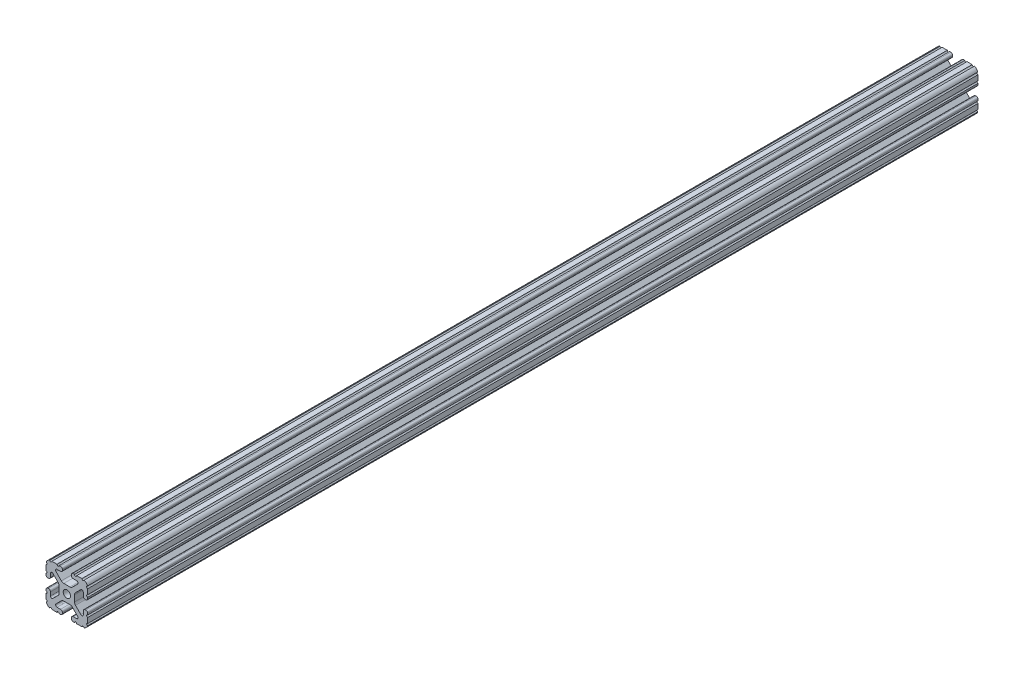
ISO-10303-21;
HEADER;
FILE_DESCRIPTION(('STEP AP214'),'2;1');
FILE_NAME('part.step','',(''),(''),'','','');
FILE_SCHEMA(('AUTOMOTIVE_DESIGN { 1 0 10303 214 1 1 1 1 }'));
ENDSEC;
DATA;
#1=APPLICATION_CONTEXT('core data for automotive mechanical design processes');
#2=APPLICATION_PROTOCOL_DEFINITION('international standard','automotive_design',2000,#1);
#3=PRODUCT_CONTEXT('',#1,'mechanical');
#4=PRODUCT('Part','Part','',(#3));
#5=PRODUCT_RELATED_PRODUCT_CATEGORY('part','',(#4));
#6=PRODUCT_DEFINITION_FORMATION('','',#4);
#7=PRODUCT_DEFINITION_CONTEXT('part definition',#1,'design');
#8=PRODUCT_DEFINITION('design','',#6,#7);
#9=PRODUCT_DEFINITION_SHAPE('','',#8);
#10=(LENGTH_UNIT() NAMED_UNIT(*) SI_UNIT(.MILLI.,.METRE.));
#11=(NAMED_UNIT(*) PLANE_ANGLE_UNIT() SI_UNIT($,.RADIAN.));
#12=(NAMED_UNIT(*) SI_UNIT($,.STERADIAN.) SOLID_ANGLE_UNIT());
#13=UNCERTAINTY_MEASURE_WITH_UNIT(LENGTH_MEASURE(1.E-05),#10,'distance_accuracy_value','');
#14=(GEOMETRIC_REPRESENTATION_CONTEXT(3) GLOBAL_UNCERTAINTY_ASSIGNED_CONTEXT((#13)) GLOBAL_UNIT_ASSIGNED_CONTEXT((#10,
#11,#12)) REPRESENTATION_CONTEXT('',''));
#15=CARTESIAN_POINT('',(0.,0.,0.));
#16=DIRECTION('',(0.,0.,1.));
#17=DIRECTION('',(1.,0.,0.));
#18=AXIS2_PLACEMENT_3D('',#15,#16,#17);
#19=CARTESIAN_POINT('',(5.7912,-19.05,457.2));
#20=DIRECTION('',(0.,1.,0.));
#21=DIRECTION('',(-1.,0.,0.));
#22=AXIS2_PLACEMENT_3D('',#19,#20,#21);
#23=PLANE('',#22);
#24=DIRECTION('',(1.,0.,0.));
#25=VECTOR('',#24,1.);
#26=CARTESIAN_POINT('',(5.7912,-19.05,355.6));
#27=LINE('',#26,#25);
#28=CARTESIAN_POINT('',(5.7912,-19.05,355.6));
#29=VERTEX_POINT('',#28);
#30=CARTESIAN_POINT('',(6.96430523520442,-19.05,355.6));
#31=VERTEX_POINT('',#30);
#32=EDGE_CURVE('E1137',#29,#31,#27,.T.);
#33=ORIENTED_EDGE('',*,*,#32,.F.);
#34=DIRECTION('',(0.,0.,-1.));
#35=VECTOR('',#34,1.);
#36=CARTESIAN_POINT('',(5.7912,-19.05,457.2));
#37=LINE('',#36,#35);
#38=CARTESIAN_POINT('',(5.7912,-19.05,-457.2));
#39=VERTEX_POINT('',#38);
#40=EDGE_CURVE('E1091',#29,#39,#37,.T.);
#41=ORIENTED_EDGE('',*,*,#40,.T.);
#42=DIRECTION('',(1.,0.,0.));
#43=VECTOR('',#42,1.);
#44=CARTESIAN_POINT('',(5.7912,-19.05,-457.2));
#45=LINE('',#44,#43);
#46=CARTESIAN_POINT('',(6.96430523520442,-19.05,-457.2));
#47=VERTEX_POINT('',#46);
#48=EDGE_CURVE('E1003',#39,#47,#45,.T.);
#49=ORIENTED_EDGE('',*,*,#48,.T.);
#50=DIRECTION('',(0.,0.,1.));
#51=VECTOR('',#50,1.);
#52=CARTESIAN_POINT('',(6.96430523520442,-19.05,-457.2));
#53=LINE('',#52,#51);
#54=EDGE_CURVE('E986',#47,#31,#53,.T.);
#55=ORIENTED_EDGE('',*,*,#54,.T.);
#56=EDGE_LOOP('',(#33,#41,#49,#55));
#57=FACE_BOUND('',#56,.T.);
#58=ADVANCED_FACE('F37',(#57),#23,.F.);
#59=CARTESIAN_POINT('',(19.05,-5.7912,457.2));
#60=DIRECTION('',(-1.,0.,0.));
#61=DIRECTION('',(0.,-1.,0.));
#62=AXIS2_PLACEMENT_3D('',#59,#60,#61);
#63=PLANE('',#62);
#64=DIRECTION('',(0.,1.,0.));
#65=VECTOR('',#64,1.);
#66=CARTESIAN_POINT('',(19.05,-5.7912,355.6));
#67=LINE('',#66,#65);
#68=CARTESIAN_POINT('',(19.05,-13.7234770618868,355.6));
#69=VERTEX_POINT('',#68);
#70=CARTESIAN_POINT('',(19.05,-8.99630523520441,355.6));
#71=VERTEX_POINT('',#70);
#72=EDGE_CURVE('E1110',#69,#71,#67,.T.);
#73=ORIENTED_EDGE('',*,*,#72,.F.);
#74=DIRECTION('',(0.,0.,1.));
#75=VECTOR('',#74,1.);
#76=CARTESIAN_POINT('',(19.05,-13.7234770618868,-457.2));
#77=LINE('',#76,#75);
#78=CARTESIAN_POINT('',(19.05,-13.7234770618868,-457.2));
#79=VERTEX_POINT('',#78);
#80=EDGE_CURVE('E989',#69,#79,#77,.F.);
#81=ORIENTED_EDGE('',*,*,#80,.T.);
#82=DIRECTION('',(0.,1.,0.));
#83=VECTOR('',#82,1.);
#84=CARTESIAN_POINT('',(19.05,-5.7912,-457.2));
#85=LINE('',#84,#83);
#86=CARTESIAN_POINT('',(19.05,-8.99630523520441,-457.2));
#87=VERTEX_POINT('',#86);
#88=EDGE_CURVE('E1012',#79,#87,#85,.T.);
#89=ORIENTED_EDGE('',*,*,#88,.T.);
#90=DIRECTION('',(0.,0.,1.));
#91=VECTOR('',#90,1.);
#92=CARTESIAN_POINT('',(19.05,-8.99630523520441,-457.2));
#93=LINE('',#92,#91);
#94=EDGE_CURVE('E996',#87,#71,#93,.T.);
#95=ORIENTED_EDGE('',*,*,#94,.T.);
#96=EDGE_LOOP('',(#73,#81,#89,#95));
#97=FACE_BOUND('',#96,.T.);
#98=ADVANCED_FACE('F1107',(#97),#63,.F.);
#99=CARTESIAN_POINT('',(5.7912,-17.3228,457.2));
#100=DIRECTION('',(0.,0.,-1.));
#101=DIRECTION('',(-1.,0.,0.));
#102=AXIS2_PLACEMENT_3D('',#99,#100,#101);
#103=CYLINDRICAL_SURFACE('',#102,1.7272);
#104=CARTESIAN_POINT('',(5.7912,-17.3228,355.6));
#105=DIRECTION('',(0.,0.,1.));
#106=DIRECTION('',(1.,0.,0.));
#107=AXIS2_PLACEMENT_3D('',#104,#105,#106);
#108=CIRCLE('',#107,1.7272);
#109=CARTESIAN_POINT('',(4.064,-17.3228,355.6));
#110=VERTEX_POINT('',#109);
#111=EDGE_CURVE('E1140',#110,#29,#108,.T.);
#112=ORIENTED_EDGE('',*,*,#111,.F.);
#113=DIRECTION('',(0.,0.,-1.));
#114=VECTOR('',#113,1.);
#115=CARTESIAN_POINT('',(4.064,-17.3228,457.2));
#116=LINE('',#115,#114);
#117=CARTESIAN_POINT('',(4.064,-17.3228,-457.2));
#118=VERTEX_POINT('',#117);
#119=EDGE_CURVE('E1061',#110,#118,#116,.T.);
#120=ORIENTED_EDGE('',*,*,#119,.T.);
#121=CARTESIAN_POINT('',(5.7912,-17.3228,-457.2));
#122=DIRECTION('',(0.,0.,1.));
#123=DIRECTION('',(1.,0.,0.));
#124=AXIS2_PLACEMENT_3D('',#121,#122,#123);
#125=CIRCLE('',#124,1.7272);
#126=EDGE_CURVE('E999',#118,#39,#125,.T.);
#127=ORIENTED_EDGE('',*,*,#126,.T.);
#128=ORIENTED_EDGE('',*,*,#40,.F.);
#129=EDGE_LOOP('',(#112,#120,#127,#128));
#130=FACE_BOUND('',#129,.T.);
#131=ADVANCED_FACE('F39',(#130),#103,.T.);
#132=DIRECTION('',(1.,0.,0.));
#133=VECTOR('',#132,1.);
#134=CARTESIAN_POINT('',(5.7912,-19.05,355.6));
#135=LINE('',#134,#133);
#136=CARTESIAN_POINT('',(8.99630523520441,-19.05,355.6));
#137=VERTEX_POINT('',#136);
#138=CARTESIAN_POINT('',(13.7234770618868,-19.05,355.6));
#139=VERTEX_POINT('',#138);
#140=EDGE_CURVE('E1128',#137,#139,#135,.T.);
#141=ORIENTED_EDGE('',*,*,#140,.F.);
#142=DIRECTION('',(0.,0.,1.));
#143=VECTOR('',#142,1.);
#144=CARTESIAN_POINT('',(8.99630523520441,-19.05,-457.2));
#145=LINE('',#144,#143);
#146=CARTESIAN_POINT('',(8.99630523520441,-19.05,-457.2));
#147=VERTEX_POINT('',#146);
#148=EDGE_CURVE('E984',#137,#147,#145,.F.);
#149=ORIENTED_EDGE('',*,*,#148,.T.);
#150=CARTESIAN_POINT('',(13.7234770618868,-19.05,-457.2));
#151=VERTEX_POINT('',#150);
#152=EDGE_CURVE('E1002',#147,#151,#45,.T.);
#153=ORIENTED_EDGE('',*,*,#152,.T.);
#154=DIRECTION('',(0.,0.,1.));
#155=VECTOR('',#154,1.);
#156=CARTESIAN_POINT('',(13.7234770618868,-19.05,-457.2));
#157=LINE('',#156,#155);
#158=EDGE_CURVE('E59',#151,#139,#157,.T.);
#159=ORIENTED_EDGE('',*,*,#158,.T.);
#160=EDGE_LOOP('',(#141,#149,#153,#159));
#161=FACE_BOUND('',#160,.T.);
#162=ADVANCED_FACE('F1125',(#161),#23,.F.);
#163=CARTESIAN_POINT('',(14.3002,-14.3002,457.2));
#164=DIRECTION('',(0.,0.,-1.));
#165=DIRECTION('',(-1.,0.,0.));
#166=AXIS2_PLACEMENT_3D('',#163,#164,#165);
#167=CYLINDRICAL_SURFACE('',#166,4.7498);
#168=CARTESIAN_POINT('',(14.3002,-14.3002,355.6));
#169=DIRECTION('',(0.,0.,1.));
#170=DIRECTION('',(1.,0.,0.));
#171=AXIS2_PLACEMENT_3D('',#168,#169,#170);
#172=CIRCLE('',#171,4.7498);
#173=CARTESIAN_POINT('',(15.7312177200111,-18.8293045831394,355.6));
#174=VERTEX_POINT('',#173);
#175=CARTESIAN_POINT('',(18.8293045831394,-15.7312177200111,355.6));
#176=VERTEX_POINT('',#175);
#177=EDGE_CURVE('E1119',#174,#176,#172,.T.);
#178=ORIENTED_EDGE('',*,*,#177,.F.);
#179=DIRECTION('',(0.,0.,1.));
#180=VECTOR('',#179,1.);
#181=CARTESIAN_POINT('',(15.7312177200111,-18.8293045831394,-1.11022302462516E-13));
#182=LINE('',#181,#180);
#183=CARTESIAN_POINT('',(15.7312177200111,-18.8293045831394,-457.2));
#184=VERTEX_POINT('',#183);
#185=EDGE_CURVE('E981',#174,#184,#182,.F.);
#186=ORIENTED_EDGE('',*,*,#185,.T.);
#187=CARTESIAN_POINT('',(14.3002,-14.3002,-457.2));
#188=DIRECTION('',(0.,0.,1.));
#189=DIRECTION('',(1.,0.,0.));
#190=AXIS2_PLACEMENT_3D('',#187,#188,#189);
#191=CIRCLE('',#190,4.7498);
#192=CARTESIAN_POINT('',(18.8293045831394,-15.7312177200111,-457.2));
#193=VERTEX_POINT('',#192);
#194=EDGE_CURVE('E1006',#184,#193,#191,.T.);
#195=ORIENTED_EDGE('',*,*,#194,.T.);
#196=DIRECTION('',(0.,0.,1.));
#197=VECTOR('',#196,1.);
#198=CARTESIAN_POINT('',(18.8293045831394,-15.7312177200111,-1.11022302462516E-13));
#199=LINE('',#198,#197);
#200=EDGE_CURVE('E991',#193,#176,#199,.T.);
#201=ORIENTED_EDGE('',*,*,#200,.T.);
#202=EDGE_LOOP('',(#178,#186,#195,#201));
#203=FACE_BOUND('',#202,.T.);
#204=ADVANCED_FACE('F1117',(#203),#167,.T.);
#205=DIRECTION('',(0.,1.,0.));
#206=VECTOR('',#205,1.);
#207=CARTESIAN_POINT('',(19.05,-5.7912,355.6));
#208=LINE('',#207,#206);
#209=CARTESIAN_POINT('',(19.05,-6.96430523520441,355.6));
#210=VERTEX_POINT('',#209);
#211=CARTESIAN_POINT('',(19.05,-5.7912,355.6));
#212=VERTEX_POINT('',#211);
#213=EDGE_CURVE('E1542',#210,#212,#208,.T.);
#214=ORIENTED_EDGE('',*,*,#213,.F.);
#215=DIRECTION('',(0.,0.,1.));
#216=VECTOR('',#215,1.);
#217=CARTESIAN_POINT('',(19.05,-6.96430523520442,-457.2));
#218=LINE('',#217,#216);
#219=CARTESIAN_POINT('',(19.05,-6.96430523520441,-457.2));
#220=VERTEX_POINT('',#219);
#221=EDGE_CURVE('E994',#210,#220,#218,.F.);
#222=ORIENTED_EDGE('',*,*,#221,.T.);
#223=CARTESIAN_POINT('',(19.05,-5.7912,-457.2));
#224=VERTEX_POINT('',#223);
#225=EDGE_CURVE('E1009',#220,#224,#85,.T.);
#226=ORIENTED_EDGE('',*,*,#225,.T.);
#227=DIRECTION('',(0.,0.,-1.));
#228=VECTOR('',#227,1.);
#229=CARTESIAN_POINT('',(19.05,-5.7912,457.2));
#230=LINE('',#229,#228);
#231=EDGE_CURVE('E1089',#212,#224,#230,.T.);
#232=ORIENTED_EDGE('',*,*,#231,.F.);
#233=EDGE_LOOP('',(#214,#222,#226,#232));
#234=FACE_BOUND('',#233,.T.);
#235=ADVANCED_FACE('F1568',(#234),#63,.F.);
#236=CARTESIAN_POINT('',(17.3228,-5.7912,457.2));
#237=DIRECTION('',(0.,0.,-1.));
#238=DIRECTION('',(-1.,0.,0.));
#239=AXIS2_PLACEMENT_3D('',#236,#237,#238);
#240=CYLINDRICAL_SURFACE('',#239,1.7272);
#241=CARTESIAN_POINT('',(17.3228,-5.7912,355.6));
#242=DIRECTION('',(0.,0.,1.));
#243=DIRECTION('',(1.,0.,0.));
#244=AXIS2_PLACEMENT_3D('',#241,#242,#243);
#245=CIRCLE('',#244,1.7272);
#246=CARTESIAN_POINT('',(17.3228,-4.064,355.6));
#247=VERTEX_POINT('',#246);
#248=EDGE_CURVE('E1540',#212,#247,#245,.T.);
#249=ORIENTED_EDGE('',*,*,#248,.F.);
#250=ORIENTED_EDGE('',*,*,#231,.T.);
#251=CARTESIAN_POINT('',(17.3228,-5.7912,-457.2));
#252=DIRECTION('',(0.,0.,1.));
#253=DIRECTION('',(-1.,0.,0.));
#254=AXIS2_PLACEMENT_3D('',#251,#252,#253);
#255=CIRCLE('',#254,1.7272);
#256=CARTESIAN_POINT('',(17.3228,-4.064,-457.2));
#257=VERTEX_POINT('',#256);
#258=EDGE_CURVE('E1013',#224,#257,#255,.T.);
#259=ORIENTED_EDGE('',*,*,#258,.T.);
#260=DIRECTION('',(0.,0.,-1.));
#261=VECTOR('',#260,1.);
#262=CARTESIAN_POINT('',(17.3228,-4.064,457.2));
#263=LINE('',#262,#261);
#264=EDGE_CURVE('E1087',#247,#257,#263,.T.);
#265=ORIENTED_EDGE('',*,*,#264,.F.);
#266=EDGE_LOOP('',(#249,#250,#259,#265));
#267=FACE_BOUND('',#266,.T.);
#268=ADVANCED_FACE('F2397',(#267),#240,.T.);
#269=CARTESIAN_POINT('',(16.7132,-4.064,457.2));
#270=DIRECTION('',(0.,-1.,0.));
#271=DIRECTION('',(1.,0.,0.));
#272=AXIS2_PLACEMENT_3D('',#269,#270,#271);
#273=PLANE('',#272);
#274=DIRECTION('',(-1.,0.,0.));
#275=VECTOR('',#274,1.);
#276=CARTESIAN_POINT('',(16.7132,-4.064,355.6));
#277=LINE('',#276,#275);
#278=CARTESIAN_POINT('',(16.7132,-4.064,355.6));
#279=VERTEX_POINT('',#278);
#280=EDGE_CURVE('E1538',#247,#279,#277,.T.);
#281=ORIENTED_EDGE('',*,*,#280,.F.);
#282=ORIENTED_EDGE('',*,*,#264,.T.);
#283=DIRECTION('',(-1.,0.,0.));
#284=VECTOR('',#283,1.);
#285=CARTESIAN_POINT('',(16.7132,-4.064,-457.2));
#286=LINE('',#285,#284);
#287=CARTESIAN_POINT('',(16.7132,-4.064,-457.2));
#288=VERTEX_POINT('',#287);
#289=EDGE_CURVE('E1016',#257,#288,#286,.T.);
#290=ORIENTED_EDGE('',*,*,#289,.T.);
#291=DIRECTION('',(0.,0.,-1.));
#292=VECTOR('',#291,1.);
#293=CARTESIAN_POINT('',(16.7132,-4.064,457.2));
#294=LINE('',#293,#292);
#295=EDGE_CURVE('E1085',#279,#288,#294,.T.);
#296=ORIENTED_EDGE('',*,*,#295,.F.);
#297=EDGE_LOOP('',(#281,#282,#290,#296));
#298=FACE_BOUND('',#297,.T.);
#299=ADVANCED_FACE('F2387',(#298),#273,.F.);
#300=CARTESIAN_POINT('',(16.7132,-5.7912,457.2));
#301=DIRECTION('',(0.,0.,-1.));
#302=DIRECTION('',(-1.,0.,0.));
#303=AXIS2_PLACEMENT_3D('',#300,#301,#302);
#304=CYLINDRICAL_SURFACE('',#303,1.7272);
#305=CARTESIAN_POINT('',(16.7132,-5.7912,355.6));
#306=DIRECTION('',(0.,0.,1.));
#307=DIRECTION('',(1.,0.,0.));
#308=AXIS2_PLACEMENT_3D('',#305,#306,#307);
#309=CIRCLE('',#308,1.7272);
#310=CARTESIAN_POINT('',(14.986,-5.7912,355.6));
#311=VERTEX_POINT('',#310);
#312=EDGE_CURVE('E1536',#279,#311,#309,.T.);
#313=ORIENTED_EDGE('',*,*,#312,.F.);
#314=ORIENTED_EDGE('',*,*,#295,.T.);
#315=CARTESIAN_POINT('',(16.7132,-5.7912,-457.2));
#316=DIRECTION('',(0.,0.,1.));
#317=DIRECTION('',(-1.,0.,0.));
#318=AXIS2_PLACEMENT_3D('',#315,#316,#317);
#319=CIRCLE('',#318,1.7272);
#320=CARTESIAN_POINT('',(14.986,-5.7912,-457.2));
#321=VERTEX_POINT('',#320);
#322=EDGE_CURVE('E1019',#288,#321,#319,.T.);
#323=ORIENTED_EDGE('',*,*,#322,.T.);
#324=DIRECTION('',(0.,0.,-1.));
#325=VECTOR('',#324,1.);
#326=CARTESIAN_POINT('',(14.986,-5.7912,457.2));
#327=LINE('',#326,#325);
#328=EDGE_CURVE('E1083',#311,#321,#327,.T.);
#329=ORIENTED_EDGE('',*,*,#328,.F.);
#330=EDGE_LOOP('',(#313,#314,#323,#329));
#331=FACE_BOUND('',#330,.T.);
#332=ADVANCED_FACE('F2377',(#331),#304,.T.);
#333=CARTESIAN_POINT('',(14.986,-8.99630523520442,457.2));
#334=DIRECTION('',(1.,0.,0.));
#335=DIRECTION('',(0.,0.,-1.));
#336=AXIS2_PLACEMENT_3D('',#333,#334,#335);
#337=PLANE('',#336);
#338=DIRECTION('',(0.,-1.,0.));
#339=VECTOR('',#338,1.);
#340=CARTESIAN_POINT('',(14.986,-8.99630523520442,355.6));
#341=LINE('',#340,#339);
#342=CARTESIAN_POINT('',(14.986,-8.99630523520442,355.6));
#343=VERTEX_POINT('',#342);
#344=EDGE_CURVE('E1534',#311,#343,#341,.T.);
#345=ORIENTED_EDGE('',*,*,#344,.F.);
#346=ORIENTED_EDGE('',*,*,#328,.T.);
#347=DIRECTION('',(0.,-1.,0.));
#348=VECTOR('',#347,1.);
#349=CARTESIAN_POINT('',(14.986,-8.99630523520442,-457.2));
#350=LINE('',#349,#348);
#351=CARTESIAN_POINT('',(14.986,-8.99630523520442,-457.2));
#352=VERTEX_POINT('',#351);
#353=EDGE_CURVE('E1022',#321,#352,#350,.T.);
#354=ORIENTED_EDGE('',*,*,#353,.T.);
#355=DIRECTION('',(0.,0.,-1.));
#356=VECTOR('',#355,1.);
#357=CARTESIAN_POINT('',(14.986,-8.99630523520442,457.2));
#358=LINE('',#357,#356);
#359=EDGE_CURVE('E1081',#343,#352,#358,.T.);
#360=ORIENTED_EDGE('',*,*,#359,.F.);
#361=EDGE_LOOP('',(#345,#346,#354,#360));
#362=FACE_BOUND('',#361,.T.);
#363=ADVANCED_FACE('F2367',(#362),#337,.F.);
#364=CARTESIAN_POINT('',(13.6953052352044,-8.99630523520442,457.2));
#365=DIRECTION('',(0.,0.,-1.));
#366=DIRECTION('',(-1.,0.,0.));
#367=AXIS2_PLACEMENT_3D('',#364,#365,#366);
#368=CYLINDRICAL_SURFACE('',#367,1.29069476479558);
#369=CARTESIAN_POINT('',(13.6953052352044,-8.99630523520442,355.6));
#370=DIRECTION('',(0.,0.,1.));
#371=DIRECTION('',(1.,0.,0.));
#372=AXIS2_PLACEMENT_3D('',#369,#370,#371);
#373=CIRCLE('',#372,1.29069476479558);
#374=CARTESIAN_POINT('',(12.7826462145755,-9.90896425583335,355.6));
#375=VERTEX_POINT('',#374);
#376=EDGE_CURVE('E1532',#343,#375,#373,.F.);
#377=ORIENTED_EDGE('',*,*,#376,.F.);
#378=ORIENTED_EDGE('',*,*,#359,.T.);
#379=CARTESIAN_POINT('',(13.6953052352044,-8.99630523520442,-457.2));
#380=DIRECTION('',(0.,0.,-1.));
#381=DIRECTION('',(1.,0.,0.));
#382=AXIS2_PLACEMENT_3D('',#379,#380,#381);
#383=CIRCLE('',#382,1.29069476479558);
#384=CARTESIAN_POINT('',(12.7826462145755,-9.90896425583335,-457.2));
#385=VERTEX_POINT('',#384);
#386=EDGE_CURVE('E1025',#352,#385,#383,.T.);
#387=ORIENTED_EDGE('',*,*,#386,.T.);
#388=DIRECTION('',(0.,0.,-1.));
#389=VECTOR('',#388,1.);
#390=CARTESIAN_POINT('',(12.7826462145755,-9.90896425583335,457.2));
#391=LINE('',#390,#389);
#392=EDGE_CURVE('E1079',#375,#385,#391,.T.);
#393=ORIENTED_EDGE('',*,*,#392,.F.);
#394=EDGE_LOOP('',(#377,#378,#387,#393));
#395=FACE_BOUND('',#394,.T.);
#396=ADVANCED_FACE('F2357',(#395),#368,.F.);
#397=CARTESIAN_POINT('',(12.7826462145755,-9.90896425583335,457.2));
#398=DIRECTION('',(-0.707106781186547,-0.707106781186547,0.));
#399=DIRECTION('',(0.707106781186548,-0.707106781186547,0.));
#400=AXIS2_PLACEMENT_3D('',#397,#398,#399);
#401=PLANE('',#400);
#402=DIRECTION('',(-0.707106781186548,0.707106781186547,0.));
#403=VECTOR('',#402,1.);
#404=CARTESIAN_POINT('',(12.7826462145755,-9.90896425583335,355.6));
#405=LINE('',#404,#403);
#406=CARTESIAN_POINT('',(7.8888977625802,-5.01521580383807,355.6));
#407=VERTEX_POINT('',#406);
#408=EDGE_CURVE('E1530',#375,#407,#405,.T.);
#409=ORIENTED_EDGE('',*,*,#408,.F.);
#410=ORIENTED_EDGE('',*,*,#392,.T.);
#411=DIRECTION('',(-0.707106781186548,0.707106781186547,0.));
#412=VECTOR('',#411,1.);
#413=CARTESIAN_POINT('',(12.7826462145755,-9.90896425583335,-457.2));
#414=LINE('',#413,#412);
#415=CARTESIAN_POINT('',(7.8888977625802,-5.01521580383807,-457.2));
#416=VERTEX_POINT('',#415);
#417=EDGE_CURVE('E1028',#385,#416,#414,.T.);
#418=ORIENTED_EDGE('',*,*,#417,.T.);
#419=DIRECTION('',(0.,0.,-1.));
#420=VECTOR('',#419,1.);
#421=CARTESIAN_POINT('',(7.8888977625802,-5.01521580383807,457.2));
#422=LINE('',#421,#420);
#423=EDGE_CURVE('E1077',#407,#416,#422,.T.);
#424=ORIENTED_EDGE('',*,*,#423,.F.);
#425=EDGE_LOOP('',(#409,#410,#418,#424));
#426=FACE_BOUND('',#425,.T.);
#427=ADVANCED_FACE('F2347',(#426),#401,.F.);
#428=CARTESIAN_POINT('',(10.0711,-2.83301356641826,457.2));
#429=DIRECTION('',(0.,0.,-1.));
#430=DIRECTION('',(-1.,0.,0.));
#431=AXIS2_PLACEMENT_3D('',#428,#429,#430);
#432=CYLINDRICAL_SURFACE('',#431,3.0861);
#433=CARTESIAN_POINT('',(10.0711,-2.83301356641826,355.6));
#434=DIRECTION('',(0.,0.,1.));
#435=DIRECTION('',(1.,0.,0.));
#436=AXIS2_PLACEMENT_3D('',#433,#434,#435);
#437=CIRCLE('',#436,3.0861);
#438=CARTESIAN_POINT('',(6.985,-2.83301356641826,355.6));
#439=VERTEX_POINT('',#438);
#440=EDGE_CURVE('E1528',#407,#439,#437,.F.);
#441=ORIENTED_EDGE('',*,*,#440,.F.);
#442=ORIENTED_EDGE('',*,*,#423,.T.);
#443=CARTESIAN_POINT('',(10.0711,-2.83301356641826,-457.2));
#444=DIRECTION('',(0.,0.,-1.));
#445=DIRECTION('',(-1.,0.,0.));
#446=AXIS2_PLACEMENT_3D('',#443,#444,#445);
#447=CIRCLE('',#446,3.0861);
#448=CARTESIAN_POINT('',(6.985,-2.83301356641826,-457.2));
#449=VERTEX_POINT('',#448);
#450=EDGE_CURVE('E1031',#416,#449,#447,.T.);
#451=ORIENTED_EDGE('',*,*,#450,.T.);
#452=DIRECTION('',(0.,0.,-1.));
#453=VECTOR('',#452,1.);
#454=CARTESIAN_POINT('',(6.985,-2.83301356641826,457.2));
#455=LINE('',#454,#453);
#456=EDGE_CURVE('E1075',#439,#449,#455,.T.);
#457=ORIENTED_EDGE('',*,*,#456,.F.);
#458=EDGE_LOOP('',(#441,#442,#451,#457));
#459=FACE_BOUND('',#458,.T.);
#460=ADVANCED_FACE('F1560',(#459),#432,.F.);
#461=CARTESIAN_POINT('',(6.985,0.,457.2));
#462=DIRECTION('',(-1.,0.,0.));
#463=DIRECTION('',(0.,0.,1.));
#464=AXIS2_PLACEMENT_3D('',#461,#462,#463);
#465=PLANE('',#464);
#466=DIRECTION('',(0.,1.,0.));
#467=VECTOR('',#466,1.);
#468=CARTESIAN_POINT('',(6.985,0.,355.6));
#469=LINE('',#468,#467);
#470=CARTESIAN_POINT('',(6.985,2.83301356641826,355.6));
#471=VERTEX_POINT('',#470);
#472=EDGE_CURVE('E1526',#439,#471,#469,.T.);
#473=ORIENTED_EDGE('',*,*,#472,.F.);
#474=ORIENTED_EDGE('',*,*,#456,.T.);
#475=DIRECTION('',(0.,1.,0.));
#476=VECTOR('',#475,1.);
#477=CARTESIAN_POINT('',(6.985,0.,-457.2));
#478=LINE('',#477,#476);
#479=CARTESIAN_POINT('',(6.985,2.83301356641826,-457.2));
#480=VERTEX_POINT('',#479);
#481=EDGE_CURVE('E1034',#449,#480,#478,.T.);
#482=ORIENTED_EDGE('',*,*,#481,.T.);
#483=DIRECTION('',(0.,0.,-1.));
#484=VECTOR('',#483,1.);
#485=CARTESIAN_POINT('',(6.985,2.83301356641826,457.2));
#486=LINE('',#485,#484);
#487=EDGE_CURVE('E838',#471,#480,#486,.T.);
#488=ORIENTED_EDGE('',*,*,#487,.F.);
#489=EDGE_LOOP('',(#473,#474,#482,#488));
#490=FACE_BOUND('',#489,.T.);
#491=ADVANCED_FACE('F1552',(#490),#465,.F.);
#492=CARTESIAN_POINT('',(0.,0.,457.2));
#493=DIRECTION('',(0.,0.,-1.));
#494=DIRECTION('',(-1.,0.,0.));
#495=AXIS2_PLACEMENT_3D('',#492,#493,#494);
#496=CYLINDRICAL_SURFACE('',#495,3.32740000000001);
#497=CARTESIAN_POINT('',(0.,0.,-457.2));
#498=DIRECTION('',(0.,0.,-1.));
#499=DIRECTION('',(1.,0.,0.));
#500=AXIS2_PLACEMENT_3D('',#497,#498,#499);
#501=CIRCLE('',#500,3.32740000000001);
#502=CARTESIAN_POINT('',(-3.32740000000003,0.,-457.2));
#503=VERTEX_POINT('',#502);
#504=EDGE_CURVE('E1037',#503,#503,#501,.T.);
#505=CARTESIAN_POINT('',(0.,0.,355.6));
#506=DIRECTION('',(0.,0.,1.));
#507=DIRECTION('',(1.,0.,0.));
#508=AXIS2_PLACEMENT_3D('',#505,#506,#507);
#509=CIRCLE('',#508,3.32740000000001);
#510=CARTESIAN_POINT('',(-3.32740000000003,0.,355.6));
#511=VERTEX_POINT('',#510);
#512=EDGE_CURVE('E1377',#511,#511,#509,.F.);
#513=CARTESIAN_POINT('',(-3.32740000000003,0.,-457.2));
#514=CARTESIAN_POINT('',(-3.32740000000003,0.,-448.733333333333));
#515=CARTESIAN_POINT('',(-3.32740000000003,0.,-440.266666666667));
#516=CARTESIAN_POINT('',(-3.32740000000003,0.,-423.333333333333));
#517=CARTESIAN_POINT('',(-3.32740000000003,0.,-414.866666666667));
#518=CARTESIAN_POINT('',(-3.32740000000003,0.,-397.933333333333));
#519=CARTESIAN_POINT('',(-3.32740000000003,0.,-389.466666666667));
#520=CARTESIAN_POINT('',(-3.32740000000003,0.,-372.533333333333));
#521=CARTESIAN_POINT('',(-3.32740000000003,0.,-364.066666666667));
#522=CARTESIAN_POINT('',(-3.32740000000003,0.,-347.133333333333));
#523=CARTESIAN_POINT('',(-3.32740000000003,0.,-338.666666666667));
#524=CARTESIAN_POINT('',(-3.32740000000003,0.,-321.733333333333));
#525=CARTESIAN_POINT('',(-3.32740000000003,0.,-313.266666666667));
#526=CARTESIAN_POINT('',(-3.32740000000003,0.,-296.333333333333));
#527=CARTESIAN_POINT('',(-3.32740000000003,0.,-287.866666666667));
#528=CARTESIAN_POINT('',(-3.32740000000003,0.,-270.933333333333));
#529=CARTESIAN_POINT('',(-3.32740000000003,0.,-262.466666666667));
#530=CARTESIAN_POINT('',(-3.32740000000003,0.,-245.533333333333));
#531=CARTESIAN_POINT('',(-3.32740000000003,0.,-237.066666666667));
#532=CARTESIAN_POINT('',(-3.32740000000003,0.,-220.133333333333));
#533=CARTESIAN_POINT('',(-3.32740000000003,0.,-211.666666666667));
#534=CARTESIAN_POINT('',(-3.32740000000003,0.,-194.733333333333));
#535=CARTESIAN_POINT('',(-3.32740000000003,0.,-186.266666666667));
#536=CARTESIAN_POINT('',(-3.32740000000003,0.,-169.333333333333));
#537=CARTESIAN_POINT('',(-3.32740000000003,0.,-160.866666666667));
#538=CARTESIAN_POINT('',(-3.32740000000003,0.,-143.933333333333));
#539=CARTESIAN_POINT('',(-3.32740000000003,0.,-135.466666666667));
#540=CARTESIAN_POINT('',(-3.32740000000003,0.,-118.533333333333));
#541=CARTESIAN_POINT('',(-3.32740000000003,0.,-110.066666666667));
#542=CARTESIAN_POINT('',(-3.32740000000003,0.,-93.1333333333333));
#543=CARTESIAN_POINT('',(-3.32740000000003,0.,-84.6666666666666));
#544=CARTESIAN_POINT('',(-3.32740000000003,0.,-67.7333333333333));
#545=CARTESIAN_POINT('',(-3.32740000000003,0.,-59.2666666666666));
#546=CARTESIAN_POINT('',(-3.32740000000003,0.,-42.3333333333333));
#547=CARTESIAN_POINT('',(-3.32740000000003,0.,-33.8666666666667));
#548=CARTESIAN_POINT('',(-3.32740000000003,0.,-16.9333333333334));
#549=CARTESIAN_POINT('',(-3.32740000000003,0.,-8.46666666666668));
#550=CARTESIAN_POINT('',(-3.32740000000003,0.,8.46666666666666));
#551=CARTESIAN_POINT('',(-3.32740000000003,0.,16.9333333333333));
#552=CARTESIAN_POINT('',(-3.32740000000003,0.,33.8666666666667));
#553=CARTESIAN_POINT('',(-3.32740000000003,0.,42.3333333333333));
#554=CARTESIAN_POINT('',(-3.32740000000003,0.,59.2666666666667));
#555=CARTESIAN_POINT('',(-3.32740000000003,0.,67.7333333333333));
#556=CARTESIAN_POINT('',(-3.32740000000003,0.,84.6666666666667));
#557=CARTESIAN_POINT('',(-3.32740000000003,0.,93.1333333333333));
#558=CARTESIAN_POINT('',(-3.32740000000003,0.,110.066666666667));
#559=CARTESIAN_POINT('',(-3.32740000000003,0.,118.533333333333));
#560=CARTESIAN_POINT('',(-3.32740000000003,0.,135.466666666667));
#561=CARTESIAN_POINT('',(-3.32740000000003,0.,143.933333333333));
#562=CARTESIAN_POINT('',(-3.32740000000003,0.,160.866666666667));
#563=CARTESIAN_POINT('',(-3.32740000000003,0.,169.333333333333));
#564=CARTESIAN_POINT('',(-3.32740000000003,0.,186.266666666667));
#565=CARTESIAN_POINT('',(-3.32740000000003,0.,194.733333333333));
#566=CARTESIAN_POINT('',(-3.32740000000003,0.,211.666666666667));
#567=CARTESIAN_POINT('',(-3.32740000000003,0.,220.133333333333));
#568=CARTESIAN_POINT('',(-3.32740000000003,0.,237.066666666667));
#569=CARTESIAN_POINT('',(-3.32740000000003,0.,245.533333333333));
#570=CARTESIAN_POINT('',(-3.32740000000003,0.,262.466666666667));
#571=CARTESIAN_POINT('',(-3.32740000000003,0.,270.933333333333));
#572=CARTESIAN_POINT('',(-3.32740000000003,0.,287.866666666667));
#573=CARTESIAN_POINT('',(-3.32740000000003,0.,296.333333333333));
#574=CARTESIAN_POINT('',(-3.32740000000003,0.,313.266666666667));
#575=CARTESIAN_POINT('',(-3.32740000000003,0.,321.733333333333));
#576=CARTESIAN_POINT('',(-3.32740000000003,0.,338.666666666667));
#577=CARTESIAN_POINT('',(-3.32740000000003,0.,347.133333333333));
#578=CARTESIAN_POINT('',(-3.32740000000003,0.,355.6));
#579=B_SPLINE_CURVE_WITH_KNOTS('',3,(#513,#514,#515,#516,#517,#518,#519,#520,#521,#522,#523,
#524,#525,#526,#527,#528,#529,#530,#531,#532,#533,#534,#535,#536,#537,#538,#539,#540,#541,#542,
#543,#544,#545,#546,#547,#548,#549,#550,#551,#552,#553,#554,#555,#556,#557,#558,#559,#560,#561,
#562,#563,#564,#565,#566,#567,#568,#569,#570,#571,#572,#573,#574,#575,#576,#577,#578),
.UNSPECIFIED.,.F.,.F.,(4,2,2,2,2,2,2,2,2,2,2,2,2,2,2,2,2,2,2,2,2,2,2,2,2,2,2,2,2,2,2,2,4),(0.,
25.4,50.8,76.2,101.6,127.,152.4,177.8,203.2,228.6,254.,279.4,304.8,330.2,355.6,381.,406.4,431.8,
457.2,482.6,508.,533.4,558.8,584.2,609.6,635.,660.4,685.8,711.2,736.6,762.,787.4,812.8),.UNSPECIFIED.);
#580=EDGE_CURVE('BSEAM1549',#503,#511,#579,.T.);
#581=ORIENTED_EDGE('',*,*,#504,.T.);
#582=ORIENTED_EDGE('',*,*,#512,.F.);
#583=ORIENTED_EDGE('',*,*,#580,.T.);
#584=ORIENTED_EDGE('',*,*,#580,.F.);
#585=EDGE_LOOP('',(#581,#583,#582,#584));
#586=FACE_BOUND('',#585,.T.);
#587=ADVANCED_FACE('F1549',(#586),#496,.F.);
#588=CARTESIAN_POINT('',(0.,-6.985,457.2));
#589=DIRECTION('',(0.,1.,0.));
#590=DIRECTION('',(0.,0.,1.));
#591=AXIS2_PLACEMENT_3D('',#588,#589,#590);
#592=PLANE('',#591);
#593=DIRECTION('',(1.,0.,0.));
#594=VECTOR('',#593,1.);
#595=CARTESIAN_POINT('',(0.,-6.985,355.6));
#596=LINE('',#595,#594);
#597=CARTESIAN_POINT('',(-2.83301356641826,-6.985,355.6));
#598=VERTEX_POINT('',#597);
#599=CARTESIAN_POINT('',(2.83301356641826,-6.985,355.6));
#600=VERTEX_POINT('',#599);
#601=EDGE_CURVE('E1484',#598,#600,#596,.T.);
#602=ORIENTED_EDGE('',*,*,#601,.F.);
#603=DIRECTION('',(0.,0.,-1.));
#604=VECTOR('',#603,1.);
#605=CARTESIAN_POINT('',(-2.83301356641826,-6.985,457.2));
#606=LINE('',#605,#604);
#607=CARTESIAN_POINT('',(-2.83301356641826,-6.985,-457.2));
#608=VERTEX_POINT('',#607);
#609=EDGE_CURVE('E952',#598,#608,#606,.T.);
#610=ORIENTED_EDGE('',*,*,#609,.T.);
#611=DIRECTION('',(1.,0.,0.));
#612=VECTOR('',#611,1.);
#613=CARTESIAN_POINT('',(0.,-6.985,-457.2));
#614=LINE('',#613,#612);
#615=CARTESIAN_POINT('',(2.83301356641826,-6.985,-457.2));
#616=VERTEX_POINT('',#615);
#617=EDGE_CURVE('E1040',#608,#616,#614,.T.);
#618=ORIENTED_EDGE('',*,*,#617,.T.);
#619=DIRECTION('',(0.,0.,-1.));
#620=VECTOR('',#619,1.);
#621=CARTESIAN_POINT('',(2.83301356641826,-6.985,457.2));
#622=LINE('',#621,#620);
#623=EDGE_CURVE('E1073',#600,#616,#622,.T.);
#624=ORIENTED_EDGE('',*,*,#623,.F.);
#625=EDGE_LOOP('',(#602,#610,#618,#624));
#626=FACE_BOUND('',#625,.T.);
#627=ADVANCED_FACE('F1551',(#626),#592,.F.);
#628=CARTESIAN_POINT('',(2.83301356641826,-10.0711,457.2));
#629=DIRECTION('',(0.,0.,-1.));
#630=DIRECTION('',(-1.,0.,0.));
#631=AXIS2_PLACEMENT_3D('',#628,#629,#630);
#632=CYLINDRICAL_SURFACE('',#631,3.0861);
#633=CARTESIAN_POINT('',(2.83301356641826,-10.0711,355.6));
#634=DIRECTION('',(0.,0.,1.));
#635=DIRECTION('',(1.,0.,0.));
#636=AXIS2_PLACEMENT_3D('',#633,#634,#635);
#637=CIRCLE('',#636,3.0861);
#638=CARTESIAN_POINT('',(5.01521580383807,-7.8888977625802,355.6));
#639=VERTEX_POINT('',#638);
#640=EDGE_CURVE('E1490',#600,#639,#637,.F.);
#641=ORIENTED_EDGE('',*,*,#640,.F.);
#642=ORIENTED_EDGE('',*,*,#623,.T.);
#643=CARTESIAN_POINT('',(2.83301356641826,-10.0711,-457.2));
#644=DIRECTION('',(0.,0.,-1.));
#645=DIRECTION('',(-1.,0.,0.));
#646=AXIS2_PLACEMENT_3D('',#643,#644,#645);
#647=CIRCLE('',#646,3.0861);
#648=CARTESIAN_POINT('',(5.01521580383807,-7.8888977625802,-457.2));
#649=VERTEX_POINT('',#648);
#650=EDGE_CURVE('E1043',#616,#649,#647,.T.);
#651=ORIENTED_EDGE('',*,*,#650,.T.);
#652=DIRECTION('',(0.,0.,-1.));
#653=VECTOR('',#652,1.);
#654=CARTESIAN_POINT('',(5.01521580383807,-7.8888977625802,457.2));
#655=LINE('',#654,#653);
#656=EDGE_CURVE('E1071',#639,#649,#655,.T.);
#657=ORIENTED_EDGE('',*,*,#656,.F.);
#658=EDGE_LOOP('',(#641,#642,#651,#657));
#659=FACE_BOUND('',#658,.T.);
#660=ADVANCED_FACE('F1174',(#659),#632,.F.);
#661=CARTESIAN_POINT('',(5.01521580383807,-7.8888977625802,457.2));
#662=DIRECTION('',(0.707106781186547,0.707106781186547,0.));
#663=DIRECTION('',(-0.707106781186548,0.707106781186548,0.));
#664=AXIS2_PLACEMENT_3D('',#661,#662,#663);
#665=PLANE('',#664);
#666=DIRECTION('',(0.707106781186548,-0.707106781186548,0.));
#667=VECTOR('',#666,1.);
#668=CARTESIAN_POINT('',(5.01521580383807,-7.8888977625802,355.6));
#669=LINE('',#668,#667);
#670=CARTESIAN_POINT('',(9.90896425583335,-12.7826462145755,355.6));
#671=VERTEX_POINT('',#670);
#672=EDGE_CURVE('E1171',#639,#671,#669,.T.);
#673=ORIENTED_EDGE('',*,*,#672,.F.);
#674=ORIENTED_EDGE('',*,*,#656,.T.);
#675=DIRECTION('',(0.707106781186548,-0.707106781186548,0.));
#676=VECTOR('',#675,1.);
#677=CARTESIAN_POINT('',(5.01521580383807,-7.8888977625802,-457.2));
#678=LINE('',#677,#676);
#679=CARTESIAN_POINT('',(9.90896425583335,-12.7826462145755,-457.2));
#680=VERTEX_POINT('',#679);
#681=EDGE_CURVE('E1046',#649,#680,#678,.T.);
#682=ORIENTED_EDGE('',*,*,#681,.T.);
#683=DIRECTION('',(0.,0.,-1.));
#684=VECTOR('',#683,1.);
#685=CARTESIAN_POINT('',(9.90896425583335,-12.7826462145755,457.2));
#686=LINE('',#685,#684);
#687=EDGE_CURVE('E1069',#671,#680,#686,.T.);
#688=ORIENTED_EDGE('',*,*,#687,.F.);
#689=EDGE_LOOP('',(#673,#674,#682,#688));
#690=FACE_BOUND('',#689,.T.);
#691=ADVANCED_FACE('F1169',(#690),#665,.F.);
#692=CARTESIAN_POINT('',(8.99630523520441,-13.6953052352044,457.2));
#693=DIRECTION('',(0.,0.,-1.));
#694=DIRECTION('',(-1.,0.,0.));
#695=AXIS2_PLACEMENT_3D('',#692,#693,#694);
#696=CYLINDRICAL_SURFACE('',#695,1.29069476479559);
#697=CARTESIAN_POINT('',(8.99630523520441,-13.6953052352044,355.6));
#698=DIRECTION('',(0.,0.,1.));
#699=DIRECTION('',(1.,0.,0.));
#700=AXIS2_PLACEMENT_3D('',#697,#698,#699);
#701=CIRCLE('',#700,1.29069476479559);
#702=CARTESIAN_POINT('',(8.99630523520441,-14.986,355.6));
#703=VERTEX_POINT('',#702);
#704=EDGE_CURVE('E1166',#671,#703,#701,.F.);
#705=ORIENTED_EDGE('',*,*,#704,.F.);
#706=ORIENTED_EDGE('',*,*,#687,.T.);
#707=CARTESIAN_POINT('',(8.99630523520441,-13.6953052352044,-457.2));
#708=DIRECTION('',(0.,0.,-1.));
#709=DIRECTION('',(1.,0.,0.));
#710=AXIS2_PLACEMENT_3D('',#707,#708,#709);
#711=CIRCLE('',#710,1.29069476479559);
#712=CARTESIAN_POINT('',(8.99630523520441,-14.986,-457.2));
#713=VERTEX_POINT('',#712);
#714=EDGE_CURVE('E1049',#680,#713,#711,.T.);
#715=ORIENTED_EDGE('',*,*,#714,.T.);
#716=DIRECTION('',(0.,0.,-1.));
#717=VECTOR('',#716,1.);
#718=CARTESIAN_POINT('',(8.99630523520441,-14.986,457.2));
#719=LINE('',#718,#717);
#720=EDGE_CURVE('E1067',#703,#713,#719,.T.);
#721=ORIENTED_EDGE('',*,*,#720,.F.);
#722=EDGE_LOOP('',(#705,#706,#715,#721));
#723=FACE_BOUND('',#722,.T.);
#724=ADVANCED_FACE('F1164',(#723),#696,.F.);
#725=CARTESIAN_POINT('',(5.7912,-14.986,457.2));
#726=DIRECTION('',(0.,-1.,0.));
#727=DIRECTION('',(1.,0.,0.));
#728=AXIS2_PLACEMENT_3D('',#725,#726,#727);
#729=PLANE('',#728);
#730=DIRECTION('',(-1.,0.,0.));
#731=VECTOR('',#730,1.);
#732=CARTESIAN_POINT('',(5.7912,-14.986,355.6));
#733=LINE('',#732,#731);
#734=CARTESIAN_POINT('',(5.7912,-14.986,355.6));
#735=VERTEX_POINT('',#734);
#736=EDGE_CURVE('E1502',#703,#735,#733,.T.);
#737=ORIENTED_EDGE('',*,*,#736,.F.);
#738=ORIENTED_EDGE('',*,*,#720,.T.);
#739=DIRECTION('',(-1.,0.,0.));
#740=VECTOR('',#739,1.);
#741=CARTESIAN_POINT('',(5.7912,-14.986,-457.2));
#742=LINE('',#741,#740);
#743=CARTESIAN_POINT('',(5.7912,-14.986,-457.2));
#744=VERTEX_POINT('',#743);
#745=EDGE_CURVE('E1052',#713,#744,#742,.T.);
#746=ORIENTED_EDGE('',*,*,#745,.T.);
#747=DIRECTION('',(0.,0.,-1.));
#748=VECTOR('',#747,1.);
#749=CARTESIAN_POINT('',(5.7912,-14.986,457.2));
#750=LINE('',#749,#748);
#751=EDGE_CURVE('E1065',#735,#744,#750,.T.);
#752=ORIENTED_EDGE('',*,*,#751,.F.);
#753=EDGE_LOOP('',(#737,#738,#746,#752));
#754=FACE_BOUND('',#753,.T.);
#755=ADVANCED_FACE('F1157',(#754),#729,.F.);
#756=CARTESIAN_POINT('',(5.7912,-16.7132,457.2));
#757=DIRECTION('',(0.,0.,-1.));
#758=DIRECTION('',(-1.,0.,0.));
#759=AXIS2_PLACEMENT_3D('',#756,#757,#758);
#760=CYLINDRICAL_SURFACE('',#759,1.7272);
#761=CARTESIAN_POINT('',(5.7912,-16.7132,355.6));
#762=DIRECTION('',(0.,0.,1.));
#763=DIRECTION('',(1.,0.,0.));
#764=AXIS2_PLACEMENT_3D('',#761,#762,#763);
#765=CIRCLE('',#764,1.7272);
#766=CARTESIAN_POINT('',(4.064,-16.7132,355.6));
#767=VERTEX_POINT('',#766);
#768=EDGE_CURVE('E1154',#735,#767,#765,.T.);
#769=ORIENTED_EDGE('',*,*,#768,.F.);
#770=ORIENTED_EDGE('',*,*,#751,.T.);
#771=CARTESIAN_POINT('',(5.7912,-16.7132,-457.2));
#772=DIRECTION('',(0.,0.,1.));
#773=DIRECTION('',(-1.,0.,0.));
#774=AXIS2_PLACEMENT_3D('',#771,#772,#773);
#775=CIRCLE('',#774,1.7272);
#776=CARTESIAN_POINT('',(4.064,-16.7132,-457.2));
#777=VERTEX_POINT('',#776);
#778=EDGE_CURVE('E1055',#744,#777,#775,.T.);
#779=ORIENTED_EDGE('',*,*,#778,.T.);
#780=DIRECTION('',(0.,0.,-1.));
#781=VECTOR('',#780,1.);
#782=CARTESIAN_POINT('',(4.064,-16.7132,457.2));
#783=LINE('',#782,#781);
#784=EDGE_CURVE('E1063',#767,#777,#783,.T.);
#785=ORIENTED_EDGE('',*,*,#784,.F.);
#786=EDGE_LOOP('',(#769,#770,#779,#785));
#787=FACE_BOUND('',#786,.T.);
#788=ADVANCED_FACE('F1152',(#787),#760,.T.);
#789=CARTESIAN_POINT('',(4.064,-16.7132,457.2));
#790=DIRECTION('',(1.,0.,0.));
#791=DIRECTION('',(0.,0.,-1.));
#792=AXIS2_PLACEMENT_3D('',#789,#790,#791);
#793=PLANE('',#792);
#794=DIRECTION('',(0.,-1.,0.));
#795=VECTOR('',#794,1.);
#796=CARTESIAN_POINT('',(4.064,-16.7132,355.6));
#797=LINE('',#796,#795);
#798=EDGE_CURVE('E1149',#767,#110,#797,.T.);
#799=ORIENTED_EDGE('',*,*,#798,.F.);
#800=ORIENTED_EDGE('',*,*,#784,.T.);
#801=DIRECTION('',(0.,-1.,0.));
#802=VECTOR('',#801,1.);
#803=CARTESIAN_POINT('',(4.064,-16.7132,-457.2));
#804=LINE('',#803,#802);
#805=EDGE_CURVE('E1058',#777,#118,#804,.T.);
#806=ORIENTED_EDGE('',*,*,#805,.T.);
#807=ORIENTED_EDGE('',*,*,#119,.F.);
#808=EDGE_LOOP('',(#799,#800,#806,#807));
#809=FACE_BOUND('',#808,.T.);
#810=ADVANCED_FACE('F1147',(#809),#793,.F.);
#811=CARTESIAN_POINT('',(14.7394770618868,-19.05,-457.2));
#812=DIRECTION('',(0.,0.,1.));
#813=DIRECTION('',(1.,0.,0.));
#814=AXIS2_PLACEMENT_3D('',#811,#812,#813);
#815=CYLINDRICAL_SURFACE('',#814,1.016);
#816=CARTESIAN_POINT('',(14.7394770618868,-19.05,355.6));
#817=DIRECTION('',(0.,0.,1.));
#818=DIRECTION('',(1.,0.,0.));
#819=AXIS2_PLACEMENT_3D('',#816,#817,#818);
#820=CIRCLE('',#819,1.016);
#821=EDGE_CURVE('E1519',#139,#174,#820,.F.);
#822=ORIENTED_EDGE('',*,*,#821,.F.);
#823=ORIENTED_EDGE('',*,*,#158,.F.);
#824=CARTESIAN_POINT('',(14.7394770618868,-19.05,-457.2));
#825=DIRECTION('',(0.,0.,1.));
#826=DIRECTION('',(1.,0.,0.));
#827=AXIS2_PLACEMENT_3D('',#824,#825,#826);
#828=CIRCLE('',#827,1.016);
#829=EDGE_CURVE('E979',#184,#151,#828,.T.);
#830=ORIENTED_EDGE('',*,*,#829,.F.);
#831=ORIENTED_EDGE('',*,*,#185,.F.);
#832=EDGE_LOOP('',(#822,#823,#830,#831));
#833=FACE_BOUND('',#832,.T.);
#834=ADVANCED_FACE('F1120',(#833),#815,.F.);
#835=CARTESIAN_POINT('',(7.98030523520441,-19.05,-457.2));
#836=DIRECTION('',(0.,0.,1.));
#837=DIRECTION('',(1.,0.,0.));
#838=AXIS2_PLACEMENT_3D('',#835,#836,#837);
#839=CYLINDRICAL_SURFACE('',#838,1.016);
#840=CARTESIAN_POINT('',(7.98030523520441,-19.05,355.6));
#841=DIRECTION('',(0.,0.,1.));
#842=DIRECTION('',(1.,0.,0.));
#843=AXIS2_PLACEMENT_3D('',#840,#841,#842);
#844=CIRCLE('',#843,1.016);
#845=EDGE_CURVE('E1514',#31,#137,#844,.F.);
#846=ORIENTED_EDGE('',*,*,#845,.F.);
#847=ORIENTED_EDGE('',*,*,#54,.F.);
#848=CARTESIAN_POINT('',(7.98030523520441,-19.05,-457.2));
#849=DIRECTION('',(0.,0.,1.));
#850=DIRECTION('',(1.,0.,0.));
#851=AXIS2_PLACEMENT_3D('',#848,#849,#850);
#852=CIRCLE('',#851,1.016);
#853=EDGE_CURVE('E976',#147,#47,#852,.T.);
#854=ORIENTED_EDGE('',*,*,#853,.F.);
#855=ORIENTED_EDGE('',*,*,#148,.F.);
#856=EDGE_LOOP('',(#846,#847,#854,#855));
#857=FACE_BOUND('',#856,.T.);
#858=ADVANCED_FACE('F1131',(#857),#839,.F.);
#859=CARTESIAN_POINT('',(19.05,-14.7394770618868,-457.2));
#860=DIRECTION('',(0.,0.,1.));
#861=DIRECTION('',(1.,0.,0.));
#862=AXIS2_PLACEMENT_3D('',#859,#860,#861);
#863=CYLINDRICAL_SURFACE('',#862,1.016);
#864=CARTESIAN_POINT('',(19.05,-14.7394770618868,355.6));
#865=DIRECTION('',(0.,0.,1.));
#866=DIRECTION('',(1.,0.,0.));
#867=AXIS2_PLACEMENT_3D('',#864,#865,#866);
#868=CIRCLE('',#867,1.016);
#869=EDGE_CURVE('E1524',#176,#69,#868,.F.);
#870=ORIENTED_EDGE('',*,*,#869,.F.);
#871=ORIENTED_EDGE('',*,*,#200,.F.);
#872=CARTESIAN_POINT('',(19.05,-14.7394770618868,-457.2));
#873=DIRECTION('',(0.,0.,1.));
#874=DIRECTION('',(1.,0.,0.));
#875=AXIS2_PLACEMENT_3D('',#872,#873,#874);
#876=CIRCLE('',#875,1.016);
#877=EDGE_CURVE('E1093',#79,#193,#876,.T.);
#878=ORIENTED_EDGE('',*,*,#877,.F.);
#879=ORIENTED_EDGE('',*,*,#80,.F.);
#880=EDGE_LOOP('',(#870,#871,#878,#879));
#881=FACE_BOUND('',#880,.T.);
#882=ADVANCED_FACE('F1113',(#881),#863,.F.);
#883=CARTESIAN_POINT('',(19.05,-7.98030523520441,-457.2));
#884=DIRECTION('',(0.,0.,1.));
#885=DIRECTION('',(1.,0.,0.));
#886=AXIS2_PLACEMENT_3D('',#883,#884,#885);
#887=CYLINDRICAL_SURFACE('',#886,1.016);
#888=CARTESIAN_POINT('',(19.05,-7.98030523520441,355.6));
#889=DIRECTION('',(0.,0.,1.));
#890=DIRECTION('',(1.,0.,0.));
#891=AXIS2_PLACEMENT_3D('',#888,#889,#890);
#892=CIRCLE('',#891,1.016);
#893=EDGE_CURVE('E1545',#71,#210,#892,.F.);
#894=ORIENTED_EDGE('',*,*,#893,.F.);
#895=ORIENTED_EDGE('',*,*,#94,.F.);
#896=CARTESIAN_POINT('',(19.05,-7.98030523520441,-457.2));
#897=DIRECTION('',(0.,0.,1.));
#898=DIRECTION('',(1.,0.,0.));
#899=AXIS2_PLACEMENT_3D('',#896,#897,#898);
#900=CIRCLE('',#899,1.016);
#901=EDGE_CURVE('E45',#220,#87,#900,.T.);
#902=ORIENTED_EDGE('',*,*,#901,.F.);
#903=ORIENTED_EDGE('',*,*,#221,.F.);
#904=EDGE_LOOP('',(#894,#895,#902,#903));
#905=FACE_BOUND('',#904,.T.);
#906=ADVANCED_FACE('F2239',(#905),#887,.F.);
#907=CARTESIAN_POINT('',(-5.7912,-19.05,457.2));
#908=DIRECTION('',(0.,1.,0.));
#909=DIRECTION('',(1.,0.,0.));
#910=AXIS2_PLACEMENT_3D('',#907,#908,#909);
#911=PLANE('',#910);
#912=DIRECTION('',(1.,0.,0.));
#913=VECTOR('',#912,1.);
#914=CARTESIAN_POINT('',(-5.7912,-19.05,355.6));
#915=LINE('',#914,#913);
#916=CARTESIAN_POINT('',(-6.96430523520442,-19.05,355.6));
#917=VERTEX_POINT('',#916);
#918=CARTESIAN_POINT('',(-5.7912,-19.05,355.6));
#919=VERTEX_POINT('',#918);
#920=EDGE_CURVE('E1221',#917,#919,#915,.T.);
#921=ORIENTED_EDGE('',*,*,#920,.F.);
#922=DIRECTION('',(0.,0.,1.));
#923=VECTOR('',#922,1.);
#924=CARTESIAN_POINT('',(-6.96430523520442,-19.05,-457.2));
#925=LINE('',#924,#923);
#926=CARTESIAN_POINT('',(-6.96430523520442,-19.05,-457.2));
#927=VERTEX_POINT('',#926);
#928=EDGE_CURVE('E871',#927,#917,#925,.T.);
#929=ORIENTED_EDGE('',*,*,#928,.F.);
#930=DIRECTION('',(-1.,0.,0.));
#931=VECTOR('',#930,1.);
#932=CARTESIAN_POINT('',(-5.7912,-19.05,-457.2));
#933=LINE('',#932,#931);
#934=CARTESIAN_POINT('',(-5.7912,-19.05,-457.2));
#935=VERTEX_POINT('',#934);
#936=EDGE_CURVE('E888',#935,#927,#933,.T.);
#937=ORIENTED_EDGE('',*,*,#936,.F.);
#938=DIRECTION('',(0.,0.,-1.));
#939=VECTOR('',#938,1.);
#940=CARTESIAN_POINT('',(-5.7912,-19.05,457.2));
#941=LINE('',#940,#939);
#942=EDGE_CURVE('E970',#919,#935,#941,.T.);
#943=ORIENTED_EDGE('',*,*,#942,.F.);
#944=EDGE_LOOP('',(#921,#929,#937,#943));
#945=FACE_BOUND('',#944,.T.);
#946=ADVANCED_FACE('F1219',(#945),#911,.F.);
#947=CARTESIAN_POINT('',(-19.05,-5.7912,457.2));
#948=DIRECTION('',(1.,0.,0.));
#949=DIRECTION('',(0.,-1.,0.));
#950=AXIS2_PLACEMENT_3D('',#947,#948,#949);
#951=PLANE('',#950);
#952=DIRECTION('',(0.,-1.,0.));
#953=VECTOR('',#952,1.);
#954=CARTESIAN_POINT('',(-19.05,-5.7912,355.6));
#955=LINE('',#954,#953);
#956=CARTESIAN_POINT('',(-19.05,-8.99630523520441,355.6));
#957=VERTEX_POINT('',#956);
#958=CARTESIAN_POINT('',(-19.05,-13.7234770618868,355.6));
#959=VERTEX_POINT('',#958);
#960=EDGE_CURVE('E1257',#957,#959,#955,.T.);
#961=ORIENTED_EDGE('',*,*,#960,.F.);
#962=DIRECTION('',(0.,0.,1.));
#963=VECTOR('',#962,1.);
#964=CARTESIAN_POINT('',(-19.05,-8.99630523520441,-457.2));
#965=LINE('',#964,#963);
#966=CARTESIAN_POINT('',(-19.05,-8.99630523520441,-457.2));
#967=VERTEX_POINT('',#966);
#968=EDGE_CURVE('E881',#967,#957,#965,.T.);
#969=ORIENTED_EDGE('',*,*,#968,.F.);
#970=DIRECTION('',(0.,1.,0.));
#971=VECTOR('',#970,1.);
#972=CARTESIAN_POINT('',(-19.05,-5.7912,-457.2));
#973=LINE('',#972,#971);
#974=CARTESIAN_POINT('',(-19.05,-13.7234770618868,-457.2));
#975=VERTEX_POINT('',#974);
#976=EDGE_CURVE('E897',#975,#967,#973,.T.);
#977=ORIENTED_EDGE('',*,*,#976,.F.);
#978=DIRECTION('',(0.,0.,1.));
#979=VECTOR('',#978,1.);
#980=CARTESIAN_POINT('',(-19.05,-13.7234770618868,-457.2));
#981=LINE('',#980,#979);
#982=EDGE_CURVE('E874',#959,#975,#981,.F.);
#983=ORIENTED_EDGE('',*,*,#982,.F.);
#984=EDGE_LOOP('',(#961,#969,#977,#983));
#985=FACE_BOUND('',#984,.T.);
#986=ADVANCED_FACE('F1256',(#985),#951,.F.);
#987=CARTESIAN_POINT('',(-5.7912,-17.3228,457.2));
#988=DIRECTION('',(0.,0.,-1.));
#989=DIRECTION('',(1.,0.,0.));
#990=AXIS2_PLACEMENT_3D('',#987,#988,#989);
#991=CYLINDRICAL_SURFACE('',#990,1.7272);
#992=CARTESIAN_POINT('',(-5.7912,-17.3228,355.6));
#993=DIRECTION('',(0.,0.,1.));
#994=DIRECTION('',(1.,0.,0.));
#995=AXIS2_PLACEMENT_3D('',#992,#993,#994);
#996=CIRCLE('',#995,1.7272);
#997=CARTESIAN_POINT('',(-4.064,-17.3228,355.6));
#998=VERTEX_POINT('',#997);
#999=EDGE_CURVE('E1216',#919,#998,#996,.T.);
#1000=ORIENTED_EDGE('',*,*,#999,.F.);
#1001=ORIENTED_EDGE('',*,*,#942,.T.);
#1002=CARTESIAN_POINT('',(-5.7912,-17.3228,-457.2));
#1003=DIRECTION('',(0.,0.,-1.));
#1004=DIRECTION('',(-1.,0.,0.));
#1005=AXIS2_PLACEMENT_3D('',#1002,#1003,#1004);
#1006=CIRCLE('',#1005,1.7272);
#1007=CARTESIAN_POINT('',(-4.064,-17.3228,-457.2));
#1008=VERTEX_POINT('',#1007);
#1009=EDGE_CURVE('E884',#1008,#935,#1006,.T.);
#1010=ORIENTED_EDGE('',*,*,#1009,.F.);
#1011=DIRECTION('',(0.,0.,-1.));
#1012=VECTOR('',#1011,1.);
#1013=CARTESIAN_POINT('',(-4.064,-17.3228,457.2));
#1014=LINE('',#1013,#1012);
#1015=EDGE_CURVE('E940',#998,#1008,#1014,.T.);
#1016=ORIENTED_EDGE('',*,*,#1015,.F.);
#1017=EDGE_LOOP('',(#1000,#1001,#1010,#1016));
#1018=FACE_BOUND('',#1017,.T.);
#1019=ADVANCED_FACE('F1214',(#1018),#991,.T.);
#1020=DIRECTION('',(1.,0.,0.));
#1021=VECTOR('',#1020,1.);
#1022=CARTESIAN_POINT('',(-5.7912,-19.05,355.6));
#1023=LINE('',#1022,#1021);
#1024=CARTESIAN_POINT('',(-13.7234770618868,-19.05,355.6));
#1025=VERTEX_POINT('',#1024);
#1026=CARTESIAN_POINT('',(-8.99630523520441,-19.05,355.6));
#1027=VERTEX_POINT('',#1026);
#1028=EDGE_CURVE('E1232',#1025,#1027,#1023,.T.);
#1029=ORIENTED_EDGE('',*,*,#1028,.F.);
#1030=DIRECTION('',(0.,0.,1.));
#1031=VECTOR('',#1030,1.);
#1032=CARTESIAN_POINT('',(-13.7234770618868,-19.05,-457.2));
#1033=LINE('',#1032,#1031);
#1034=CARTESIAN_POINT('',(-13.7234770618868,-19.05,-457.2));
#1035=VERTEX_POINT('',#1034);
#1036=EDGE_CURVE('E866',#1035,#1025,#1033,.T.);
#1037=ORIENTED_EDGE('',*,*,#1036,.F.);
#1038=CARTESIAN_POINT('',(-8.99630523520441,-19.05,-457.2));
#1039=VERTEX_POINT('',#1038);
#1040=EDGE_CURVE('E887',#1039,#1035,#933,.T.);
#1041=ORIENTED_EDGE('',*,*,#1040,.F.);
#1042=DIRECTION('',(0.,0.,1.));
#1043=VECTOR('',#1042,1.);
#1044=CARTESIAN_POINT('',(-8.99630523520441,-19.05,-457.2));
#1045=LINE('',#1044,#1043);
#1046=EDGE_CURVE('E869',#1027,#1039,#1045,.F.);
#1047=ORIENTED_EDGE('',*,*,#1046,.F.);
#1048=EDGE_LOOP('',(#1029,#1037,#1041,#1047));
#1049=FACE_BOUND('',#1048,.T.);
#1050=ADVANCED_FACE('F1231',(#1049),#911,.F.);
#1051=CARTESIAN_POINT('',(-14.3002,-14.3002,457.2));
#1052=DIRECTION('',(0.,0.,-1.));
#1053=DIRECTION('',(1.,0.,0.));
#1054=AXIS2_PLACEMENT_3D('',#1051,#1052,#1053);
#1055=CYLINDRICAL_SURFACE('',#1054,4.7498);
#1056=CARTESIAN_POINT('',(-14.3002,-14.3002,355.6));
#1057=DIRECTION('',(0.,0.,1.));
#1058=DIRECTION('',(1.,0.,0.));
#1059=AXIS2_PLACEMENT_3D('',#1056,#1057,#1058);
#1060=CIRCLE('',#1059,4.7498);
#1061=CARTESIAN_POINT('',(-18.8293045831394,-15.7312177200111,355.6));
#1062=VERTEX_POINT('',#1061);
#1063=CARTESIAN_POINT('',(-15.7312177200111,-18.8293045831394,355.6));
#1064=VERTEX_POINT('',#1063);
#1065=EDGE_CURVE('E1244',#1062,#1064,#1060,.T.);
#1066=ORIENTED_EDGE('',*,*,#1065,.F.);
#1067=DIRECTION('',(0.,0.,1.));
#1068=VECTOR('',#1067,1.);
#1069=CARTESIAN_POINT('',(-18.8293045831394,-15.7312177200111,-1.11022302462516E-13));
#1070=LINE('',#1069,#1068);
#1071=CARTESIAN_POINT('',(-18.8293045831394,-15.7312177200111,-457.2));
#1072=VERTEX_POINT('',#1071);
#1073=EDGE_CURVE('E876',#1072,#1062,#1070,.T.);
#1074=ORIENTED_EDGE('',*,*,#1073,.F.);
#1075=CARTESIAN_POINT('',(-14.3002,-14.3002,-457.2));
#1076=DIRECTION('',(0.,0.,-1.));
#1077=DIRECTION('',(-1.,0.,0.));
#1078=AXIS2_PLACEMENT_3D('',#1075,#1076,#1077);
#1079=CIRCLE('',#1078,4.7498);
#1080=CARTESIAN_POINT('',(-15.7312177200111,-18.8293045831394,-457.2));
#1081=VERTEX_POINT('',#1080);
#1082=EDGE_CURVE('E891',#1081,#1072,#1079,.T.);
#1083=ORIENTED_EDGE('',*,*,#1082,.F.);
#1084=DIRECTION('',(0.,0.,1.));
#1085=VECTOR('',#1084,1.);
#1086=CARTESIAN_POINT('',(-15.7312177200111,-18.8293045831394,-1.11022302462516E-13));
#1087=LINE('',#1086,#1085);
#1088=EDGE_CURVE('E864',#1064,#1081,#1087,.F.);
#1089=ORIENTED_EDGE('',*,*,#1088,.F.);
#1090=EDGE_LOOP('',(#1066,#1074,#1083,#1089));
#1091=FACE_BOUND('',#1090,.T.);
#1092=ADVANCED_FACE('F1243',(#1091),#1055,.T.);
#1093=DIRECTION('',(0.,-1.,0.));
#1094=VECTOR('',#1093,1.);
#1095=CARTESIAN_POINT('',(-19.05,-5.7912,355.6));
#1096=LINE('',#1095,#1094);
#1097=CARTESIAN_POINT('',(-19.05,-5.7912,355.6));
#1098=VERTEX_POINT('',#1097);
#1099=CARTESIAN_POINT('',(-19.05,-6.96430523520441,355.6));
#1100=VERTEX_POINT('',#1099);
#1101=EDGE_CURVE('E1269',#1098,#1100,#1096,.T.);
#1102=ORIENTED_EDGE('',*,*,#1101,.F.);
#1103=DIRECTION('',(0.,0.,-1.));
#1104=VECTOR('',#1103,1.);
#1105=CARTESIAN_POINT('',(-19.05,-5.7912,457.2));
#1106=LINE('',#1105,#1104);
#1107=CARTESIAN_POINT('',(-19.05,-5.7912,-457.2));
#1108=VERTEX_POINT('',#1107);
#1109=EDGE_CURVE('E968',#1098,#1108,#1106,.T.);
#1110=ORIENTED_EDGE('',*,*,#1109,.T.);
#1111=CARTESIAN_POINT('',(-19.05,-6.96430523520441,-457.2));
#1112=VERTEX_POINT('',#1111);
#1113=EDGE_CURVE('E894',#1112,#1108,#973,.T.);
#1114=ORIENTED_EDGE('',*,*,#1113,.F.);
#1115=DIRECTION('',(0.,0.,1.));
#1116=VECTOR('',#1115,1.);
#1117=CARTESIAN_POINT('',(-19.05,-6.96430523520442,-457.2));
#1118=LINE('',#1117,#1116);
#1119=EDGE_CURVE('E879',#1100,#1112,#1118,.F.);
#1120=ORIENTED_EDGE('',*,*,#1119,.F.);
#1121=EDGE_LOOP('',(#1102,#1110,#1114,#1120));
#1122=FACE_BOUND('',#1121,.T.);
#1123=ADVANCED_FACE('F1266',(#1122),#951,.F.);
#1124=CARTESIAN_POINT('',(-17.3228,-5.7912,457.2));
#1125=DIRECTION('',(0.,0.,-1.));
#1126=DIRECTION('',(1.,0.,0.));
#1127=AXIS2_PLACEMENT_3D('',#1124,#1125,#1126);
#1128=CYLINDRICAL_SURFACE('',#1127,1.7272);
#1129=CARTESIAN_POINT('',(-17.3228,-5.7912,355.6));
#1130=DIRECTION('',(0.,0.,1.));
#1131=DIRECTION('',(1.,0.,0.));
#1132=AXIS2_PLACEMENT_3D('',#1129,#1130,#1131);
#1133=CIRCLE('',#1132,1.7272);
#1134=CARTESIAN_POINT('',(-17.3228,-4.064,355.6));
#1135=VERTEX_POINT('',#1134);
#1136=EDGE_CURVE('E1442',#1135,#1098,#1133,.T.);
#1137=ORIENTED_EDGE('',*,*,#1136,.F.);
#1138=DIRECTION('',(0.,0.,-1.));
#1139=VECTOR('',#1138,1.);
#1140=CARTESIAN_POINT('',(-17.3228,-4.064,457.2));
#1141=LINE('',#1140,#1139);
#1142=CARTESIAN_POINT('',(-17.3228,-4.064,-457.2));
#1143=VERTEX_POINT('',#1142);
#1144=EDGE_CURVE('E966',#1135,#1143,#1141,.T.);
#1145=ORIENTED_EDGE('',*,*,#1144,.T.);
#1146=CARTESIAN_POINT('',(-17.3228,-5.7912,-457.2));
#1147=DIRECTION('',(0.,0.,-1.));
#1148=DIRECTION('',(1.,0.,0.));
#1149=AXIS2_PLACEMENT_3D('',#1146,#1147,#1148);
#1150=CIRCLE('',#1149,1.7272);
#1151=EDGE_CURVE('E898',#1108,#1143,#1150,.T.);
#1152=ORIENTED_EDGE('',*,*,#1151,.F.);
#1153=ORIENTED_EDGE('',*,*,#1109,.F.);
#1154=EDGE_LOOP('',(#1137,#1145,#1152,#1153));
#1155=FACE_BOUND('',#1154,.T.);
#1156=ADVANCED_FACE('F1272',(#1155),#1128,.T.);
#1157=CARTESIAN_POINT('',(-16.7132,-4.064,457.2));
#1158=DIRECTION('',(0.,-1.,0.));
#1159=DIRECTION('',(-1.,0.,0.));
#1160=AXIS2_PLACEMENT_3D('',#1157,#1158,#1159);
#1161=PLANE('',#1160);
#1162=DIRECTION('',(-1.,0.,0.));
#1163=VECTOR('',#1162,1.);
#1164=CARTESIAN_POINT('',(-16.7132,-4.064,355.6));
#1165=LINE('',#1164,#1163);
#1166=CARTESIAN_POINT('',(-16.7132,-4.064,355.6));
#1167=VERTEX_POINT('',#1166);
#1168=EDGE_CURVE('E1280',#1167,#1135,#1165,.T.);
#1169=ORIENTED_EDGE('',*,*,#1168,.F.);
#1170=DIRECTION('',(0.,0.,-1.));
#1171=VECTOR('',#1170,1.);
#1172=CARTESIAN_POINT('',(-16.7132,-4.064,457.2));
#1173=LINE('',#1172,#1171);
#1174=CARTESIAN_POINT('',(-16.7132,-4.064,-457.2));
#1175=VERTEX_POINT('',#1174);
#1176=EDGE_CURVE('E964',#1167,#1175,#1173,.T.);
#1177=ORIENTED_EDGE('',*,*,#1176,.T.);
#1178=DIRECTION('',(1.,0.,0.));
#1179=VECTOR('',#1178,1.);
#1180=CARTESIAN_POINT('',(-16.7132,-4.064,-457.2));
#1181=LINE('',#1180,#1179);
#1182=EDGE_CURVE('E901',#1143,#1175,#1181,.T.);
#1183=ORIENTED_EDGE('',*,*,#1182,.F.);
#1184=ORIENTED_EDGE('',*,*,#1144,.F.);
#1185=EDGE_LOOP('',(#1169,#1177,#1183,#1184));
#1186=FACE_BOUND('',#1185,.T.);
#1187=ADVANCED_FACE('F1278',(#1186),#1161,.F.);
#1188=CARTESIAN_POINT('',(-16.7132,-5.7912,457.2));
#1189=DIRECTION('',(0.,0.,-1.));
#1190=DIRECTION('',(1.,0.,0.));
#1191=AXIS2_PLACEMENT_3D('',#1188,#1189,#1190);
#1192=CYLINDRICAL_SURFACE('',#1191,1.7272);
#1193=CARTESIAN_POINT('',(-16.7132,-5.7912,355.6));
#1194=DIRECTION('',(0.,0.,1.));
#1195=DIRECTION('',(1.,0.,0.));
#1196=AXIS2_PLACEMENT_3D('',#1193,#1194,#1195);
#1197=CIRCLE('',#1196,1.7272);
#1198=CARTESIAN_POINT('',(-14.986,-5.7912,355.6));
#1199=VERTEX_POINT('',#1198);
#1200=EDGE_CURVE('E1286',#1199,#1167,#1197,.T.);
#1201=ORIENTED_EDGE('',*,*,#1200,.F.);
#1202=DIRECTION('',(0.,0.,-1.));
#1203=VECTOR('',#1202,1.);
#1204=CARTESIAN_POINT('',(-14.986,-5.7912,457.2));
#1205=LINE('',#1204,#1203);
#1206=CARTESIAN_POINT('',(-14.986,-5.7912,-457.2));
#1207=VERTEX_POINT('',#1206);
#1208=EDGE_CURVE('E962',#1199,#1207,#1205,.T.);
#1209=ORIENTED_EDGE('',*,*,#1208,.T.);
#1210=CARTESIAN_POINT('',(-16.7132,-5.7912,-457.2));
#1211=DIRECTION('',(0.,0.,-1.));
#1212=DIRECTION('',(1.,0.,0.));
#1213=AXIS2_PLACEMENT_3D('',#1210,#1211,#1212);
#1214=CIRCLE('',#1213,1.7272);
#1215=EDGE_CURVE('E904',#1175,#1207,#1214,.T.);
#1216=ORIENTED_EDGE('',*,*,#1215,.F.);
#1217=ORIENTED_EDGE('',*,*,#1176,.F.);
#1218=EDGE_LOOP('',(#1201,#1209,#1216,#1217));
#1219=FACE_BOUND('',#1218,.T.);
#1220=ADVANCED_FACE('F1283',(#1219),#1192,.T.);
#1221=CARTESIAN_POINT('',(-14.986,-8.99630523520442,457.2));
#1222=DIRECTION('',(-1.,0.,0.));
#1223=DIRECTION('',(0.,0.,-1.));
#1224=AXIS2_PLACEMENT_3D('',#1221,#1222,#1223);
#1225=PLANE('',#1224);
#1226=DIRECTION('',(0.,1.,0.));
#1227=VECTOR('',#1226,1.);
#1228=CARTESIAN_POINT('',(-14.986,-8.99630523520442,355.6));
#1229=LINE('',#1228,#1227);
#1230=CARTESIAN_POINT('',(-14.986,-8.99630523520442,355.6));
#1231=VERTEX_POINT('',#1230);
#1232=EDGE_CURVE('E1438',#1231,#1199,#1229,.T.);
#1233=ORIENTED_EDGE('',*,*,#1232,.F.);
#1234=DIRECTION('',(0.,0.,-1.));
#1235=VECTOR('',#1234,1.);
#1236=CARTESIAN_POINT('',(-14.986,-8.99630523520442,457.2));
#1237=LINE('',#1236,#1235);
#1238=CARTESIAN_POINT('',(-14.986,-8.99630523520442,-457.2));
#1239=VERTEX_POINT('',#1238);
#1240=EDGE_CURVE('E960',#1231,#1239,#1237,.T.);
#1241=ORIENTED_EDGE('',*,*,#1240,.T.);
#1242=DIRECTION('',(0.,-1.,0.));
#1243=VECTOR('',#1242,1.);
#1244=CARTESIAN_POINT('',(-14.986,-8.99630523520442,-457.2));
#1245=LINE('',#1244,#1243);
#1246=EDGE_CURVE('E907',#1207,#1239,#1245,.T.);
#1247=ORIENTED_EDGE('',*,*,#1246,.F.);
#1248=ORIENTED_EDGE('',*,*,#1208,.F.);
#1249=EDGE_LOOP('',(#1233,#1241,#1247,#1248));
#1250=FACE_BOUND('',#1249,.T.);
#1251=ADVANCED_FACE('F1289',(#1250),#1225,.F.);
#1252=CARTESIAN_POINT('',(-13.6953052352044,-8.99630523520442,457.2));
#1253=DIRECTION('',(0.,0.,-1.));
#1254=DIRECTION('',(1.,0.,0.));
#1255=AXIS2_PLACEMENT_3D('',#1252,#1253,#1254);
#1256=CYLINDRICAL_SURFACE('',#1255,1.29069476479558);
#1257=CARTESIAN_POINT('',(-13.6953052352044,-8.99630523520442,355.6));
#1258=DIRECTION('',(0.,0.,1.));
#1259=DIRECTION('',(1.,0.,0.));
#1260=AXIS2_PLACEMENT_3D('',#1257,#1258,#1259);
#1261=CIRCLE('',#1260,1.29069476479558);
#1262=CARTESIAN_POINT('',(-12.7826462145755,-9.90896425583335,355.6));
#1263=VERTEX_POINT('',#1262);
#1264=EDGE_CURVE('E1297',#1263,#1231,#1261,.F.);
#1265=ORIENTED_EDGE('',*,*,#1264,.F.);
#1266=DIRECTION('',(0.,0.,-1.));
#1267=VECTOR('',#1266,1.);
#1268=CARTESIAN_POINT('',(-12.7826462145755,-9.90896425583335,457.2));
#1269=LINE('',#1268,#1267);
#1270=CARTESIAN_POINT('',(-12.7826462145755,-9.90896425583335,-457.2));
#1271=VERTEX_POINT('',#1270);
#1272=EDGE_CURVE('E958',#1263,#1271,#1269,.T.);
#1273=ORIENTED_EDGE('',*,*,#1272,.T.);
#1274=CARTESIAN_POINT('',(-13.6953052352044,-8.99630523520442,-457.2));
#1275=DIRECTION('',(0.,0.,1.));
#1276=DIRECTION('',(-1.,0.,0.));
#1277=AXIS2_PLACEMENT_3D('',#1274,#1275,#1276);
#1278=CIRCLE('',#1277,1.29069476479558);
#1279=EDGE_CURVE('E910',#1239,#1271,#1278,.T.);
#1280=ORIENTED_EDGE('',*,*,#1279,.F.);
#1281=ORIENTED_EDGE('',*,*,#1240,.F.);
#1282=EDGE_LOOP('',(#1265,#1273,#1280,#1281));
#1283=FACE_BOUND('',#1282,.T.);
#1284=ADVANCED_FACE('F1295',(#1283),#1256,.F.);
#1285=CARTESIAN_POINT('',(-12.7826462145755,-9.90896425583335,457.2));
#1286=DIRECTION('',(0.707106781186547,-0.707106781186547,0.));
#1287=DIRECTION('',(-0.707106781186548,-0.707106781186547,0.));
#1288=AXIS2_PLACEMENT_3D('',#1285,#1286,#1287);
#1289=PLANE('',#1288);
#1290=DIRECTION('',(-0.707106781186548,-0.707106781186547,0.));
#1291=VECTOR('',#1290,1.);
#1292=CARTESIAN_POINT('',(-12.7826462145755,-9.90896425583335,355.6));
#1293=LINE('',#1292,#1291);
#1294=CARTESIAN_POINT('',(-7.8888977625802,-5.01521580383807,355.6));
#1295=VERTEX_POINT('',#1294);
#1296=EDGE_CURVE('E1303',#1295,#1263,#1293,.T.);
#1297=ORIENTED_EDGE('',*,*,#1296,.F.);
#1298=DIRECTION('',(0.,0.,-1.));
#1299=VECTOR('',#1298,1.);
#1300=CARTESIAN_POINT('',(-7.8888977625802,-5.01521580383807,457.2));
#1301=LINE('',#1300,#1299);
#1302=CARTESIAN_POINT('',(-7.8888977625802,-5.01521580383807,-457.2));
#1303=VERTEX_POINT('',#1302);
#1304=EDGE_CURVE('E956',#1295,#1303,#1301,.T.);
#1305=ORIENTED_EDGE('',*,*,#1304,.T.);
#1306=DIRECTION('',(0.707106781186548,0.707106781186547,0.));
#1307=VECTOR('',#1306,1.);
#1308=CARTESIAN_POINT('',(-12.7826462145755,-9.90896425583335,-457.2));
#1309=LINE('',#1308,#1307);
#1310=EDGE_CURVE('E913',#1271,#1303,#1309,.T.);
#1311=ORIENTED_EDGE('',*,*,#1310,.F.);
#1312=ORIENTED_EDGE('',*,*,#1272,.F.);
#1313=EDGE_LOOP('',(#1297,#1305,#1311,#1312));
#1314=FACE_BOUND('',#1313,.T.);
#1315=ADVANCED_FACE('F1300',(#1314),#1289,.F.);
#1316=CARTESIAN_POINT('',(-10.0711,-2.83301356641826,457.2));
#1317=DIRECTION('',(0.,0.,-1.));
#1318=DIRECTION('',(1.,0.,0.));
#1319=AXIS2_PLACEMENT_3D('',#1316,#1317,#1318);
#1320=CYLINDRICAL_SURFACE('',#1319,3.0861);
#1321=CARTESIAN_POINT('',(-10.0711,-2.83301356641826,355.6));
#1322=DIRECTION('',(0.,0.,1.));
#1323=DIRECTION('',(1.,0.,0.));
#1324=AXIS2_PLACEMENT_3D('',#1321,#1322,#1323);
#1325=CIRCLE('',#1324,3.0861);
#1326=CARTESIAN_POINT('',(-6.985,-2.83301356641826,355.6));
#1327=VERTEX_POINT('',#1326);
#1328=EDGE_CURVE('E1434',#1327,#1295,#1325,.F.);
#1329=ORIENTED_EDGE('',*,*,#1328,.F.);
#1330=DIRECTION('',(0.,0.,-1.));
#1331=VECTOR('',#1330,1.);
#1332=CARTESIAN_POINT('',(-6.985,-2.83301356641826,457.2));
#1333=LINE('',#1332,#1331);
#1334=CARTESIAN_POINT('',(-6.985,-2.83301356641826,-457.2));
#1335=VERTEX_POINT('',#1334);
#1336=EDGE_CURVE('E954',#1327,#1335,#1333,.T.);
#1337=ORIENTED_EDGE('',*,*,#1336,.T.);
#1338=CARTESIAN_POINT('',(-10.0711,-2.83301356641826,-457.2));
#1339=DIRECTION('',(0.,0.,1.));
#1340=DIRECTION('',(1.,0.,0.));
#1341=AXIS2_PLACEMENT_3D('',#1338,#1339,#1340);
#1342=CIRCLE('',#1341,3.0861);
#1343=EDGE_CURVE('E916',#1303,#1335,#1342,.T.);
#1344=ORIENTED_EDGE('',*,*,#1343,.F.);
#1345=ORIENTED_EDGE('',*,*,#1304,.F.);
#1346=EDGE_LOOP('',(#1329,#1337,#1344,#1345));
#1347=FACE_BOUND('',#1346,.T.);
#1348=ADVANCED_FACE('F1306',(#1347),#1320,.F.);
#1349=CARTESIAN_POINT('',(-6.985,0.,457.2));
#1350=DIRECTION('',(1.,0.,0.));
#1351=DIRECTION('',(0.,0.,1.));
#1352=AXIS2_PLACEMENT_3D('',#1349,#1350,#1351);
#1353=PLANE('',#1352);
#1354=DIRECTION('',(0.,-1.,0.));
#1355=VECTOR('',#1354,1.);
#1356=CARTESIAN_POINT('',(-6.985,0.,355.6));
#1357=LINE('',#1356,#1355);
#1358=CARTESIAN_POINT('',(-6.985,2.83301356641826,355.6));
#1359=VERTEX_POINT('',#1358);
#1360=EDGE_CURVE('E1432',#1359,#1327,#1357,.T.);
#1361=ORIENTED_EDGE('',*,*,#1360,.F.);
#1362=DIRECTION('',(0.,0.,-1.));
#1363=VECTOR('',#1362,1.);
#1364=CARTESIAN_POINT('',(-6.985,2.83301356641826,457.2));
#1365=LINE('',#1364,#1363);
#1366=CARTESIAN_POINT('',(-6.985,2.83301356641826,-457.2));
#1367=VERTEX_POINT('',#1366);
#1368=EDGE_CURVE('E723',#1359,#1367,#1365,.T.);
#1369=ORIENTED_EDGE('',*,*,#1368,.T.);
#1370=DIRECTION('',(0.,1.,0.));
#1371=VECTOR('',#1370,1.);
#1372=CARTESIAN_POINT('',(-6.985,0.,-457.2));
#1373=LINE('',#1372,#1371);
#1374=EDGE_CURVE('E919',#1335,#1367,#1373,.T.);
#1375=ORIENTED_EDGE('',*,*,#1374,.F.);
#1376=ORIENTED_EDGE('',*,*,#1336,.F.);
#1377=EDGE_LOOP('',(#1361,#1369,#1375,#1376));
#1378=FACE_BOUND('',#1377,.T.);
#1379=ADVANCED_FACE('F2126',(#1378),#1353,.F.);
#1380=CARTESIAN_POINT('',(-2.83301356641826,-10.0711,457.2));
#1381=DIRECTION('',(0.,0.,-1.));
#1382=DIRECTION('',(1.,0.,0.));
#1383=AXIS2_PLACEMENT_3D('',#1380,#1381,#1382);
#1384=CYLINDRICAL_SURFACE('',#1383,3.0861);
#1385=CARTESIAN_POINT('',(-2.83301356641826,-10.0711,355.6));
#1386=DIRECTION('',(0.,0.,1.));
#1387=DIRECTION('',(1.,0.,0.));
#1388=AXIS2_PLACEMENT_3D('',#1385,#1386,#1387);
#1389=CIRCLE('',#1388,3.0861);
#1390=CARTESIAN_POINT('',(-5.01521580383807,-7.8888977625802,355.6));
#1391=VERTEX_POINT('',#1390);
#1392=EDGE_CURVE('E1185',#1391,#598,#1389,.F.);
#1393=ORIENTED_EDGE('',*,*,#1392,.F.);
#1394=DIRECTION('',(0.,0.,-1.));
#1395=VECTOR('',#1394,1.);
#1396=CARTESIAN_POINT('',(-5.01521580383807,-7.8888977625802,457.2));
#1397=LINE('',#1396,#1395);
#1398=CARTESIAN_POINT('',(-5.01521580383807,-7.8888977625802,-457.2));
#1399=VERTEX_POINT('',#1398);
#1400=EDGE_CURVE('E950',#1391,#1399,#1397,.T.);
#1401=ORIENTED_EDGE('',*,*,#1400,.T.);
#1402=CARTESIAN_POINT('',(-2.83301356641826,-10.0711,-457.2));
#1403=DIRECTION('',(0.,0.,1.));
#1404=DIRECTION('',(1.,0.,0.));
#1405=AXIS2_PLACEMENT_3D('',#1402,#1403,#1404);
#1406=CIRCLE('',#1405,3.0861);
#1407=EDGE_CURVE('E922',#608,#1399,#1406,.T.);
#1408=ORIENTED_EDGE('',*,*,#1407,.F.);
#1409=ORIENTED_EDGE('',*,*,#609,.F.);
#1410=EDGE_LOOP('',(#1393,#1401,#1408,#1409));
#1411=FACE_BOUND('',#1410,.T.);
#1412=ADVANCED_FACE('F1182',(#1411),#1384,.F.);
#1413=CARTESIAN_POINT('',(-5.01521580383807,-7.8888977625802,457.2));
#1414=DIRECTION('',(-0.707106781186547,0.707106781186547,0.));
#1415=DIRECTION('',(0.707106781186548,0.707106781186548,0.));
#1416=AXIS2_PLACEMENT_3D('',#1413,#1414,#1415);
#1417=PLANE('',#1416);
#1418=DIRECTION('',(0.707106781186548,0.707106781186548,0.));
#1419=VECTOR('',#1418,1.);
#1420=CARTESIAN_POINT('',(-5.01521580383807,-7.8888977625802,355.6));
#1421=LINE('',#1420,#1419);
#1422=CARTESIAN_POINT('',(-9.90896425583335,-12.7826462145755,355.6));
#1423=VERTEX_POINT('',#1422);
#1424=EDGE_CURVE('E1481',#1423,#1391,#1421,.T.);
#1425=ORIENTED_EDGE('',*,*,#1424,.F.);
#1426=DIRECTION('',(0.,0.,-1.));
#1427=VECTOR('',#1426,1.);
#1428=CARTESIAN_POINT('',(-9.90896425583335,-12.7826462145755,457.2));
#1429=LINE('',#1428,#1427);
#1430=CARTESIAN_POINT('',(-9.90896425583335,-12.7826462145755,-457.2));
#1431=VERTEX_POINT('',#1430);
#1432=EDGE_CURVE('E948',#1423,#1431,#1429,.T.);
#1433=ORIENTED_EDGE('',*,*,#1432,.T.);
#1434=DIRECTION('',(-0.707106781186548,-0.707106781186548,0.));
#1435=VECTOR('',#1434,1.);
#1436=CARTESIAN_POINT('',(-5.01521580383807,-7.8888977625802,-457.2));
#1437=LINE('',#1436,#1435);
#1438=EDGE_CURVE('E925',#1399,#1431,#1437,.T.);
#1439=ORIENTED_EDGE('',*,*,#1438,.F.);
#1440=ORIENTED_EDGE('',*,*,#1400,.F.);
#1441=EDGE_LOOP('',(#1425,#1433,#1439,#1440));
#1442=FACE_BOUND('',#1441,.T.);
#1443=ADVANCED_FACE('F1188',(#1442),#1417,.F.);
#1444=CARTESIAN_POINT('',(-8.99630523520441,-13.6953052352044,457.2));
#1445=DIRECTION('',(0.,0.,-1.));
#1446=DIRECTION('',(1.,0.,0.));
#1447=AXIS2_PLACEMENT_3D('',#1444,#1445,#1446);
#1448=CYLINDRICAL_SURFACE('',#1447,1.29069476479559);
#1449=CARTESIAN_POINT('',(-8.99630523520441,-13.6953052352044,355.6));
#1450=DIRECTION('',(0.,0.,1.));
#1451=DIRECTION('',(1.,0.,0.));
#1452=AXIS2_PLACEMENT_3D('',#1449,#1450,#1451);
#1453=CIRCLE('',#1452,1.29069476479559);
#1454=CARTESIAN_POINT('',(-8.99630523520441,-14.986,355.6));
#1455=VERTEX_POINT('',#1454);
#1456=EDGE_CURVE('E1196',#1455,#1423,#1453,.F.);
#1457=ORIENTED_EDGE('',*,*,#1456,.F.);
#1458=DIRECTION('',(0.,0.,-1.));
#1459=VECTOR('',#1458,1.);
#1460=CARTESIAN_POINT('',(-8.99630523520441,-14.986,457.2));
#1461=LINE('',#1460,#1459);
#1462=CARTESIAN_POINT('',(-8.99630523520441,-14.986,-457.2));
#1463=VERTEX_POINT('',#1462);
#1464=EDGE_CURVE('E946',#1455,#1463,#1461,.T.);
#1465=ORIENTED_EDGE('',*,*,#1464,.T.);
#1466=CARTESIAN_POINT('',(-8.99630523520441,-13.6953052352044,-457.2));
#1467=DIRECTION('',(0.,0.,1.));
#1468=DIRECTION('',(-1.,0.,0.));
#1469=AXIS2_PLACEMENT_3D('',#1466,#1467,#1468);
#1470=CIRCLE('',#1469,1.29069476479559);
#1471=EDGE_CURVE('E928',#1431,#1463,#1470,.T.);
#1472=ORIENTED_EDGE('',*,*,#1471,.F.);
#1473=ORIENTED_EDGE('',*,*,#1432,.F.);
#1474=EDGE_LOOP('',(#1457,#1465,#1472,#1473));
#1475=FACE_BOUND('',#1474,.T.);
#1476=ADVANCED_FACE('F1194',(#1475),#1448,.F.);
#1477=CARTESIAN_POINT('',(-5.7912,-14.986,457.2));
#1478=DIRECTION('',(0.,-1.,0.));
#1479=DIRECTION('',(-1.,0.,0.));
#1480=AXIS2_PLACEMENT_3D('',#1477,#1478,#1479);
#1481=PLANE('',#1480);
#1482=DIRECTION('',(-1.,0.,0.));
#1483=VECTOR('',#1482,1.);
#1484=CARTESIAN_POINT('',(-5.7912,-14.986,355.6));
#1485=LINE('',#1484,#1483);
#1486=CARTESIAN_POINT('',(-5.7912,-14.986,355.6));
#1487=VERTEX_POINT('',#1486);
#1488=EDGE_CURVE('E1202',#1487,#1455,#1485,.T.);
#1489=ORIENTED_EDGE('',*,*,#1488,.F.);
#1490=DIRECTION('',(0.,0.,-1.));
#1491=VECTOR('',#1490,1.);
#1492=CARTESIAN_POINT('',(-5.7912,-14.986,457.2));
#1493=LINE('',#1492,#1491);
#1494=CARTESIAN_POINT('',(-5.7912,-14.986,-457.2));
#1495=VERTEX_POINT('',#1494);
#1496=EDGE_CURVE('E944',#1487,#1495,#1493,.T.);
#1497=ORIENTED_EDGE('',*,*,#1496,.T.);
#1498=DIRECTION('',(1.,0.,0.));
#1499=VECTOR('',#1498,1.);
#1500=CARTESIAN_POINT('',(-5.7912,-14.986,-457.2));
#1501=LINE('',#1500,#1499);
#1502=EDGE_CURVE('E931',#1463,#1495,#1501,.T.);
#1503=ORIENTED_EDGE('',*,*,#1502,.F.);
#1504=ORIENTED_EDGE('',*,*,#1464,.F.);
#1505=EDGE_LOOP('',(#1489,#1497,#1503,#1504));
#1506=FACE_BOUND('',#1505,.T.);
#1507=ADVANCED_FACE('F1199',(#1506),#1481,.F.);
#1508=CARTESIAN_POINT('',(-5.7912,-16.7132,457.2));
#1509=DIRECTION('',(0.,0.,-1.));
#1510=DIRECTION('',(1.,0.,0.));
#1511=AXIS2_PLACEMENT_3D('',#1508,#1509,#1510);
#1512=CYLINDRICAL_SURFACE('',#1511,1.7272);
#1513=CARTESIAN_POINT('',(-5.7912,-16.7132,355.6));
#1514=DIRECTION('',(0.,0.,1.));
#1515=DIRECTION('',(1.,0.,0.));
#1516=AXIS2_PLACEMENT_3D('',#1513,#1514,#1515);
#1517=CIRCLE('',#1516,1.7272);
#1518=CARTESIAN_POINT('',(-4.064,-16.7132,355.6));
#1519=VERTEX_POINT('',#1518);
#1520=EDGE_CURVE('E1477',#1519,#1487,#1517,.T.);
#1521=ORIENTED_EDGE('',*,*,#1520,.F.);
#1522=DIRECTION('',(0.,0.,-1.));
#1523=VECTOR('',#1522,1.);
#1524=CARTESIAN_POINT('',(-4.064,-16.7132,457.2));
#1525=LINE('',#1524,#1523);
#1526=CARTESIAN_POINT('',(-4.064,-16.7132,-457.2));
#1527=VERTEX_POINT('',#1526);
#1528=EDGE_CURVE('E942',#1519,#1527,#1525,.T.);
#1529=ORIENTED_EDGE('',*,*,#1528,.T.);
#1530=CARTESIAN_POINT('',(-5.7912,-16.7132,-457.2));
#1531=DIRECTION('',(0.,0.,-1.));
#1532=DIRECTION('',(1.,0.,0.));
#1533=AXIS2_PLACEMENT_3D('',#1530,#1531,#1532);
#1534=CIRCLE('',#1533,1.7272);
#1535=EDGE_CURVE('E934',#1495,#1527,#1534,.T.);
#1536=ORIENTED_EDGE('',*,*,#1535,.F.);
#1537=ORIENTED_EDGE('',*,*,#1496,.F.);
#1538=EDGE_LOOP('',(#1521,#1529,#1536,#1537));
#1539=FACE_BOUND('',#1538,.T.);
#1540=ADVANCED_FACE('F1205',(#1539),#1512,.T.);
#1541=CARTESIAN_POINT('',(-4.064,-16.7132,457.2));
#1542=DIRECTION('',(-1.,0.,0.));
#1543=DIRECTION('',(0.,0.,-1.));
#1544=AXIS2_PLACEMENT_3D('',#1541,#1542,#1543);
#1545=PLANE('',#1544);
#1546=DIRECTION('',(0.,1.,0.));
#1547=VECTOR('',#1546,1.);
#1548=CARTESIAN_POINT('',(-4.064,-16.7132,355.6));
#1549=LINE('',#1548,#1547);
#1550=EDGE_CURVE('E1475',#998,#1519,#1549,.T.);
#1551=ORIENTED_EDGE('',*,*,#1550,.F.);
#1552=ORIENTED_EDGE('',*,*,#1015,.T.);
#1553=DIRECTION('',(0.,-1.,0.));
#1554=VECTOR('',#1553,1.);
#1555=CARTESIAN_POINT('',(-4.064,-16.7132,-457.2));
#1556=LINE('',#1555,#1554);
#1557=EDGE_CURVE('E937',#1527,#1008,#1556,.T.);
#1558=ORIENTED_EDGE('',*,*,#1557,.F.);
#1559=ORIENTED_EDGE('',*,*,#1528,.F.);
#1560=EDGE_LOOP('',(#1551,#1552,#1558,#1559));
#1561=FACE_BOUND('',#1560,.T.);
#1562=ADVANCED_FACE('F2077',(#1561),#1545,.F.);
#1563=CARTESIAN_POINT('',(-14.7394770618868,-19.05,-457.2));
#1564=DIRECTION('',(0.,0.,1.));
#1565=DIRECTION('',(-1.,0.,0.));
#1566=AXIS2_PLACEMENT_3D('',#1563,#1564,#1565);
#1567=CYLINDRICAL_SURFACE('',#1566,1.016);
#1568=CARTESIAN_POINT('',(-14.7394770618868,-19.05,355.6));
#1569=DIRECTION('',(0.,0.,1.));
#1570=DIRECTION('',(1.,0.,0.));
#1571=AXIS2_PLACEMENT_3D('',#1568,#1569,#1570);
#1572=CIRCLE('',#1571,1.016);
#1573=EDGE_CURVE('E1236',#1064,#1025,#1572,.F.);
#1574=ORIENTED_EDGE('',*,*,#1573,.F.);
#1575=ORIENTED_EDGE('',*,*,#1088,.T.);
#1576=CARTESIAN_POINT('',(-14.7394770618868,-19.05,-457.2));
#1577=DIRECTION('',(0.,0.,-1.));
#1578=DIRECTION('',(-1.,0.,0.));
#1579=AXIS2_PLACEMENT_3D('',#1576,#1577,#1578);
#1580=CIRCLE('',#1579,1.016);
#1581=EDGE_CURVE('E862',#1081,#1035,#1580,.T.);
#1582=ORIENTED_EDGE('',*,*,#1581,.T.);
#1583=ORIENTED_EDGE('',*,*,#1036,.T.);
#1584=EDGE_LOOP('',(#1574,#1575,#1582,#1583));
#1585=FACE_BOUND('',#1584,.T.);
#1586=ADVANCED_FACE('F1235',(#1585),#1567,.F.);
#1587=CARTESIAN_POINT('',(-7.98030523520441,-19.05,-457.2));
#1588=DIRECTION('',(0.,0.,1.));
#1589=DIRECTION('',(-1.,0.,0.));
#1590=AXIS2_PLACEMENT_3D('',#1587,#1588,#1589);
#1591=CYLINDRICAL_SURFACE('',#1590,1.016);
#1592=CARTESIAN_POINT('',(-7.98030523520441,-19.05,355.6));
#1593=DIRECTION('',(0.,0.,1.));
#1594=DIRECTION('',(1.,0.,0.));
#1595=AXIS2_PLACEMENT_3D('',#1592,#1593,#1594);
#1596=CIRCLE('',#1595,1.016);
#1597=EDGE_CURVE('E1463',#1027,#917,#1596,.F.);
#1598=ORIENTED_EDGE('',*,*,#1597,.F.);
#1599=ORIENTED_EDGE('',*,*,#1046,.T.);
#1600=CARTESIAN_POINT('',(-7.98030523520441,-19.05,-457.2));
#1601=DIRECTION('',(0.,0.,-1.));
#1602=DIRECTION('',(-1.,0.,0.));
#1603=AXIS2_PLACEMENT_3D('',#1600,#1601,#1602);
#1604=CIRCLE('',#1603,1.016);
#1605=EDGE_CURVE('E860',#1039,#927,#1604,.T.);
#1606=ORIENTED_EDGE('',*,*,#1605,.T.);
#1607=ORIENTED_EDGE('',*,*,#928,.T.);
#1608=EDGE_LOOP('',(#1598,#1599,#1606,#1607));
#1609=FACE_BOUND('',#1608,.T.);
#1610=ADVANCED_FACE('F2060',(#1609),#1591,.F.);
#1611=CARTESIAN_POINT('',(-19.05,-14.7394770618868,-457.2));
#1612=DIRECTION('',(0.,0.,1.));
#1613=DIRECTION('',(-1.,0.,0.));
#1614=AXIS2_PLACEMENT_3D('',#1611,#1612,#1613);
#1615=CYLINDRICAL_SURFACE('',#1614,1.016);
#1616=CARTESIAN_POINT('',(-19.05,-14.7394770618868,355.6));
#1617=DIRECTION('',(0.,0.,1.));
#1618=DIRECTION('',(1.,0.,0.));
#1619=AXIS2_PLACEMENT_3D('',#1616,#1617,#1618);
#1620=CIRCLE('',#1619,1.016);
#1621=EDGE_CURVE('E1248',#959,#1062,#1620,.F.);
#1622=ORIENTED_EDGE('',*,*,#1621,.F.);
#1623=ORIENTED_EDGE('',*,*,#982,.T.);
#1624=CARTESIAN_POINT('',(-19.05,-14.7394770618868,-457.2));
#1625=DIRECTION('',(0.,0.,-1.));
#1626=DIRECTION('',(-1.,0.,0.));
#1627=AXIS2_PLACEMENT_3D('',#1624,#1625,#1626);
#1628=CIRCLE('',#1627,1.016);
#1629=EDGE_CURVE('E972',#975,#1072,#1628,.T.);
#1630=ORIENTED_EDGE('',*,*,#1629,.T.);
#1631=ORIENTED_EDGE('',*,*,#1073,.T.);
#1632=EDGE_LOOP('',(#1622,#1623,#1630,#1631));
#1633=FACE_BOUND('',#1632,.T.);
#1634=ADVANCED_FACE('F1247',(#1633),#1615,.F.);
#1635=CARTESIAN_POINT('',(-19.05,-7.98030523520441,-457.2));
#1636=DIRECTION('',(0.,0.,1.));
#1637=DIRECTION('',(-1.,0.,0.));
#1638=AXIS2_PLACEMENT_3D('',#1635,#1636,#1637);
#1639=CYLINDRICAL_SURFACE('',#1638,1.016);
#1640=CARTESIAN_POINT('',(-19.05,-7.98030523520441,355.6));
#1641=DIRECTION('',(0.,0.,1.));
#1642=DIRECTION('',(1.,0.,0.));
#1643=AXIS2_PLACEMENT_3D('',#1640,#1641,#1642);
#1644=CIRCLE('',#1643,1.016);
#1645=EDGE_CURVE('E1261',#1100,#957,#1644,.F.);
#1646=ORIENTED_EDGE('',*,*,#1645,.F.);
#1647=ORIENTED_EDGE('',*,*,#1119,.T.);
#1648=CARTESIAN_POINT('',(-19.05,-7.98030523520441,-457.2));
#1649=DIRECTION('',(0.,0.,-1.));
#1650=DIRECTION('',(-1.,0.,0.));
#1651=AXIS2_PLACEMENT_3D('',#1648,#1649,#1650);
#1652=CIRCLE('',#1651,1.016);
#1653=EDGE_CURVE('E974',#1112,#967,#1652,.T.);
#1654=ORIENTED_EDGE('',*,*,#1653,.T.);
#1655=ORIENTED_EDGE('',*,*,#968,.T.);
#1656=EDGE_LOOP('',(#1646,#1647,#1654,#1655));
#1657=FACE_BOUND('',#1656,.T.);
#1658=ADVANCED_FACE('F1260',(#1657),#1639,.F.);
#1659=CARTESIAN_POINT('',(5.7912,19.05,457.2));
#1660=DIRECTION('',(0.,-1.,0.));
#1661=DIRECTION('',(-1.,0.,0.));
#1662=AXIS2_PLACEMENT_3D('',#1659,#1660,#1661);
#1663=PLANE('',#1662);
#1664=DIRECTION('',(-1.,0.,0.));
#1665=VECTOR('',#1664,1.);
#1666=CARTESIAN_POINT('',(5.7912,19.05,355.6));
#1667=LINE('',#1666,#1665);
#1668=CARTESIAN_POINT('',(6.96430523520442,19.05,355.6));
#1669=VERTEX_POINT('',#1668);
#1670=CARTESIAN_POINT('',(5.7912,19.05,355.6));
#1671=VERTEX_POINT('',#1670);
#1672=EDGE_CURVE('E1461',#1669,#1671,#1667,.T.);
#1673=ORIENTED_EDGE('',*,*,#1672,.F.);
#1674=DIRECTION('',(0.,0.,1.));
#1675=VECTOR('',#1674,1.);
#1676=CARTESIAN_POINT('',(6.96430523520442,19.05,-457.2));
#1677=LINE('',#1676,#1675);
#1678=CARTESIAN_POINT('',(6.96430523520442,19.05,-457.2));
#1679=VERTEX_POINT('',#1678);
#1680=EDGE_CURVE('E755',#1679,#1669,#1677,.T.);
#1681=ORIENTED_EDGE('',*,*,#1680,.F.);
#1682=DIRECTION('',(1.,0.,0.));
#1683=VECTOR('',#1682,1.);
#1684=CARTESIAN_POINT('',(5.7912,19.05,-457.2));
#1685=LINE('',#1684,#1683);
#1686=CARTESIAN_POINT('',(5.7912,19.05,-457.2));
#1687=VERTEX_POINT('',#1686);
#1688=EDGE_CURVE('E772',#1687,#1679,#1685,.T.);
#1689=ORIENTED_EDGE('',*,*,#1688,.F.);
#1690=DIRECTION('',(0.,0.,-1.));
#1691=VECTOR('',#1690,1.);
#1692=CARTESIAN_POINT('',(5.7912,19.05,457.2));
#1693=LINE('',#1692,#1691);
#1694=EDGE_CURVE('E854',#1671,#1687,#1693,.T.);
#1695=ORIENTED_EDGE('',*,*,#1694,.F.);
#1696=EDGE_LOOP('',(#1673,#1681,#1689,#1695));
#1697=FACE_BOUND('',#1696,.T.);
#1698=ADVANCED_FACE('F2019',(#1697),#1663,.F.);
#1699=CARTESIAN_POINT('',(19.05,5.7912,457.2));
#1700=DIRECTION('',(-1.,0.,0.));
#1701=DIRECTION('',(0.,1.,0.));
#1702=AXIS2_PLACEMENT_3D('',#1699,#1700,#1701);
#1703=PLANE('',#1702);
#1704=DIRECTION('',(0.,1.,0.));
#1705=VECTOR('',#1704,1.);
#1706=CARTESIAN_POINT('',(19.05,5.7912,355.6));
#1707=LINE('',#1706,#1705);
#1708=CARTESIAN_POINT('',(19.05,8.99630523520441,355.6));
#1709=VERTEX_POINT('',#1708);
#1710=CARTESIAN_POINT('',(19.05,13.7234770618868,355.6));
#1711=VERTEX_POINT('',#1710);
#1712=EDGE_CURVE('E1488',#1709,#1711,#1707,.T.);
#1713=ORIENTED_EDGE('',*,*,#1712,.F.);
#1714=DIRECTION('',(0.,0.,1.));
#1715=VECTOR('',#1714,1.);
#1716=CARTESIAN_POINT('',(19.05,8.99630523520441,-457.2));
#1717=LINE('',#1716,#1715);
#1718=CARTESIAN_POINT('',(19.05,8.99630523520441,-457.2));
#1719=VERTEX_POINT('',#1718);
#1720=EDGE_CURVE('E765',#1719,#1709,#1717,.T.);
#1721=ORIENTED_EDGE('',*,*,#1720,.F.);
#1722=DIRECTION('',(0.,-1.,0.));
#1723=VECTOR('',#1722,1.);
#1724=CARTESIAN_POINT('',(19.05,5.7912,-457.2));
#1725=LINE('',#1724,#1723);
#1726=CARTESIAN_POINT('',(19.05,13.7234770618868,-457.2));
#1727=VERTEX_POINT('',#1726);
#1728=EDGE_CURVE('E781',#1727,#1719,#1725,.T.);
#1729=ORIENTED_EDGE('',*,*,#1728,.F.);
#1730=DIRECTION('',(0.,0.,1.));
#1731=VECTOR('',#1730,1.);
#1732=CARTESIAN_POINT('',(19.05,13.7234770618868,-457.2));
#1733=LINE('',#1732,#1731);
#1734=EDGE_CURVE('E758',#1711,#1727,#1733,.F.);
#1735=ORIENTED_EDGE('',*,*,#1734,.F.);
#1736=EDGE_LOOP('',(#1713,#1721,#1729,#1735));
#1737=FACE_BOUND('',#1736,.T.);
#1738=ADVANCED_FACE('F1998',(#1737),#1703,.F.);
#1739=CARTESIAN_POINT('',(5.7912,17.3228,457.2));
#1740=DIRECTION('',(0.,0.,-1.));
#1741=DIRECTION('',(-1.,0.,0.));
#1742=AXIS2_PLACEMENT_3D('',#1739,#1740,#1741);
#1743=CYLINDRICAL_SURFACE('',#1742,1.7272);
#1744=CARTESIAN_POINT('',(5.7912,17.3228,355.6));
#1745=DIRECTION('',(0.,0.,1.));
#1746=DIRECTION('',(1.,0.,0.));
#1747=AXIS2_PLACEMENT_3D('',#1744,#1745,#1746);
#1748=CIRCLE('',#1747,1.7272);
#1749=CARTESIAN_POINT('',(4.064,17.3228,355.6));
#1750=VERTEX_POINT('',#1749);
#1751=EDGE_CURVE('E1459',#1671,#1750,#1748,.T.);
#1752=ORIENTED_EDGE('',*,*,#1751,.F.);
#1753=ORIENTED_EDGE('',*,*,#1694,.T.);
#1754=CARTESIAN_POINT('',(5.7912,17.3228,-457.2));
#1755=DIRECTION('',(0.,0.,-1.));
#1756=DIRECTION('',(1.,0.,0.));
#1757=AXIS2_PLACEMENT_3D('',#1754,#1755,#1756);
#1758=CIRCLE('',#1757,1.7272);
#1759=CARTESIAN_POINT('',(4.064,17.3228,-457.2));
#1760=VERTEX_POINT('',#1759);
#1761=EDGE_CURVE('E768',#1760,#1687,#1758,.T.);
#1762=ORIENTED_EDGE('',*,*,#1761,.F.);
#1763=DIRECTION('',(0.,0.,-1.));
#1764=VECTOR('',#1763,1.);
#1765=CARTESIAN_POINT('',(4.064,17.3228,457.2));
#1766=LINE('',#1765,#1764);
#1767=EDGE_CURVE('E824',#1750,#1760,#1766,.T.);
#1768=ORIENTED_EDGE('',*,*,#1767,.F.);
#1769=EDGE_LOOP('',(#1752,#1753,#1762,#1768));
#1770=FACE_BOUND('',#1769,.T.);
#1771=ADVANCED_FACE('F2016',(#1770),#1743,.T.);
#1772=DIRECTION('',(-1.,0.,0.));
#1773=VECTOR('',#1772,1.);
#1774=CARTESIAN_POINT('',(5.7912,19.05,355.6));
#1775=LINE('',#1774,#1773);
#1776=CARTESIAN_POINT('',(13.7234770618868,19.05,355.6));
#1777=VERTEX_POINT('',#1776);
#1778=CARTESIAN_POINT('',(8.99630523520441,19.05,355.6));
#1779=VERTEX_POINT('',#1778);
#1780=EDGE_CURVE('E1468',#1777,#1779,#1775,.T.);
#1781=ORIENTED_EDGE('',*,*,#1780,.F.);
#1782=DIRECTION('',(0.,0.,1.));
#1783=VECTOR('',#1782,1.);
#1784=CARTESIAN_POINT('',(13.7234770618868,19.05,-457.2));
#1785=LINE('',#1784,#1783);
#1786=CARTESIAN_POINT('',(13.7234770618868,19.05,-457.2));
#1787=VERTEX_POINT('',#1786);
#1788=EDGE_CURVE('E750',#1787,#1777,#1785,.T.);
#1789=ORIENTED_EDGE('',*,*,#1788,.F.);
#1790=CARTESIAN_POINT('',(8.99630523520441,19.05,-457.2));
#1791=VERTEX_POINT('',#1790);
#1792=EDGE_CURVE('E771',#1791,#1787,#1685,.T.);
#1793=ORIENTED_EDGE('',*,*,#1792,.F.);
#1794=DIRECTION('',(0.,0.,1.));
#1795=VECTOR('',#1794,1.);
#1796=CARTESIAN_POINT('',(8.99630523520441,19.05,-457.2));
#1797=LINE('',#1796,#1795);
#1798=EDGE_CURVE('E753',#1779,#1791,#1797,.F.);
#1799=ORIENTED_EDGE('',*,*,#1798,.F.);
#1800=EDGE_LOOP('',(#1781,#1789,#1793,#1799));
#1801=FACE_BOUND('',#1800,.T.);
#1802=ADVANCED_FACE('F2006',(#1801),#1663,.F.);
#1803=CARTESIAN_POINT('',(14.3002,14.3002,457.2));
#1804=DIRECTION('',(0.,0.,-1.));
#1805=DIRECTION('',(-1.,0.,0.));
#1806=AXIS2_PLACEMENT_3D('',#1803,#1804,#1805);
#1807=CYLINDRICAL_SURFACE('',#1806,4.7498);
#1808=CARTESIAN_POINT('',(14.3002,14.3002,355.6));
#1809=DIRECTION('',(0.,0.,1.));
#1810=DIRECTION('',(1.,0.,0.));
#1811=AXIS2_PLACEMENT_3D('',#1808,#1809,#1810);
#1812=CIRCLE('',#1811,4.7498);
#1813=CARTESIAN_POINT('',(18.8293045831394,15.7312177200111,355.6));
#1814=VERTEX_POINT('',#1813);
#1815=CARTESIAN_POINT('',(15.7312177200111,18.8293045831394,355.6));
#1816=VERTEX_POINT('',#1815);
#1817=EDGE_CURVE('E1473',#1814,#1816,#1812,.T.);
#1818=ORIENTED_EDGE('',*,*,#1817,.F.);
#1819=DIRECTION('',(0.,0.,1.));
#1820=VECTOR('',#1819,1.);
#1821=CARTESIAN_POINT('',(18.8293045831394,15.7312177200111,-1.11022302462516E-13));
#1822=LINE('',#1821,#1820);
#1823=CARTESIAN_POINT('',(18.8293045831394,15.7312177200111,-457.2));
#1824=VERTEX_POINT('',#1823);
#1825=EDGE_CURVE('E760',#1824,#1814,#1822,.T.);
#1826=ORIENTED_EDGE('',*,*,#1825,.F.);
#1827=CARTESIAN_POINT('',(14.3002,14.3002,-457.2));
#1828=DIRECTION('',(0.,0.,-1.));
#1829=DIRECTION('',(1.,0.,0.));
#1830=AXIS2_PLACEMENT_3D('',#1827,#1828,#1829);
#1831=CIRCLE('',#1830,4.7498);
#1832=CARTESIAN_POINT('',(15.7312177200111,18.8293045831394,-457.2));
#1833=VERTEX_POINT('',#1832);
#1834=EDGE_CURVE('E775',#1833,#1824,#1831,.T.);
#1835=ORIENTED_EDGE('',*,*,#1834,.F.);
#1836=DIRECTION('',(0.,0.,1.));
#1837=VECTOR('',#1836,1.);
#1838=CARTESIAN_POINT('',(15.7312177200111,18.8293045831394,-1.11022302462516E-13));
#1839=LINE('',#1838,#1837);
#1840=EDGE_CURVE('E748',#1816,#1833,#1839,.F.);
#1841=ORIENTED_EDGE('',*,*,#1840,.F.);
#1842=EDGE_LOOP('',(#1818,#1826,#1835,#1841));
#1843=FACE_BOUND('',#1842,.T.);
#1844=ADVANCED_FACE('F1995',(#1843),#1807,.T.);
#1845=DIRECTION('',(0.,1.,0.));
#1846=VECTOR('',#1845,1.);
#1847=CARTESIAN_POINT('',(19.05,5.7912,355.6));
#1848=LINE('',#1847,#1846);
#1849=CARTESIAN_POINT('',(19.05,5.7912,355.6));
#1850=VERTEX_POINT('',#1849);
#1851=CARTESIAN_POINT('',(19.05,6.96430523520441,355.6));
#1852=VERTEX_POINT('',#1851);
#1853=EDGE_CURVE('E1494',#1850,#1852,#1848,.T.);
#1854=ORIENTED_EDGE('',*,*,#1853,.F.);
#1855=DIRECTION('',(0.,0.,-1.));
#1856=VECTOR('',#1855,1.);
#1857=CARTESIAN_POINT('',(19.05,5.7912,457.2));
#1858=LINE('',#1857,#1856);
#1859=CARTESIAN_POINT('',(19.05,5.7912,-457.2));
#1860=VERTEX_POINT('',#1859);
#1861=EDGE_CURVE('E852',#1850,#1860,#1858,.T.);
#1862=ORIENTED_EDGE('',*,*,#1861,.T.);
#1863=CARTESIAN_POINT('',(19.05,6.96430523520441,-457.2));
#1864=VERTEX_POINT('',#1863);
#1865=EDGE_CURVE('E778',#1864,#1860,#1725,.T.);
#1866=ORIENTED_EDGE('',*,*,#1865,.F.);
#1867=DIRECTION('',(0.,0.,1.));
#1868=VECTOR('',#1867,1.);
#1869=CARTESIAN_POINT('',(19.05,6.96430523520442,-457.2));
#1870=LINE('',#1869,#1868);
#1871=EDGE_CURVE('E763',#1852,#1864,#1870,.F.);
#1872=ORIENTED_EDGE('',*,*,#1871,.F.);
#1873=EDGE_LOOP('',(#1854,#1862,#1866,#1872));
#1874=FACE_BOUND('',#1873,.T.);
#1875=ADVANCED_FACE('F1985',(#1874),#1703,.F.);
#1876=CARTESIAN_POINT('',(17.3228,5.7912,457.2));
#1877=DIRECTION('',(0.,0.,-1.));
#1878=DIRECTION('',(-1.,0.,0.));
#1879=AXIS2_PLACEMENT_3D('',#1876,#1877,#1878);
#1880=CYLINDRICAL_SURFACE('',#1879,1.7272);
#1881=CARTESIAN_POINT('',(17.3228,5.7912,355.6));
#1882=DIRECTION('',(0.,0.,1.));
#1883=DIRECTION('',(1.,0.,0.));
#1884=AXIS2_PLACEMENT_3D('',#1881,#1882,#1883);
#1885=CIRCLE('',#1884,1.7272);
#1886=CARTESIAN_POINT('',(17.3228,4.064,355.6));
#1887=VERTEX_POINT('',#1886);
#1888=EDGE_CURVE('E1497',#1887,#1850,#1885,.T.);
#1889=ORIENTED_EDGE('',*,*,#1888,.F.);
#1890=DIRECTION('',(0.,0.,-1.));
#1891=VECTOR('',#1890,1.);
#1892=CARTESIAN_POINT('',(17.3228,4.064,457.2));
#1893=LINE('',#1892,#1891);
#1894=CARTESIAN_POINT('',(17.3228,4.064,-457.2));
#1895=VERTEX_POINT('',#1894);
#1896=EDGE_CURVE('E850',#1887,#1895,#1893,.T.);
#1897=ORIENTED_EDGE('',*,*,#1896,.T.);
#1898=CARTESIAN_POINT('',(17.3228,5.7912,-457.2));
#1899=DIRECTION('',(0.,0.,-1.));
#1900=DIRECTION('',(-1.,0.,0.));
#1901=AXIS2_PLACEMENT_3D('',#1898,#1899,#1900);
#1902=CIRCLE('',#1901,1.7272);
#1903=EDGE_CURVE('E782',#1860,#1895,#1902,.T.);
#1904=ORIENTED_EDGE('',*,*,#1903,.F.);
#1905=ORIENTED_EDGE('',*,*,#1861,.F.);
#1906=EDGE_LOOP('',(#1889,#1897,#1904,#1905));
#1907=FACE_BOUND('',#1906,.T.);
#1908=ADVANCED_FACE('F1975',(#1907),#1880,.T.);
#1909=CARTESIAN_POINT('',(16.7132,4.064,457.2));
#1910=DIRECTION('',(0.,1.,0.));
#1911=DIRECTION('',(1.,0.,0.));
#1912=AXIS2_PLACEMENT_3D('',#1909,#1910,#1911);
#1913=PLANE('',#1912);
#1914=DIRECTION('',(1.,0.,0.));
#1915=VECTOR('',#1914,1.);
#1916=CARTESIAN_POINT('',(16.7132,4.064,355.6));
#1917=LINE('',#1916,#1915);
#1918=CARTESIAN_POINT('',(16.7132,4.064,355.6));
#1919=VERTEX_POINT('',#1918);
#1920=EDGE_CURVE('E1500',#1919,#1887,#1917,.T.);
#1921=ORIENTED_EDGE('',*,*,#1920,.F.);
#1922=DIRECTION('',(0.,0.,-1.));
#1923=VECTOR('',#1922,1.);
#1924=CARTESIAN_POINT('',(16.7132,4.064,457.2));
#1925=LINE('',#1924,#1923);
#1926=CARTESIAN_POINT('',(16.7132,4.064,-457.2));
#1927=VERTEX_POINT('',#1926);
#1928=EDGE_CURVE('E848',#1919,#1927,#1925,.T.);
#1929=ORIENTED_EDGE('',*,*,#1928,.T.);
#1930=DIRECTION('',(-1.,0.,0.));
#1931=VECTOR('',#1930,1.);
#1932=CARTESIAN_POINT('',(16.7132,4.064,-457.2));
#1933=LINE('',#1932,#1931);
#1934=EDGE_CURVE('E785',#1895,#1927,#1933,.T.);
#1935=ORIENTED_EDGE('',*,*,#1934,.F.);
#1936=ORIENTED_EDGE('',*,*,#1896,.F.);
#1937=EDGE_LOOP('',(#1921,#1929,#1935,#1936));
#1938=FACE_BOUND('',#1937,.T.);
#1939=ADVANCED_FACE('F1965',(#1938),#1913,.F.);
#1940=CARTESIAN_POINT('',(16.7132,5.7912,457.2));
#1941=DIRECTION('',(0.,0.,-1.));
#1942=DIRECTION('',(-1.,0.,0.));
#1943=AXIS2_PLACEMENT_3D('',#1940,#1941,#1942);
#1944=CYLINDRICAL_SURFACE('',#1943,1.7272);
#1945=CARTESIAN_POINT('',(16.7132,5.7912,355.6));
#1946=DIRECTION('',(0.,0.,1.));
#1947=DIRECTION('',(1.,0.,0.));
#1948=AXIS2_PLACEMENT_3D('',#1945,#1946,#1947);
#1949=CIRCLE('',#1948,1.7272);
#1950=CARTESIAN_POINT('',(14.986,5.7912,355.6));
#1951=VERTEX_POINT('',#1950);
#1952=EDGE_CURVE('E1504',#1951,#1919,#1949,.T.);
#1953=ORIENTED_EDGE('',*,*,#1952,.F.);
#1954=DIRECTION('',(0.,0.,-1.));
#1955=VECTOR('',#1954,1.);
#1956=CARTESIAN_POINT('',(14.986,5.7912,457.2));
#1957=LINE('',#1956,#1955);
#1958=CARTESIAN_POINT('',(14.986,5.7912,-457.2));
#1959=VERTEX_POINT('',#1958);
#1960=EDGE_CURVE('E846',#1951,#1959,#1957,.T.);
#1961=ORIENTED_EDGE('',*,*,#1960,.T.);
#1962=CARTESIAN_POINT('',(16.7132,5.7912,-457.2));
#1963=DIRECTION('',(0.,0.,-1.));
#1964=DIRECTION('',(-1.,0.,0.));
#1965=AXIS2_PLACEMENT_3D('',#1962,#1963,#1964);
#1966=CIRCLE('',#1965,1.7272);
#1967=EDGE_CURVE('E788',#1927,#1959,#1966,.T.);
#1968=ORIENTED_EDGE('',*,*,#1967,.F.);
#1969=ORIENTED_EDGE('',*,*,#1928,.F.);
#1970=EDGE_LOOP('',(#1953,#1961,#1968,#1969));
#1971=FACE_BOUND('',#1970,.T.);
#1972=ADVANCED_FACE('F1955',(#1971),#1944,.T.);
#1973=CARTESIAN_POINT('',(14.986,8.99630523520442,457.2));
#1974=DIRECTION('',(1.,0.,0.));
#1975=DIRECTION('',(0.,0.,-1.));
#1976=AXIS2_PLACEMENT_3D('',#1973,#1974,#1975);
#1977=PLANE('',#1976);
#1978=DIRECTION('',(0.,-1.,0.));
#1979=VECTOR('',#1978,1.);
#1980=CARTESIAN_POINT('',(14.986,8.99630523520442,355.6));
#1981=LINE('',#1980,#1979);
#1982=CARTESIAN_POINT('',(14.986,8.99630523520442,355.6));
#1983=VERTEX_POINT('',#1982);
#1984=EDGE_CURVE('E1507',#1983,#1951,#1981,.T.);
#1985=ORIENTED_EDGE('',*,*,#1984,.F.);
#1986=DIRECTION('',(0.,0.,-1.));
#1987=VECTOR('',#1986,1.);
#1988=CARTESIAN_POINT('',(14.986,8.99630523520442,457.2));
#1989=LINE('',#1988,#1987);
#1990=CARTESIAN_POINT('',(14.986,8.99630523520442,-457.2));
#1991=VERTEX_POINT('',#1990);
#1992=EDGE_CURVE('E844',#1983,#1991,#1989,.T.);
#1993=ORIENTED_EDGE('',*,*,#1992,.T.);
#1994=DIRECTION('',(0.,1.,0.));
#1995=VECTOR('',#1994,1.);
#1996=CARTESIAN_POINT('',(14.986,8.99630523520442,-457.2));
#1997=LINE('',#1996,#1995);
#1998=EDGE_CURVE('E791',#1959,#1991,#1997,.T.);
#1999=ORIENTED_EDGE('',*,*,#1998,.F.);
#2000=ORIENTED_EDGE('',*,*,#1960,.F.);
#2001=EDGE_LOOP('',(#1985,#1993,#1999,#2000));
#2002=FACE_BOUND('',#2001,.T.);
#2003=ADVANCED_FACE('F1945',(#2002),#1977,.F.);
#2004=CARTESIAN_POINT('',(13.6953052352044,8.99630523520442,457.2));
#2005=DIRECTION('',(0.,0.,-1.));
#2006=DIRECTION('',(-1.,0.,0.));
#2007=AXIS2_PLACEMENT_3D('',#2004,#2005,#2006);
#2008=CYLINDRICAL_SURFACE('',#2007,1.29069476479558);
#2009=CARTESIAN_POINT('',(13.6953052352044,8.99630523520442,355.6));
#2010=DIRECTION('',(0.,0.,1.));
#2011=DIRECTION('',(1.,0.,0.));
#2012=AXIS2_PLACEMENT_3D('',#2009,#2010,#2011);
#2013=CIRCLE('',#2012,1.29069476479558);
#2014=CARTESIAN_POINT('',(12.7826462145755,9.90896425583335,355.6));
#2015=VERTEX_POINT('',#2014);
#2016=EDGE_CURVE('E1512',#2015,#1983,#2013,.F.);
#2017=ORIENTED_EDGE('',*,*,#2016,.F.);
#2018=DIRECTION('',(0.,0.,-1.));
#2019=VECTOR('',#2018,1.);
#2020=CARTESIAN_POINT('',(12.7826462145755,9.90896425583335,457.2));
#2021=LINE('',#2020,#2019);
#2022=CARTESIAN_POINT('',(12.7826462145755,9.90896425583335,-457.2));
#2023=VERTEX_POINT('',#2022);
#2024=EDGE_CURVE('E842',#2015,#2023,#2021,.T.);
#2025=ORIENTED_EDGE('',*,*,#2024,.T.);
#2026=CARTESIAN_POINT('',(13.6953052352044,8.99630523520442,-457.2));
#2027=DIRECTION('',(0.,0.,1.));
#2028=DIRECTION('',(1.,0.,0.));
#2029=AXIS2_PLACEMENT_3D('',#2026,#2027,#2028);
#2030=CIRCLE('',#2029,1.29069476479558);
#2031=EDGE_CURVE('E794',#1991,#2023,#2030,.T.);
#2032=ORIENTED_EDGE('',*,*,#2031,.F.);
#2033=ORIENTED_EDGE('',*,*,#1992,.F.);
#2034=EDGE_LOOP('',(#2017,#2025,#2032,#2033));
#2035=FACE_BOUND('',#2034,.T.);
#2036=ADVANCED_FACE('F1935',(#2035),#2008,.F.);
#2037=CARTESIAN_POINT('',(12.7826462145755,9.90896425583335,457.2));
#2038=DIRECTION('',(-0.707106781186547,0.707106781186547,0.));
#2039=DIRECTION('',(0.707106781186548,0.707106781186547,0.));
#2040=AXIS2_PLACEMENT_3D('',#2037,#2038,#2039);
#2041=PLANE('',#2040);
#2042=DIRECTION('',(0.707106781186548,0.707106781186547,0.));
#2043=VECTOR('',#2042,1.);
#2044=CARTESIAN_POINT('',(12.7826462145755,9.90896425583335,355.6));
#2045=LINE('',#2044,#2043);
#2046=CARTESIAN_POINT('',(7.8888977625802,5.01521580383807,355.6));
#2047=VERTEX_POINT('',#2046);
#2048=EDGE_CURVE('E1517',#2047,#2015,#2045,.T.);
#2049=ORIENTED_EDGE('',*,*,#2048,.F.);
#2050=DIRECTION('',(0.,0.,-1.));
#2051=VECTOR('',#2050,1.);
#2052=CARTESIAN_POINT('',(7.8888977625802,5.01521580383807,457.2));
#2053=LINE('',#2052,#2051);
#2054=CARTESIAN_POINT('',(7.8888977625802,5.01521580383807,-457.2));
#2055=VERTEX_POINT('',#2054);
#2056=EDGE_CURVE('E840',#2047,#2055,#2053,.T.);
#2057=ORIENTED_EDGE('',*,*,#2056,.T.);
#2058=DIRECTION('',(-0.707106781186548,-0.707106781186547,0.));
#2059=VECTOR('',#2058,1.);
#2060=CARTESIAN_POINT('',(12.7826462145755,9.90896425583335,-457.2));
#2061=LINE('',#2060,#2059);
#2062=EDGE_CURVE('E797',#2023,#2055,#2061,.T.);
#2063=ORIENTED_EDGE('',*,*,#2062,.F.);
#2064=ORIENTED_EDGE('',*,*,#2024,.F.);
#2065=EDGE_LOOP('',(#2049,#2057,#2063,#2064));
#2066=FACE_BOUND('',#2065,.T.);
#2067=ADVANCED_FACE('F1925',(#2066),#2041,.F.);
#2068=CARTESIAN_POINT('',(10.0711,2.83301356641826,457.2));
#2069=DIRECTION('',(0.,0.,-1.));
#2070=DIRECTION('',(-1.,0.,0.));
#2071=AXIS2_PLACEMENT_3D('',#2068,#2069,#2070);
#2072=CYLINDRICAL_SURFACE('',#2071,3.0861);
#2073=CARTESIAN_POINT('',(10.0711,2.83301356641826,355.6));
#2074=DIRECTION('',(0.,0.,1.));
#2075=DIRECTION('',(1.,0.,0.));
#2076=AXIS2_PLACEMENT_3D('',#2073,#2074,#2075);
#2077=CIRCLE('',#2076,3.0861);
#2078=EDGE_CURVE('E1522',#471,#2047,#2077,.F.);
#2079=ORIENTED_EDGE('',*,*,#2078,.F.);
#2080=ORIENTED_EDGE('',*,*,#487,.T.);
#2081=CARTESIAN_POINT('',(10.0711,2.83301356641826,-457.2));
#2082=DIRECTION('',(0.,0.,1.));
#2083=DIRECTION('',(-1.,0.,0.));
#2084=AXIS2_PLACEMENT_3D('',#2081,#2082,#2083);
#2085=CIRCLE('',#2084,3.0861);
#2086=EDGE_CURVE('E800',#2055,#480,#2085,.T.);
#2087=ORIENTED_EDGE('',*,*,#2086,.F.);
#2088=ORIENTED_EDGE('',*,*,#2056,.F.);
#2089=EDGE_LOOP('',(#2079,#2080,#2087,#2088));
#2090=FACE_BOUND('',#2089,.T.);
#2091=ADVANCED_FACE('F1915',(#2090),#2072,.F.);
#2092=CARTESIAN_POINT('',(0.,6.985,457.2));
#2093=DIRECTION('',(0.,-1.,0.));
#2094=DIRECTION('',(0.,0.,1.));
#2095=AXIS2_PLACEMENT_3D('',#2092,#2093,#2094);
#2096=PLANE('',#2095);
#2097=DIRECTION('',(-1.,0.,0.));
#2098=VECTOR('',#2097,1.);
#2099=CARTESIAN_POINT('',(0.,6.985,355.6));
#2100=LINE('',#2099,#2098);
#2101=CARTESIAN_POINT('',(2.83301356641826,6.985,355.6));
#2102=VERTEX_POINT('',#2101);
#2103=CARTESIAN_POINT('',(-2.83301356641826,6.985,355.6));
#2104=VERTEX_POINT('',#2103);
#2105=EDGE_CURVE('E1423',#2102,#2104,#2100,.T.);
#2106=ORIENTED_EDGE('',*,*,#2105,.F.);
#2107=DIRECTION('',(0.,0.,-1.));
#2108=VECTOR('',#2107,1.);
#2109=CARTESIAN_POINT('',(2.83301356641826,6.985,457.2));
#2110=LINE('',#2109,#2108);
#2111=CARTESIAN_POINT('',(2.83301356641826,6.985,-457.2));
#2112=VERTEX_POINT('',#2111);
#2113=EDGE_CURVE('E836',#2102,#2112,#2110,.T.);
#2114=ORIENTED_EDGE('',*,*,#2113,.T.);
#2115=DIRECTION('',(1.,0.,0.));
#2116=VECTOR('',#2115,1.);
#2117=CARTESIAN_POINT('',(0.,6.985,-457.2));
#2118=LINE('',#2117,#2116);
#2119=CARTESIAN_POINT('',(-2.83301356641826,6.985,-457.2));
#2120=VERTEX_POINT('',#2119);
#2121=EDGE_CURVE('E803',#2120,#2112,#2118,.T.);
#2122=ORIENTED_EDGE('',*,*,#2121,.F.);
#2123=DIRECTION('',(0.,0.,-1.));
#2124=VECTOR('',#2123,1.);
#2125=CARTESIAN_POINT('',(-2.83301356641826,6.985,457.2));
#2126=LINE('',#2125,#2124);
#2127=EDGE_CURVE('E721',#2104,#2120,#2126,.T.);
#2128=ORIENTED_EDGE('',*,*,#2127,.F.);
#2129=EDGE_LOOP('',(#2106,#2114,#2122,#2128));
#2130=FACE_BOUND('',#2129,.T.);
#2131=ADVANCED_FACE('F1904',(#2130),#2096,.F.);
#2132=CARTESIAN_POINT('',(2.83301356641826,10.0711,457.2));
#2133=DIRECTION('',(0.,0.,-1.));
#2134=DIRECTION('',(-1.,0.,0.));
#2135=AXIS2_PLACEMENT_3D('',#2132,#2133,#2134);
#2136=CYLINDRICAL_SURFACE('',#2135,3.0861);
#2137=CARTESIAN_POINT('',(2.83301356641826,10.0711,355.6));
#2138=DIRECTION('',(0.,0.,1.));
#2139=DIRECTION('',(1.,0.,0.));
#2140=AXIS2_PLACEMENT_3D('',#2137,#2138,#2139);
#2141=CIRCLE('',#2140,3.0861);
#2142=CARTESIAN_POINT('',(5.01521580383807,7.8888977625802,355.6));
#2143=VERTEX_POINT('',#2142);
#2144=EDGE_CURVE('E1427',#2143,#2102,#2141,.F.);
#2145=ORIENTED_EDGE('',*,*,#2144,.F.);
#2146=DIRECTION('',(0.,0.,-1.));
#2147=VECTOR('',#2146,1.);
#2148=CARTESIAN_POINT('',(5.01521580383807,7.8888977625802,457.2));
#2149=LINE('',#2148,#2147);
#2150=CARTESIAN_POINT('',(5.01521580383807,7.8888977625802,-457.2));
#2151=VERTEX_POINT('',#2150);
#2152=EDGE_CURVE('E834',#2143,#2151,#2149,.T.);
#2153=ORIENTED_EDGE('',*,*,#2152,.T.);
#2154=CARTESIAN_POINT('',(2.83301356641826,10.0711,-457.2));
#2155=DIRECTION('',(0.,0.,1.));
#2156=DIRECTION('',(-1.,0.,0.));
#2157=AXIS2_PLACEMENT_3D('',#2154,#2155,#2156);
#2158=CIRCLE('',#2157,3.0861);
#2159=EDGE_CURVE('E806',#2112,#2151,#2158,.T.);
#2160=ORIENTED_EDGE('',*,*,#2159,.F.);
#2161=ORIENTED_EDGE('',*,*,#2113,.F.);
#2162=EDGE_LOOP('',(#2145,#2153,#2160,#2161));
#2163=FACE_BOUND('',#2162,.T.);
#2164=ADVANCED_FACE('F1894',(#2163),#2136,.F.);
#2165=CARTESIAN_POINT('',(5.01521580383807,7.8888977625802,457.2));
#2166=DIRECTION('',(0.707106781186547,-0.707106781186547,0.));
#2167=DIRECTION('',(-0.707106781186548,-0.707106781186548,0.));
#2168=AXIS2_PLACEMENT_3D('',#2165,#2166,#2167);
#2169=PLANE('',#2168);
#2170=DIRECTION('',(-0.707106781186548,-0.707106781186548,0.));
#2171=VECTOR('',#2170,1.);
#2172=CARTESIAN_POINT('',(5.01521580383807,7.8888977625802,355.6));
#2173=LINE('',#2172,#2171);
#2174=CARTESIAN_POINT('',(9.90896425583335,12.7826462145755,355.6));
#2175=VERTEX_POINT('',#2174);
#2176=EDGE_CURVE('E1430',#2175,#2143,#2173,.T.);
#2177=ORIENTED_EDGE('',*,*,#2176,.F.);
#2178=DIRECTION('',(0.,0.,-1.));
#2179=VECTOR('',#2178,1.);
#2180=CARTESIAN_POINT('',(9.90896425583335,12.7826462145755,457.2));
#2181=LINE('',#2180,#2179);
#2182=CARTESIAN_POINT('',(9.90896425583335,12.7826462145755,-457.2));
#2183=VERTEX_POINT('',#2182);
#2184=EDGE_CURVE('E832',#2175,#2183,#2181,.T.);
#2185=ORIENTED_EDGE('',*,*,#2184,.T.);
#2186=DIRECTION('',(0.707106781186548,0.707106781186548,0.));
#2187=VECTOR('',#2186,1.);
#2188=CARTESIAN_POINT('',(5.01521580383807,7.8888977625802,-457.2));
#2189=LINE('',#2188,#2187);
#2190=EDGE_CURVE('E809',#2151,#2183,#2189,.T.);
#2191=ORIENTED_EDGE('',*,*,#2190,.F.);
#2192=ORIENTED_EDGE('',*,*,#2152,.F.);
#2193=EDGE_LOOP('',(#2177,#2185,#2191,#2192));
#2194=FACE_BOUND('',#2193,.T.);
#2195=ADVANCED_FACE('F1884',(#2194),#2169,.F.);
#2196=CARTESIAN_POINT('',(8.99630523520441,13.6953052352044,457.2));
#2197=DIRECTION('',(0.,0.,-1.));
#2198=DIRECTION('',(-1.,0.,0.));
#2199=AXIS2_PLACEMENT_3D('',#2196,#2197,#2198);
#2200=CYLINDRICAL_SURFACE('',#2199,1.29069476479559);
#2201=CARTESIAN_POINT('',(8.99630523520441,13.6953052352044,355.6));
#2202=DIRECTION('',(0.,0.,1.));
#2203=DIRECTION('',(1.,0.,0.));
#2204=AXIS2_PLACEMENT_3D('',#2201,#2202,#2203);
#2205=CIRCLE('',#2204,1.29069476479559);
#2206=CARTESIAN_POINT('',(8.99630523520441,14.986,355.6));
#2207=VERTEX_POINT('',#2206);
#2208=EDGE_CURVE('E1445',#2207,#2175,#2205,.F.);
#2209=ORIENTED_EDGE('',*,*,#2208,.F.);
#2210=DIRECTION('',(0.,0.,-1.));
#2211=VECTOR('',#2210,1.);
#2212=CARTESIAN_POINT('',(8.99630523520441,14.986,457.2));
#2213=LINE('',#2212,#2211);
#2214=CARTESIAN_POINT('',(8.99630523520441,14.986,-457.2));
#2215=VERTEX_POINT('',#2214);
#2216=EDGE_CURVE('E830',#2207,#2215,#2213,.T.);
#2217=ORIENTED_EDGE('',*,*,#2216,.T.);
#2218=CARTESIAN_POINT('',(8.99630523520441,13.6953052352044,-457.2));
#2219=DIRECTION('',(0.,0.,1.));
#2220=DIRECTION('',(1.,0.,0.));
#2221=AXIS2_PLACEMENT_3D('',#2218,#2219,#2220);
#2222=CIRCLE('',#2221,1.29069476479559);
#2223=EDGE_CURVE('E812',#2183,#2215,#2222,.T.);
#2224=ORIENTED_EDGE('',*,*,#2223,.F.);
#2225=ORIENTED_EDGE('',*,*,#2184,.F.);
#2226=EDGE_LOOP('',(#2209,#2217,#2224,#2225));
#2227=FACE_BOUND('',#2226,.T.);
#2228=ADVANCED_FACE('F1874',(#2227),#2200,.F.);
#2229=CARTESIAN_POINT('',(5.7912,14.986,457.2));
#2230=DIRECTION('',(0.,1.,0.));
#2231=DIRECTION('',(1.,0.,0.));
#2232=AXIS2_PLACEMENT_3D('',#2229,#2230,#2231);
#2233=PLANE('',#2232);
#2234=DIRECTION('',(1.,0.,0.));
#2235=VECTOR('',#2234,1.);
#2236=CARTESIAN_POINT('',(5.7912,14.986,355.6));
#2237=LINE('',#2236,#2235);
#2238=CARTESIAN_POINT('',(5.7912,14.986,355.6));
#2239=VERTEX_POINT('',#2238);
#2240=EDGE_CURVE('E1449',#2239,#2207,#2237,.T.);
#2241=ORIENTED_EDGE('',*,*,#2240,.F.);
#2242=DIRECTION('',(0.,0.,-1.));
#2243=VECTOR('',#2242,1.);
#2244=CARTESIAN_POINT('',(5.7912,14.986,457.2));
#2245=LINE('',#2244,#2243);
#2246=CARTESIAN_POINT('',(5.7912,14.986,-457.2));
#2247=VERTEX_POINT('',#2246);
#2248=EDGE_CURVE('E828',#2239,#2247,#2245,.T.);
#2249=ORIENTED_EDGE('',*,*,#2248,.T.);
#2250=DIRECTION('',(-1.,0.,0.));
#2251=VECTOR('',#2250,1.);
#2252=CARTESIAN_POINT('',(5.7912,14.986,-457.2));
#2253=LINE('',#2252,#2251);
#2254=EDGE_CURVE('E815',#2215,#2247,#2253,.T.);
#2255=ORIENTED_EDGE('',*,*,#2254,.F.);
#2256=ORIENTED_EDGE('',*,*,#2216,.F.);
#2257=EDGE_LOOP('',(#2241,#2249,#2255,#2256));
#2258=FACE_BOUND('',#2257,.T.);
#2259=ADVANCED_FACE('F1864',(#2258),#2233,.F.);
#2260=CARTESIAN_POINT('',(5.7912,16.7132,457.2));
#2261=DIRECTION('',(0.,0.,-1.));
#2262=DIRECTION('',(-1.,0.,0.));
#2263=AXIS2_PLACEMENT_3D('',#2260,#2261,#2262);
#2264=CYLINDRICAL_SURFACE('',#2263,1.7272);
#2265=CARTESIAN_POINT('',(5.7912,16.7132,355.6));
#2266=DIRECTION('',(0.,0.,1.));
#2267=DIRECTION('',(1.,0.,0.));
#2268=AXIS2_PLACEMENT_3D('',#2265,#2266,#2267);
#2269=CIRCLE('',#2268,1.7272);
#2270=CARTESIAN_POINT('',(4.064,16.7132,355.6));
#2271=VERTEX_POINT('',#2270);
#2272=EDGE_CURVE('E1453',#2271,#2239,#2269,.T.);
#2273=ORIENTED_EDGE('',*,*,#2272,.F.);
#2274=DIRECTION('',(0.,0.,-1.));
#2275=VECTOR('',#2274,1.);
#2276=CARTESIAN_POINT('',(4.064,16.7132,457.2));
#2277=LINE('',#2276,#2275);
#2278=CARTESIAN_POINT('',(4.064,16.7132,-457.2));
#2279=VERTEX_POINT('',#2278);
#2280=EDGE_CURVE('E826',#2271,#2279,#2277,.T.);
#2281=ORIENTED_EDGE('',*,*,#2280,.T.);
#2282=CARTESIAN_POINT('',(5.7912,16.7132,-457.2));
#2283=DIRECTION('',(0.,0.,-1.));
#2284=DIRECTION('',(-1.,0.,0.));
#2285=AXIS2_PLACEMENT_3D('',#2282,#2283,#2284);
#2286=CIRCLE('',#2285,1.7272);
#2287=EDGE_CURVE('E818',#2247,#2279,#2286,.T.);
#2288=ORIENTED_EDGE('',*,*,#2287,.F.);
#2289=ORIENTED_EDGE('',*,*,#2248,.F.);
#2290=EDGE_LOOP('',(#2273,#2281,#2288,#2289));
#2291=FACE_BOUND('',#2290,.T.);
#2292=ADVANCED_FACE('F1854',(#2291),#2264,.T.);
#2293=CARTESIAN_POINT('',(4.064,16.7132,457.2));
#2294=DIRECTION('',(1.,0.,0.));
#2295=DIRECTION('',(0.,0.,-1.));
#2296=AXIS2_PLACEMENT_3D('',#2293,#2294,#2295);
#2297=PLANE('',#2296);
#2298=DIRECTION('',(0.,-1.,0.));
#2299=VECTOR('',#2298,1.);
#2300=CARTESIAN_POINT('',(4.064,16.7132,355.6));
#2301=LINE('',#2300,#2299);
#2302=EDGE_CURVE('E1457',#1750,#2271,#2301,.T.);
#2303=ORIENTED_EDGE('',*,*,#2302,.F.);
#2304=ORIENTED_EDGE('',*,*,#1767,.T.);
#2305=DIRECTION('',(0.,1.,0.));
#2306=VECTOR('',#2305,1.);
#2307=CARTESIAN_POINT('',(4.064,16.7132,-457.2));
#2308=LINE('',#2307,#2306);
#2309=EDGE_CURVE('E821',#2279,#1760,#2308,.T.);
#2310=ORIENTED_EDGE('',*,*,#2309,.F.);
#2311=ORIENTED_EDGE('',*,*,#2280,.F.);
#2312=EDGE_LOOP('',(#2303,#2304,#2310,#2311));
#2313=FACE_BOUND('',#2312,.T.);
#2314=ADVANCED_FACE('F1844',(#2313),#2297,.F.);
#2315=CARTESIAN_POINT('',(14.7394770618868,19.05,-457.2));
#2316=DIRECTION('',(0.,0.,1.));
#2317=DIRECTION('',(1.,0.,0.));
#2318=AXIS2_PLACEMENT_3D('',#2315,#2316,#2317);
#2319=CYLINDRICAL_SURFACE('',#2318,1.016);
#2320=CARTESIAN_POINT('',(14.7394770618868,19.05,355.6));
#2321=DIRECTION('',(0.,0.,1.));
#2322=DIRECTION('',(1.,0.,0.));
#2323=AXIS2_PLACEMENT_3D('',#2320,#2321,#2322);
#2324=CIRCLE('',#2323,1.016);
#2325=EDGE_CURVE('E1471',#1816,#1777,#2324,.F.);
#2326=ORIENTED_EDGE('',*,*,#2325,.F.);
#2327=ORIENTED_EDGE('',*,*,#1840,.T.);
#2328=CARTESIAN_POINT('',(14.7394770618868,19.05,-457.2));
#2329=DIRECTION('',(0.,0.,-1.));
#2330=DIRECTION('',(1.,0.,0.));
#2331=AXIS2_PLACEMENT_3D('',#2328,#2329,#2330);
#2332=CIRCLE('',#2331,1.016);
#2333=EDGE_CURVE('E746',#1833,#1787,#2332,.T.);
#2334=ORIENTED_EDGE('',*,*,#2333,.T.);
#2335=ORIENTED_EDGE('',*,*,#1788,.T.);
#2336=EDGE_LOOP('',(#2326,#2327,#2334,#2335));
#2337=FACE_BOUND('',#2336,.T.);
#2338=ADVANCED_FACE('F1834',(#2337),#2319,.F.);
#2339=CARTESIAN_POINT('',(7.98030523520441,19.05,-457.2));
#2340=DIRECTION('',(0.,0.,1.));
#2341=DIRECTION('',(1.,0.,0.));
#2342=AXIS2_PLACEMENT_3D('',#2339,#2340,#2341);
#2343=CYLINDRICAL_SURFACE('',#2342,1.016);
#2344=CARTESIAN_POINT('',(7.98030523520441,19.05,355.6));
#2345=DIRECTION('',(0.,0.,1.));
#2346=DIRECTION('',(1.,0.,0.));
#2347=AXIS2_PLACEMENT_3D('',#2344,#2345,#2346);
#2348=CIRCLE('',#2347,1.016);
#2349=EDGE_CURVE('E1466',#1779,#1669,#2348,.F.);
#2350=ORIENTED_EDGE('',*,*,#2349,.F.);
#2351=ORIENTED_EDGE('',*,*,#1798,.T.);
#2352=CARTESIAN_POINT('',(7.98030523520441,19.05,-457.2));
#2353=DIRECTION('',(0.,0.,-1.));
#2354=DIRECTION('',(1.,0.,0.));
#2355=AXIS2_PLACEMENT_3D('',#2352,#2353,#2354);
#2356=CIRCLE('',#2355,1.016);
#2357=EDGE_CURVE('E744',#1791,#1679,#2356,.T.);
#2358=ORIENTED_EDGE('',*,*,#2357,.T.);
#2359=ORIENTED_EDGE('',*,*,#1680,.T.);
#2360=EDGE_LOOP('',(#2350,#2351,#2358,#2359));
#2361=FACE_BOUND('',#2360,.T.);
#2362=ADVANCED_FACE('F1824',(#2361),#2343,.F.);
#2363=CARTESIAN_POINT('',(19.05,14.7394770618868,-457.2));
#2364=DIRECTION('',(0.,0.,1.));
#2365=DIRECTION('',(1.,0.,0.));
#2366=AXIS2_PLACEMENT_3D('',#2363,#2364,#2365);
#2367=CYLINDRICAL_SURFACE('',#2366,1.016);
#2368=CARTESIAN_POINT('',(19.05,14.7394770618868,355.6));
#2369=DIRECTION('',(0.,0.,1.));
#2370=DIRECTION('',(1.,0.,0.));
#2371=AXIS2_PLACEMENT_3D('',#2368,#2369,#2370);
#2372=CIRCLE('',#2371,1.016);
#2373=EDGE_CURVE('E1486',#1711,#1814,#2372,.F.);
#2374=ORIENTED_EDGE('',*,*,#2373,.F.);
#2375=ORIENTED_EDGE('',*,*,#1734,.T.);
#2376=CARTESIAN_POINT('',(19.05,14.7394770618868,-457.2));
#2377=DIRECTION('',(0.,0.,-1.));
#2378=DIRECTION('',(1.,0.,0.));
#2379=AXIS2_PLACEMENT_3D('',#2376,#2377,#2378);
#2380=CIRCLE('',#2379,1.016);
#2381=EDGE_CURVE('E856',#1727,#1824,#2380,.T.);
#2382=ORIENTED_EDGE('',*,*,#2381,.T.);
#2383=ORIENTED_EDGE('',*,*,#1825,.T.);
#2384=EDGE_LOOP('',(#2374,#2375,#2382,#2383));
#2385=FACE_BOUND('',#2384,.T.);
#2386=ADVANCED_FACE('F1814',(#2385),#2367,.F.);
#2387=CARTESIAN_POINT('',(19.05,7.98030523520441,-457.2));
#2388=DIRECTION('',(0.,0.,1.));
#2389=DIRECTION('',(1.,0.,0.));
#2390=AXIS2_PLACEMENT_3D('',#2387,#2388,#2389);
#2391=CYLINDRICAL_SURFACE('',#2390,1.016);
#2392=CARTESIAN_POINT('',(19.05,7.98030523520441,355.6));
#2393=DIRECTION('',(0.,0.,1.));
#2394=DIRECTION('',(1.,0.,0.));
#2395=AXIS2_PLACEMENT_3D('',#2392,#2393,#2394);
#2396=CIRCLE('',#2395,1.016);
#2397=EDGE_CURVE('E1492',#1852,#1709,#2396,.F.);
#2398=ORIENTED_EDGE('',*,*,#2397,.F.);
#2399=ORIENTED_EDGE('',*,*,#1871,.T.);
#2400=CARTESIAN_POINT('',(19.05,7.98030523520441,-457.2));
#2401=DIRECTION('',(0.,0.,-1.));
#2402=DIRECTION('',(1.,0.,0.));
#2403=AXIS2_PLACEMENT_3D('',#2400,#2401,#2402);
#2404=CIRCLE('',#2403,1.016);
#2405=EDGE_CURVE('E858',#1864,#1719,#2404,.T.);
#2406=ORIENTED_EDGE('',*,*,#2405,.T.);
#2407=ORIENTED_EDGE('',*,*,#1720,.T.);
#2408=EDGE_LOOP('',(#2398,#2399,#2406,#2407));
#2409=FACE_BOUND('',#2408,.T.);
#2410=ADVANCED_FACE('F1806',(#2409),#2391,.F.);
#2411=CARTESIAN_POINT('',(-5.7912,19.05,457.2));
#2412=DIRECTION('',(0.,-1.,0.));
#2413=DIRECTION('',(1.,0.,0.));
#2414=AXIS2_PLACEMENT_3D('',#2411,#2412,#2413);
#2415=PLANE('',#2414);
#2416=DIRECTION('',(-1.,0.,0.));
#2417=VECTOR('',#2416,1.);
#2418=CARTESIAN_POINT('',(-5.7912,19.05,355.6));
#2419=LINE('',#2418,#2417);
#2420=CARTESIAN_POINT('',(-5.7912,19.05,355.6));
#2421=VERTEX_POINT('',#2420);
#2422=CARTESIAN_POINT('',(-6.96430523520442,19.05,355.6));
#2423=VERTEX_POINT('',#2422);
#2424=EDGE_CURVE('E1389',#2421,#2423,#2419,.T.);
#2425=ORIENTED_EDGE('',*,*,#2424,.F.);
#2426=DIRECTION('',(0.,0.,-1.));
#2427=VECTOR('',#2426,1.);
#2428=CARTESIAN_POINT('',(-5.7912,19.05,457.2));
#2429=LINE('',#2428,#2427);
#2430=CARTESIAN_POINT('',(-5.7912,19.05,-457.2));
#2431=VERTEX_POINT('',#2430);
#2432=EDGE_CURVE('E738',#2421,#2431,#2429,.T.);
#2433=ORIENTED_EDGE('',*,*,#2432,.T.);
#2434=DIRECTION('',(-1.,0.,0.));
#2435=VECTOR('',#2434,1.);
#2436=CARTESIAN_POINT('',(-5.7912,19.05,-457.2));
#2437=LINE('',#2436,#2435);
#2438=CARTESIAN_POINT('',(-6.96430523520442,19.05,-457.2));
#2439=VERTEX_POINT('',#2438);
#2440=EDGE_CURVE('E661',#2431,#2439,#2437,.T.);
#2441=ORIENTED_EDGE('',*,*,#2440,.T.);
#2442=DIRECTION('',(0.,0.,1.));
#2443=VECTOR('',#2442,1.);
#2444=CARTESIAN_POINT('',(-6.96430523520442,19.05,-457.2));
#2445=LINE('',#2444,#2443);
#2446=EDGE_CURVE('E1358',#2439,#2423,#2445,.T.);
#2447=ORIENTED_EDGE('',*,*,#2446,.T.);
#2448=EDGE_LOOP('',(#2425,#2433,#2441,#2447));
#2449=FACE_BOUND('',#2448,.T.);
#2450=ADVANCED_FACE('F1388',(#2449),#2415,.F.);
#2451=CARTESIAN_POINT('',(-19.05,5.7912,457.2));
#2452=DIRECTION('',(1.,0.,0.));
#2453=DIRECTION('',(0.,1.,0.));
#2454=AXIS2_PLACEMENT_3D('',#2451,#2452,#2453);
#2455=PLANE('',#2454);
#2456=DIRECTION('',(0.,-1.,0.));
#2457=VECTOR('',#2456,1.);
#2458=CARTESIAN_POINT('',(-19.05,5.7912,355.6));
#2459=LINE('',#2458,#2457);
#2460=CARTESIAN_POINT('',(-19.05,13.7234770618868,355.6));
#2461=VERTEX_POINT('',#2460);
#2462=CARTESIAN_POINT('',(-19.05,8.99630523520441,355.6));
#2463=VERTEX_POINT('',#2462);
#2464=EDGE_CURVE('E51',#2461,#2463,#2459,.T.);
#2465=ORIENTED_EDGE('',*,*,#2464,.F.);
#2466=DIRECTION('',(0.,0.,1.));
#2467=VECTOR('',#2466,1.);
#2468=CARTESIAN_POINT('',(-19.05,13.7234770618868,-457.2));
#2469=LINE('',#2468,#2467);
#2470=CARTESIAN_POINT('',(-19.05,13.7234770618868,-457.2));
#2471=VERTEX_POINT('',#2470);
#2472=EDGE_CURVE('E654',#2461,#2471,#2469,.F.);
#2473=ORIENTED_EDGE('',*,*,#2472,.T.);
#2474=DIRECTION('',(0.,-1.,0.));
#2475=VECTOR('',#2474,1.);
#2476=CARTESIAN_POINT('',(-19.05,5.7912,-457.2));
#2477=LINE('',#2476,#2475);
#2478=CARTESIAN_POINT('',(-19.05,8.99630523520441,-457.2));
#2479=VERTEX_POINT('',#2478);
#2480=EDGE_CURVE('E669',#2471,#2479,#2477,.T.);
#2481=ORIENTED_EDGE('',*,*,#2480,.T.);
#2482=DIRECTION('',(0.,0.,1.));
#2483=VECTOR('',#2482,1.);
#2484=CARTESIAN_POINT('',(-19.05,8.99630523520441,-457.2));
#2485=LINE('',#2484,#2483);
#2486=EDGE_CURVE('E648',#2479,#2463,#2485,.T.);
#2487=ORIENTED_EDGE('',*,*,#2486,.T.);
#2488=EDGE_LOOP('',(#2465,#2473,#2481,#2487));
#2489=FACE_BOUND('',#2488,.T.);
#2490=ADVANCED_FACE('F1354',(#2489),#2455,.F.);
#2491=CARTESIAN_POINT('',(-5.7912,17.3228,457.2));
#2492=DIRECTION('',(0.,0.,-1.));
#2493=DIRECTION('',(1.,0.,0.));
#2494=AXIS2_PLACEMENT_3D('',#2491,#2492,#2493);
#2495=CYLINDRICAL_SURFACE('',#2494,1.7272);
#2496=CARTESIAN_POINT('',(-5.7912,17.3228,355.6));
#2497=DIRECTION('',(0.,0.,1.));
#2498=DIRECTION('',(1.,0.,0.));
#2499=AXIS2_PLACEMENT_3D('',#2496,#2497,#2498);
#2500=CIRCLE('',#2499,1.7272);
#2501=CARTESIAN_POINT('',(-4.064,17.3228,355.6));
#2502=VERTEX_POINT('',#2501);
#2503=EDGE_CURVE('E1408',#2502,#2421,#2500,.T.);
#2504=ORIENTED_EDGE('',*,*,#2503,.F.);
#2505=DIRECTION('',(0.,0.,-1.));
#2506=VECTOR('',#2505,1.);
#2507=CARTESIAN_POINT('',(-4.064,17.3228,457.2));
#2508=LINE('',#2507,#2506);
#2509=CARTESIAN_POINT('',(-4.064,17.3228,-457.2));
#2510=VERTEX_POINT('',#2509);
#2511=EDGE_CURVE('E709',#2502,#2510,#2508,.T.);
#2512=ORIENTED_EDGE('',*,*,#2511,.T.);
#2513=CARTESIAN_POINT('',(-5.7912,17.3228,-457.2));
#2514=DIRECTION('',(0.,0.,1.));
#2515=DIRECTION('',(-1.,0.,0.));
#2516=AXIS2_PLACEMENT_3D('',#2513,#2514,#2515);
#2517=CIRCLE('',#2516,1.7272);
#2518=EDGE_CURVE('E651',#2510,#2431,#2517,.T.);
#2519=ORIENTED_EDGE('',*,*,#2518,.T.);
#2520=ORIENTED_EDGE('',*,*,#2432,.F.);
#2521=EDGE_LOOP('',(#2504,#2512,#2519,#2520));
#2522=FACE_BOUND('',#2521,.T.);
#2523=ADVANCED_FACE('F1780',(#2522),#2495,.T.);
#2524=DIRECTION('',(-1.,0.,0.));
#2525=VECTOR('',#2524,1.);
#2526=CARTESIAN_POINT('',(-5.7912,19.05,355.6));
#2527=LINE('',#2526,#2525);
#2528=CARTESIAN_POINT('',(-8.99630523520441,19.05,355.6));
#2529=VERTEX_POINT('',#2528);
#2530=CARTESIAN_POINT('',(-13.7234770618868,19.05,355.6));
#2531=VERTEX_POINT('',#2530);
#2532=EDGE_CURVE('E1400',#2529,#2531,#2527,.T.);
#2533=ORIENTED_EDGE('',*,*,#2532,.F.);
#2534=DIRECTION('',(0.,0.,1.));
#2535=VECTOR('',#2534,1.);
#2536=CARTESIAN_POINT('',(-8.99630523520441,19.05,-457.2));
#2537=LINE('',#2536,#2535);
#2538=CARTESIAN_POINT('',(-8.99630523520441,19.05,-457.2));
#2539=VERTEX_POINT('',#2538);
#2540=EDGE_CURVE('E1383',#2529,#2539,#2537,.F.);
#2541=ORIENTED_EDGE('',*,*,#2540,.T.);
#2542=CARTESIAN_POINT('',(-13.7234770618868,19.05,-457.2));
#2543=VERTEX_POINT('',#2542);
#2544=EDGE_CURVE('E660',#2539,#2543,#2437,.T.);
#2545=ORIENTED_EDGE('',*,*,#2544,.T.);
#2546=DIRECTION('',(0.,0.,1.));
#2547=VECTOR('',#2546,1.);
#2548=CARTESIAN_POINT('',(-13.7234770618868,19.05,-457.2));
#2549=LINE('',#2548,#2547);
#2550=EDGE_CURVE('E1375',#2543,#2531,#2549,.T.);
#2551=ORIENTED_EDGE('',*,*,#2550,.T.);
#2552=EDGE_LOOP('',(#2533,#2541,#2545,#2551));
#2553=FACE_BOUND('',#2552,.T.);
#2554=ADVANCED_FACE('F1771',(#2553),#2415,.F.);
#2555=CARTESIAN_POINT('',(-14.3002,14.3002,457.2));
#2556=DIRECTION('',(0.,0.,-1.));
#2557=DIRECTION('',(1.,0.,0.));
#2558=AXIS2_PLACEMENT_3D('',#2555,#2556,#2557);
#2559=CYLINDRICAL_SURFACE('',#2558,4.7498);
#2560=CARTESIAN_POINT('',(-14.3002,14.3002,355.6));
#2561=DIRECTION('',(0.,0.,1.));
#2562=DIRECTION('',(1.,0.,0.));
#2563=AXIS2_PLACEMENT_3D('',#2560,#2561,#2562);
#2564=CIRCLE('',#2563,4.7498);
#2565=CARTESIAN_POINT('',(-15.7312177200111,18.8293045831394,355.6));
#2566=VERTEX_POINT('',#2565);
#2567=CARTESIAN_POINT('',(-18.8293045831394,15.7312177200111,355.6));
#2568=VERTEX_POINT('',#2567);
#2569=EDGE_CURVE('E2440',#2566,#2568,#2564,.T.);
#2570=ORIENTED_EDGE('',*,*,#2569,.F.);
#2571=DIRECTION('',(0.,0.,1.));
#2572=VECTOR('',#2571,1.);
#2573=CARTESIAN_POINT('',(-15.7312177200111,18.8293045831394,-1.11022302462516E-13));
#2574=LINE('',#2573,#2572);
#2575=CARTESIAN_POINT('',(-15.7312177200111,18.8293045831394,-457.2));
#2576=VERTEX_POINT('',#2575);
#2577=EDGE_CURVE('E1365',#2566,#2576,#2574,.F.);
#2578=ORIENTED_EDGE('',*,*,#2577,.T.);
#2579=CARTESIAN_POINT('',(-14.3002,14.3002,-457.2));
#2580=DIRECTION('',(0.,0.,1.));
#2581=DIRECTION('',(-1.,0.,0.));
#2582=AXIS2_PLACEMENT_3D('',#2579,#2580,#2581);
#2583=CIRCLE('',#2582,4.7498);
#2584=CARTESIAN_POINT('',(-18.8293045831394,15.7312177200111,-457.2));
#2585=VERTEX_POINT('',#2584);
#2586=EDGE_CURVE('E664',#2576,#2585,#2583,.T.);
#2587=ORIENTED_EDGE('',*,*,#2586,.T.);
#2588=DIRECTION('',(0.,0.,1.));
#2589=VECTOR('',#2588,1.);
#2590=CARTESIAN_POINT('',(-18.8293045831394,15.7312177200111,-1.11022302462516E-13));
#2591=LINE('',#2590,#2589);
#2592=EDGE_CURVE('E649',#2585,#2568,#2591,.T.);
#2593=ORIENTED_EDGE('',*,*,#2592,.T.);
#2594=EDGE_LOOP('',(#2570,#2578,#2587,#2593));
#2595=FACE_BOUND('',#2594,.T.);
#2596=ADVANCED_FACE('F1363',(#2595),#2559,.T.);
#2597=DIRECTION('',(0.,-1.,0.));
#2598=VECTOR('',#2597,1.);
#2599=CARTESIAN_POINT('',(-19.05,5.7912,355.6));
#2600=LINE('',#2599,#2598);
#2601=CARTESIAN_POINT('',(-19.05,6.96430523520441,355.6));
#2602=VERTEX_POINT('',#2601);
#2603=CARTESIAN_POINT('',(-19.05,5.7912,355.6));
#2604=VERTEX_POINT('',#2603);
#2605=EDGE_CURVE('E631',#2602,#2604,#2600,.T.);
#2606=ORIENTED_EDGE('',*,*,#2605,.F.);
#2607=DIRECTION('',(0.,0.,1.));
#2608=VECTOR('',#2607,1.);
#2609=CARTESIAN_POINT('',(-19.05,6.96430523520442,-457.2));
#2610=LINE('',#2609,#2608);
#2611=CARTESIAN_POINT('',(-19.05,6.96430523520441,-457.2));
#2612=VERTEX_POINT('',#2611);
#2613=EDGE_CURVE('E640',#2602,#2612,#2610,.F.);
#2614=ORIENTED_EDGE('',*,*,#2613,.T.);
#2615=CARTESIAN_POINT('',(-19.05,5.7912,-457.2));
#2616=VERTEX_POINT('',#2615);
#2617=EDGE_CURVE('E667',#2612,#2616,#2477,.T.);
#2618=ORIENTED_EDGE('',*,*,#2617,.T.);
#2619=DIRECTION('',(0.,0.,-1.));
#2620=VECTOR('',#2619,1.);
#2621=CARTESIAN_POINT('',(-19.05,5.7912,457.2));
#2622=LINE('',#2621,#2620);
#2623=EDGE_CURVE('E642',#2604,#2616,#2622,.T.);
#2624=ORIENTED_EDGE('',*,*,#2623,.F.);
#2625=EDGE_LOOP('',(#2606,#2614,#2618,#2624));
#2626=FACE_BOUND('',#2625,.T.);
#2627=ADVANCED_FACE('F638',(#2626),#2455,.F.);
#2628=CARTESIAN_POINT('',(-17.3228,5.7912,457.2));
#2629=DIRECTION('',(0.,0.,-1.));
#2630=DIRECTION('',(1.,0.,0.));
#2631=AXIS2_PLACEMENT_3D('',#2628,#2629,#2630);
#2632=CYLINDRICAL_SURFACE('',#2631,1.7272);
#2633=CARTESIAN_POINT('',(-17.3228,5.7912,355.6));
#2634=DIRECTION('',(0.,0.,1.));
#2635=DIRECTION('',(1.,0.,0.));
#2636=AXIS2_PLACEMENT_3D('',#2633,#2634,#2635);
#2637=CIRCLE('',#2636,1.7272);
#2638=CARTESIAN_POINT('',(-17.3228,4.064,355.6));
#2639=VERTEX_POINT('',#2638);
#2640=EDGE_CURVE('E1348',#2604,#2639,#2637,.T.);
#2641=ORIENTED_EDGE('',*,*,#2640,.F.);
#2642=ORIENTED_EDGE('',*,*,#2623,.T.);
#2643=CARTESIAN_POINT('',(-17.3228,5.7912,-457.2));
#2644=DIRECTION('',(0.,0.,1.));
#2645=DIRECTION('',(1.,0.,0.));
#2646=AXIS2_PLACEMENT_3D('',#2643,#2644,#2645);
#2647=CIRCLE('',#2646,1.7272);
#2648=CARTESIAN_POINT('',(-17.3228,4.064,-457.2));
#2649=VERTEX_POINT('',#2648);
#2650=EDGE_CURVE('E670',#2616,#2649,#2647,.T.);
#2651=ORIENTED_EDGE('',*,*,#2650,.T.);
#2652=DIRECTION('',(0.,0.,-1.));
#2653=VECTOR('',#2652,1.);
#2654=CARTESIAN_POINT('',(-17.3228,4.064,457.2));
#2655=LINE('',#2654,#2653);
#2656=EDGE_CURVE('E735',#2639,#2649,#2655,.T.);
#2657=ORIENTED_EDGE('',*,*,#2656,.F.);
#2658=EDGE_LOOP('',(#2641,#2642,#2651,#2657));
#2659=FACE_BOUND('',#2658,.T.);
#2660=ADVANCED_FACE('F1347',(#2659),#2632,.T.);
#2661=CARTESIAN_POINT('',(-16.7132,4.064,457.2));
#2662=DIRECTION('',(0.,1.,0.));
#2663=DIRECTION('',(-1.,0.,0.));
#2664=AXIS2_PLACEMENT_3D('',#2661,#2662,#2663);
#2665=PLANE('',#2664);
#2666=DIRECTION('',(1.,0.,0.));
#2667=VECTOR('',#2666,1.);
#2668=CARTESIAN_POINT('',(-16.7132,4.064,355.6));
#2669=LINE('',#2668,#2667);
#2670=CARTESIAN_POINT('',(-16.7132,4.064,355.6));
#2671=VERTEX_POINT('',#2670);
#2672=EDGE_CURVE('E1345',#2639,#2671,#2669,.T.);
#2673=ORIENTED_EDGE('',*,*,#2672,.F.);
#2674=ORIENTED_EDGE('',*,*,#2656,.T.);
#2675=DIRECTION('',(1.,0.,0.));
#2676=VECTOR('',#2675,1.);
#2677=CARTESIAN_POINT('',(-16.7132,4.064,-457.2));
#2678=LINE('',#2677,#2676);
#2679=CARTESIAN_POINT('',(-16.7132,4.064,-457.2));
#2680=VERTEX_POINT('',#2679);
#2681=EDGE_CURVE('E673',#2649,#2680,#2678,.T.);
#2682=ORIENTED_EDGE('',*,*,#2681,.T.);
#2683=DIRECTION('',(0.,0.,-1.));
#2684=VECTOR('',#2683,1.);
#2685=CARTESIAN_POINT('',(-16.7132,4.064,457.2));
#2686=LINE('',#2685,#2684);
#2687=EDGE_CURVE('E733',#2671,#2680,#2686,.T.);
#2688=ORIENTED_EDGE('',*,*,#2687,.F.);
#2689=EDGE_LOOP('',(#2673,#2674,#2682,#2688));
#2690=FACE_BOUND('',#2689,.T.);
#2691=ADVANCED_FACE('F1343',(#2690),#2665,.F.);
#2692=CARTESIAN_POINT('',(-16.7132,5.7912,457.2));
#2693=DIRECTION('',(0.,0.,-1.));
#2694=DIRECTION('',(1.,0.,0.));
#2695=AXIS2_PLACEMENT_3D('',#2692,#2693,#2694);
#2696=CYLINDRICAL_SURFACE('',#2695,1.7272);
#2697=CARTESIAN_POINT('',(-16.7132,5.7912,355.6));
#2698=DIRECTION('',(0.,0.,1.));
#2699=DIRECTION('',(1.,0.,0.));
#2700=AXIS2_PLACEMENT_3D('',#2697,#2698,#2699);
#2701=CIRCLE('',#2700,1.7272);
#2702=CARTESIAN_POINT('',(-14.986,5.7912,355.6));
#2703=VERTEX_POINT('',#2702);
#2704=EDGE_CURVE('E1399',#2671,#2703,#2701,.T.);
#2705=ORIENTED_EDGE('',*,*,#2704,.F.);
#2706=ORIENTED_EDGE('',*,*,#2687,.T.);
#2707=CARTESIAN_POINT('',(-16.7132,5.7912,-457.2));
#2708=DIRECTION('',(0.,0.,1.));
#2709=DIRECTION('',(1.,0.,0.));
#2710=AXIS2_PLACEMENT_3D('',#2707,#2708,#2709);
#2711=CIRCLE('',#2710,1.7272);
#2712=CARTESIAN_POINT('',(-14.986,5.7912,-457.2));
#2713=VERTEX_POINT('',#2712);
#2714=EDGE_CURVE('E676',#2680,#2713,#2711,.T.);
#2715=ORIENTED_EDGE('',*,*,#2714,.T.);
#2716=DIRECTION('',(0.,0.,-1.));
#2717=VECTOR('',#2716,1.);
#2718=CARTESIAN_POINT('',(-14.986,5.7912,457.2));
#2719=LINE('',#2718,#2717);
#2720=EDGE_CURVE('E731',#2703,#2713,#2719,.T.);
#2721=ORIENTED_EDGE('',*,*,#2720,.F.);
#2722=EDGE_LOOP('',(#2705,#2706,#2715,#2721));
#2723=FACE_BOUND('',#2722,.T.);
#2724=ADVANCED_FACE('F1337',(#2723),#2696,.T.);
#2725=CARTESIAN_POINT('',(-14.986,8.99630523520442,457.2));
#2726=DIRECTION('',(-1.,0.,0.));
#2727=DIRECTION('',(0.,0.,-1.));
#2728=AXIS2_PLACEMENT_3D('',#2725,#2726,#2727);
#2729=PLANE('',#2728);
#2730=DIRECTION('',(0.,1.,0.));
#2731=VECTOR('',#2730,1.);
#2732=CARTESIAN_POINT('',(-14.986,8.99630523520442,355.6));
#2733=LINE('',#2732,#2731);
#2734=CARTESIAN_POINT('',(-14.986,8.99630523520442,355.6));
#2735=VERTEX_POINT('',#2734);
#2736=EDGE_CURVE('E1334',#2703,#2735,#2733,.T.);
#2737=ORIENTED_EDGE('',*,*,#2736,.F.);
#2738=ORIENTED_EDGE('',*,*,#2720,.T.);
#2739=DIRECTION('',(0.,1.,0.));
#2740=VECTOR('',#2739,1.);
#2741=CARTESIAN_POINT('',(-14.986,8.99630523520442,-457.2));
#2742=LINE('',#2741,#2740);
#2743=CARTESIAN_POINT('',(-14.986,8.99630523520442,-457.2));
#2744=VERTEX_POINT('',#2743);
#2745=EDGE_CURVE('E679',#2713,#2744,#2742,.T.);
#2746=ORIENTED_EDGE('',*,*,#2745,.T.);
#2747=DIRECTION('',(0.,0.,-1.));
#2748=VECTOR('',#2747,1.);
#2749=CARTESIAN_POINT('',(-14.986,8.99630523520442,457.2));
#2750=LINE('',#2749,#2748);
#2751=EDGE_CURVE('E729',#2735,#2744,#2750,.T.);
#2752=ORIENTED_EDGE('',*,*,#2751,.F.);
#2753=EDGE_LOOP('',(#2737,#2738,#2746,#2752));
#2754=FACE_BOUND('',#2753,.T.);
#2755=ADVANCED_FACE('F1332',(#2754),#2729,.F.);
#2756=CARTESIAN_POINT('',(-13.6953052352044,8.99630523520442,457.2));
#2757=DIRECTION('',(0.,0.,-1.));
#2758=DIRECTION('',(1.,0.,0.));
#2759=AXIS2_PLACEMENT_3D('',#2756,#2757,#2758);
#2760=CYLINDRICAL_SURFACE('',#2759,1.29069476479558);
#2761=CARTESIAN_POINT('',(-13.6953052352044,8.99630523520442,355.6));
#2762=DIRECTION('',(0.,0.,1.));
#2763=DIRECTION('',(1.,0.,0.));
#2764=AXIS2_PLACEMENT_3D('',#2761,#2762,#2763);
#2765=CIRCLE('',#2764,1.29069476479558);
#2766=CARTESIAN_POINT('',(-12.7826462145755,9.90896425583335,355.6));
#2767=VERTEX_POINT('',#2766);
#2768=EDGE_CURVE('E1329',#2735,#2767,#2765,.F.);
#2769=ORIENTED_EDGE('',*,*,#2768,.F.);
#2770=ORIENTED_EDGE('',*,*,#2751,.T.);
#2771=CARTESIAN_POINT('',(-13.6953052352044,8.99630523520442,-457.2));
#2772=DIRECTION('',(0.,0.,-1.));
#2773=DIRECTION('',(-1.,0.,0.));
#2774=AXIS2_PLACEMENT_3D('',#2771,#2772,#2773);
#2775=CIRCLE('',#2774,1.29069476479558);
#2776=CARTESIAN_POINT('',(-12.7826462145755,9.90896425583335,-457.2));
#2777=VERTEX_POINT('',#2776);
#2778=EDGE_CURVE('E682',#2744,#2777,#2775,.T.);
#2779=ORIENTED_EDGE('',*,*,#2778,.T.);
#2780=DIRECTION('',(0.,0.,-1.));
#2781=VECTOR('',#2780,1.);
#2782=CARTESIAN_POINT('',(-12.7826462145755,9.90896425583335,457.2));
#2783=LINE('',#2782,#2781);
#2784=EDGE_CURVE('E727',#2767,#2777,#2783,.T.);
#2785=ORIENTED_EDGE('',*,*,#2784,.F.);
#2786=EDGE_LOOP('',(#2769,#2770,#2779,#2785));
#2787=FACE_BOUND('',#2786,.T.);
#2788=ADVANCED_FACE('F1327',(#2787),#2760,.F.);
#2789=CARTESIAN_POINT('',(-12.7826462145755,9.90896425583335,457.2));
#2790=DIRECTION('',(0.707106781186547,0.707106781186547,0.));
#2791=DIRECTION('',(-0.707106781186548,0.707106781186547,0.));
#2792=AXIS2_PLACEMENT_3D('',#2789,#2790,#2791);
#2793=PLANE('',#2792);
#2794=DIRECTION('',(0.707106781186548,-0.707106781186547,0.));
#2795=VECTOR('',#2794,1.);
#2796=CARTESIAN_POINT('',(-12.7826462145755,9.90896425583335,355.6));
#2797=LINE('',#2796,#2795);
#2798=CARTESIAN_POINT('',(-7.8888977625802,5.01521580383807,355.6));
#2799=VERTEX_POINT('',#2798);
#2800=EDGE_CURVE('E1425',#2767,#2799,#2797,.T.);
#2801=ORIENTED_EDGE('',*,*,#2800,.F.);
#2802=ORIENTED_EDGE('',*,*,#2784,.T.);
#2803=DIRECTION('',(0.707106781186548,-0.707106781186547,0.));
#2804=VECTOR('',#2803,1.);
#2805=CARTESIAN_POINT('',(-12.7826462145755,9.90896425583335,-457.2));
#2806=LINE('',#2805,#2804);
#2807=CARTESIAN_POINT('',(-7.8888977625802,5.01521580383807,-457.2));
#2808=VERTEX_POINT('',#2807);
#2809=EDGE_CURVE('E685',#2777,#2808,#2806,.T.);
#2810=ORIENTED_EDGE('',*,*,#2809,.T.);
#2811=DIRECTION('',(0.,0.,-1.));
#2812=VECTOR('',#2811,1.);
#2813=CARTESIAN_POINT('',(-7.8888977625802,5.01521580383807,457.2));
#2814=LINE('',#2813,#2812);
#2815=EDGE_CURVE('E725',#2799,#2808,#2814,.T.);
#2816=ORIENTED_EDGE('',*,*,#2815,.F.);
#2817=EDGE_LOOP('',(#2801,#2802,#2810,#2816));
#2818=FACE_BOUND('',#2817,.T.);
#2819=ADVANCED_FACE('F1320',(#2818),#2793,.F.);
#2820=CARTESIAN_POINT('',(-10.0711,2.83301356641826,457.2));
#2821=DIRECTION('',(0.,0.,-1.));
#2822=DIRECTION('',(1.,0.,0.));
#2823=AXIS2_PLACEMENT_3D('',#2820,#2821,#2822);
#2824=CYLINDRICAL_SURFACE('',#2823,3.0861);
#2825=CARTESIAN_POINT('',(-10.0711,2.83301356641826,355.6));
#2826=DIRECTION('',(0.,0.,1.));
#2827=DIRECTION('',(1.,0.,0.));
#2828=AXIS2_PLACEMENT_3D('',#2825,#2826,#2827);
#2829=CIRCLE('',#2828,3.0861);
#2830=EDGE_CURVE('E1317',#2799,#1359,#2829,.F.);
#2831=ORIENTED_EDGE('',*,*,#2830,.F.);
#2832=ORIENTED_EDGE('',*,*,#2815,.T.);
#2833=CARTESIAN_POINT('',(-10.0711,2.83301356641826,-457.2));
#2834=DIRECTION('',(0.,0.,-1.));
#2835=DIRECTION('',(1.,0.,0.));
#2836=AXIS2_PLACEMENT_3D('',#2833,#2834,#2835);
#2837=CIRCLE('',#2836,3.0861);
#2838=EDGE_CURVE('E688',#2808,#1367,#2837,.T.);
#2839=ORIENTED_EDGE('',*,*,#2838,.T.);
#2840=ORIENTED_EDGE('',*,*,#1368,.F.);
#2841=EDGE_LOOP('',(#2831,#2832,#2839,#2840));
#2842=FACE_BOUND('',#2841,.T.);
#2843=ADVANCED_FACE('F1315',(#2842),#2824,.F.);
#2844=CARTESIAN_POINT('',(-2.83301356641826,10.0711,457.2));
#2845=DIRECTION('',(0.,0.,-1.));
#2846=DIRECTION('',(1.,0.,0.));
#2847=AXIS2_PLACEMENT_3D('',#2844,#2845,#2846);
#2848=CYLINDRICAL_SURFACE('',#2847,3.0861);
#2849=CARTESIAN_POINT('',(-2.83301356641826,10.0711,355.6));
#2850=DIRECTION('',(0.,0.,1.));
#2851=DIRECTION('',(1.,0.,0.));
#2852=AXIS2_PLACEMENT_3D('',#2849,#2850,#2851);
#2853=CIRCLE('',#2852,3.0861);
#2854=CARTESIAN_POINT('',(-5.01521580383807,7.8888977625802,355.6));
#2855=VERTEX_POINT('',#2854);
#2856=EDGE_CURVE('E1420',#2104,#2855,#2853,.F.);
#2857=ORIENTED_EDGE('',*,*,#2856,.F.);
#2858=ORIENTED_EDGE('',*,*,#2127,.T.);
#2859=CARTESIAN_POINT('',(-2.83301356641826,10.0711,-457.2));
#2860=DIRECTION('',(0.,0.,-1.));
#2861=DIRECTION('',(1.,0.,0.));
#2862=AXIS2_PLACEMENT_3D('',#2859,#2860,#2861);
#2863=CIRCLE('',#2862,3.0861);
#2864=CARTESIAN_POINT('',(-5.01521580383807,7.8888977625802,-457.2));
#2865=VERTEX_POINT('',#2864);
#2866=EDGE_CURVE('E691',#2120,#2865,#2863,.T.);
#2867=ORIENTED_EDGE('',*,*,#2866,.T.);
#2868=DIRECTION('',(0.,0.,-1.));
#2869=VECTOR('',#2868,1.);
#2870=CARTESIAN_POINT('',(-5.01521580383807,7.8888977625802,457.2));
#2871=LINE('',#2870,#2869);
#2872=EDGE_CURVE('E719',#2855,#2865,#2871,.T.);
#2873=ORIENTED_EDGE('',*,*,#2872,.F.);
#2874=EDGE_LOOP('',(#2857,#2858,#2867,#2873));
#2875=FACE_BOUND('',#2874,.T.);
#2876=ADVANCED_FACE('F1688',(#2875),#2848,.F.);
#2877=CARTESIAN_POINT('',(-5.01521580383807,7.8888977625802,457.2));
#2878=DIRECTION('',(-0.707106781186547,-0.707106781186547,0.));
#2879=DIRECTION('',(0.707106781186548,-0.707106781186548,0.));
#2880=AXIS2_PLACEMENT_3D('',#2877,#2878,#2879);
#2881=PLANE('',#2880);
#2882=DIRECTION('',(-0.707106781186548,0.707106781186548,0.));
#2883=VECTOR('',#2882,1.);
#2884=CARTESIAN_POINT('',(-5.01521580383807,7.8888977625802,355.6));
#2885=LINE('',#2884,#2883);
#2886=CARTESIAN_POINT('',(-9.90896425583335,12.7826462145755,355.6));
#2887=VERTEX_POINT('',#2886);
#2888=EDGE_CURVE('E1418',#2855,#2887,#2885,.T.);
#2889=ORIENTED_EDGE('',*,*,#2888,.F.);
#2890=ORIENTED_EDGE('',*,*,#2872,.T.);
#2891=DIRECTION('',(-0.707106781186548,0.707106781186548,0.));
#2892=VECTOR('',#2891,1.);
#2893=CARTESIAN_POINT('',(-5.01521580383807,7.8888977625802,-457.2));
#2894=LINE('',#2893,#2892);
#2895=CARTESIAN_POINT('',(-9.90896425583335,12.7826462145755,-457.2));
#2896=VERTEX_POINT('',#2895);
#2897=EDGE_CURVE('E694',#2865,#2896,#2894,.T.);
#2898=ORIENTED_EDGE('',*,*,#2897,.T.);
#2899=DIRECTION('',(0.,0.,-1.));
#2900=VECTOR('',#2899,1.);
#2901=CARTESIAN_POINT('',(-9.90896425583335,12.7826462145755,457.2));
#2902=LINE('',#2901,#2900);
#2903=EDGE_CURVE('E717',#2887,#2896,#2902,.T.);
#2904=ORIENTED_EDGE('',*,*,#2903,.F.);
#2905=EDGE_LOOP('',(#2889,#2890,#2898,#2904));
#2906=FACE_BOUND('',#2905,.T.);
#2907=ADVANCED_FACE('F1678',(#2906),#2881,.F.);
#2908=CARTESIAN_POINT('',(-8.99630523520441,13.6953052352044,457.2));
#2909=DIRECTION('',(0.,0.,-1.));
#2910=DIRECTION('',(1.,0.,0.));
#2911=AXIS2_PLACEMENT_3D('',#2908,#2909,#2910);
#2912=CYLINDRICAL_SURFACE('',#2911,1.29069476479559);
#2913=CARTESIAN_POINT('',(-8.99630523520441,13.6953052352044,355.6));
#2914=DIRECTION('',(0.,0.,1.));
#2915=DIRECTION('',(1.,0.,0.));
#2916=AXIS2_PLACEMENT_3D('',#2913,#2914,#2915);
#2917=CIRCLE('',#2916,1.29069476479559);
#2918=CARTESIAN_POINT('',(-8.99630523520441,14.986,355.6));
#2919=VERTEX_POINT('',#2918);
#2920=EDGE_CURVE('E1416',#2887,#2919,#2917,.F.);
#2921=ORIENTED_EDGE('',*,*,#2920,.F.);
#2922=ORIENTED_EDGE('',*,*,#2903,.T.);
#2923=CARTESIAN_POINT('',(-8.99630523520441,13.6953052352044,-457.2));
#2924=DIRECTION('',(0.,0.,-1.));
#2925=DIRECTION('',(-1.,0.,0.));
#2926=AXIS2_PLACEMENT_3D('',#2923,#2924,#2925);
#2927=CIRCLE('',#2926,1.29069476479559);
#2928=CARTESIAN_POINT('',(-8.99630523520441,14.986,-457.2));
#2929=VERTEX_POINT('',#2928);
#2930=EDGE_CURVE('E697',#2896,#2929,#2927,.T.);
#2931=ORIENTED_EDGE('',*,*,#2930,.T.);
#2932=DIRECTION('',(0.,0.,-1.));
#2933=VECTOR('',#2932,1.);
#2934=CARTESIAN_POINT('',(-8.99630523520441,14.986,457.2));
#2935=LINE('',#2934,#2933);
#2936=EDGE_CURVE('E715',#2919,#2929,#2935,.T.);
#2937=ORIENTED_EDGE('',*,*,#2936,.F.);
#2938=EDGE_LOOP('',(#2921,#2922,#2931,#2937));
#2939=FACE_BOUND('',#2938,.T.);
#2940=ADVANCED_FACE('F1668',(#2939),#2912,.F.);
#2941=CARTESIAN_POINT('',(-5.7912,14.986,457.2));
#2942=DIRECTION('',(0.,1.,0.));
#2943=DIRECTION('',(-1.,0.,0.));
#2944=AXIS2_PLACEMENT_3D('',#2941,#2942,#2943);
#2945=PLANE('',#2944);
#2946=DIRECTION('',(1.,0.,0.));
#2947=VECTOR('',#2946,1.);
#2948=CARTESIAN_POINT('',(-5.7912,14.986,355.6));
#2949=LINE('',#2948,#2947);
#2950=CARTESIAN_POINT('',(-5.7912,14.986,355.6));
#2951=VERTEX_POINT('',#2950);
#2952=EDGE_CURVE('E1414',#2919,#2951,#2949,.T.);
#2953=ORIENTED_EDGE('',*,*,#2952,.F.);
#2954=ORIENTED_EDGE('',*,*,#2936,.T.);
#2955=DIRECTION('',(1.,0.,0.));
#2956=VECTOR('',#2955,1.);
#2957=CARTESIAN_POINT('',(-5.7912,14.986,-457.2));
#2958=LINE('',#2957,#2956);
#2959=CARTESIAN_POINT('',(-5.7912,14.986,-457.2));
#2960=VERTEX_POINT('',#2959);
#2961=EDGE_CURVE('E700',#2929,#2960,#2958,.T.);
#2962=ORIENTED_EDGE('',*,*,#2961,.T.);
#2963=DIRECTION('',(0.,0.,-1.));
#2964=VECTOR('',#2963,1.);
#2965=CARTESIAN_POINT('',(-5.7912,14.986,457.2));
#2966=LINE('',#2965,#2964);
#2967=EDGE_CURVE('E713',#2951,#2960,#2966,.T.);
#2968=ORIENTED_EDGE('',*,*,#2967,.F.);
#2969=EDGE_LOOP('',(#2953,#2954,#2962,#2968));
#2970=FACE_BOUND('',#2969,.T.);
#2971=ADVANCED_FACE('F1658',(#2970),#2945,.F.);
#2972=CARTESIAN_POINT('',(-5.7912,16.7132,457.2));
#2973=DIRECTION('',(0.,0.,-1.));
#2974=DIRECTION('',(1.,0.,0.));
#2975=AXIS2_PLACEMENT_3D('',#2972,#2973,#2974);
#2976=CYLINDRICAL_SURFACE('',#2975,1.7272);
#2977=CARTESIAN_POINT('',(-5.7912,16.7132,355.6));
#2978=DIRECTION('',(0.,0.,1.));
#2979=DIRECTION('',(1.,0.,0.));
#2980=AXIS2_PLACEMENT_3D('',#2977,#2978,#2979);
#2981=CIRCLE('',#2980,1.7272);
#2982=CARTESIAN_POINT('',(-4.064,16.7132,355.6));
#2983=VERTEX_POINT('',#2982);
#2984=EDGE_CURVE('E1412',#2951,#2983,#2981,.T.);
#2985=ORIENTED_EDGE('',*,*,#2984,.F.);
#2986=ORIENTED_EDGE('',*,*,#2967,.T.);
#2987=CARTESIAN_POINT('',(-5.7912,16.7132,-457.2));
#2988=DIRECTION('',(0.,0.,1.));
#2989=DIRECTION('',(1.,0.,0.));
#2990=AXIS2_PLACEMENT_3D('',#2987,#2988,#2989);
#2991=CIRCLE('',#2990,1.7272);
#2992=CARTESIAN_POINT('',(-4.064,16.7132,-457.2));
#2993=VERTEX_POINT('',#2992);
#2994=EDGE_CURVE('E703',#2960,#2993,#2991,.T.);
#2995=ORIENTED_EDGE('',*,*,#2994,.T.);
#2996=DIRECTION('',(0.,0.,-1.));
#2997=VECTOR('',#2996,1.);
#2998=CARTESIAN_POINT('',(-4.064,16.7132,457.2));
#2999=LINE('',#2998,#2997);
#3000=EDGE_CURVE('E711',#2983,#2993,#2999,.T.);
#3001=ORIENTED_EDGE('',*,*,#3000,.F.);
#3002=EDGE_LOOP('',(#2985,#2986,#2995,#3001));
#3003=FACE_BOUND('',#3002,.T.);
#3004=ADVANCED_FACE('F1648',(#3003),#2976,.T.);
#3005=CARTESIAN_POINT('',(-4.064,16.7132,457.2));
#3006=DIRECTION('',(-1.,0.,0.));
#3007=DIRECTION('',(0.,0.,-1.));
#3008=AXIS2_PLACEMENT_3D('',#3005,#3006,#3007);
#3009=PLANE('',#3008);
#3010=DIRECTION('',(0.,1.,0.));
#3011=VECTOR('',#3010,1.);
#3012=CARTESIAN_POINT('',(-4.064,16.7132,355.6));
#3013=LINE('',#3012,#3011);
#3014=EDGE_CURVE('E1410',#2983,#2502,#3013,.T.);
#3015=ORIENTED_EDGE('',*,*,#3014,.F.);
#3016=ORIENTED_EDGE('',*,*,#3000,.T.);
#3017=DIRECTION('',(0.,1.,0.));
#3018=VECTOR('',#3017,1.);
#3019=CARTESIAN_POINT('',(-4.064,16.7132,-457.2));
#3020=LINE('',#3019,#3018);
#3021=EDGE_CURVE('E706',#2993,#2510,#3020,.T.);
#3022=ORIENTED_EDGE('',*,*,#3021,.T.);
#3023=ORIENTED_EDGE('',*,*,#2511,.F.);
#3024=EDGE_LOOP('',(#3015,#3016,#3022,#3023));
#3025=FACE_BOUND('',#3024,.T.);
#3026=ADVANCED_FACE('F1639',(#3025),#3009,.F.);
#3027=CARTESIAN_POINT('',(-14.7394770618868,19.05,-457.2));
#3028=DIRECTION('',(0.,0.,1.));
#3029=DIRECTION('',(-1.,0.,0.));
#3030=AXIS2_PLACEMENT_3D('',#3027,#3028,#3029);
#3031=CYLINDRICAL_SURFACE('',#3030,1.016);
#3032=CARTESIAN_POINT('',(-14.7394770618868,19.05,355.6));
#3033=DIRECTION('',(0.,0.,1.));
#3034=DIRECTION('',(1.,0.,0.));
#3035=AXIS2_PLACEMENT_3D('',#3032,#3033,#3034);
#3036=CIRCLE('',#3035,1.016);
#3037=EDGE_CURVE('E2439',#2531,#2566,#3036,.F.);
#3038=ORIENTED_EDGE('',*,*,#3037,.F.);
#3039=ORIENTED_EDGE('',*,*,#2550,.F.);
#3040=CARTESIAN_POINT('',(-14.7394770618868,19.05,-457.2));
#3041=DIRECTION('',(0.,0.,1.));
#3042=DIRECTION('',(-1.,0.,0.));
#3043=AXIS2_PLACEMENT_3D('',#3040,#3041,#3042);
#3044=CIRCLE('',#3043,1.016);
#3045=EDGE_CURVE('E1369',#2576,#2543,#3044,.T.);
#3046=ORIENTED_EDGE('',*,*,#3045,.F.);
#3047=ORIENTED_EDGE('',*,*,#2577,.F.);
#3048=EDGE_LOOP('',(#3038,#3039,#3046,#3047));
#3049=FACE_BOUND('',#3048,.T.);
#3050=ADVANCED_FACE('F1630',(#3049),#3031,.F.);
#3051=CARTESIAN_POINT('',(-7.98030523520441,19.05,-457.2));
#3052=DIRECTION('',(0.,0.,1.));
#3053=DIRECTION('',(-1.,0.,0.));
#3054=AXIS2_PLACEMENT_3D('',#3051,#3052,#3053);
#3055=CYLINDRICAL_SURFACE('',#3054,1.016);
#3056=CARTESIAN_POINT('',(-7.98030523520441,19.05,355.6));
#3057=DIRECTION('',(0.,0.,1.));
#3058=DIRECTION('',(1.,0.,0.));
#3059=AXIS2_PLACEMENT_3D('',#3056,#3057,#3058);
#3060=CIRCLE('',#3059,1.016);
#3061=EDGE_CURVE('E1397',#2423,#2529,#3060,.F.);
#3062=ORIENTED_EDGE('',*,*,#3061,.F.);
#3063=ORIENTED_EDGE('',*,*,#2446,.F.);
#3064=CARTESIAN_POINT('',(-7.98030523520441,19.05,-457.2));
#3065=DIRECTION('',(0.,0.,1.));
#3066=DIRECTION('',(-1.,0.,0.));
#3067=AXIS2_PLACEMENT_3D('',#3064,#3065,#3066);
#3068=CIRCLE('',#3067,1.016);
#3069=EDGE_CURVE('E1373',#2539,#2439,#3068,.T.);
#3070=ORIENTED_EDGE('',*,*,#3069,.F.);
#3071=ORIENTED_EDGE('',*,*,#2540,.F.);
#3072=EDGE_LOOP('',(#3062,#3063,#3070,#3071));
#3073=FACE_BOUND('',#3072,.T.);
#3074=ADVANCED_FACE('F1395',(#3073),#3055,.F.);
#3075=CARTESIAN_POINT('',(-19.05,14.7394770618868,-457.2));
#3076=DIRECTION('',(0.,0.,1.));
#3077=DIRECTION('',(-1.,0.,0.));
#3078=AXIS2_PLACEMENT_3D('',#3075,#3076,#3077);
#3079=CYLINDRICAL_SURFACE('',#3078,1.016);
#3080=CARTESIAN_POINT('',(-19.05,14.7394770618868,355.6));
#3081=DIRECTION('',(0.,0.,1.));
#3082=DIRECTION('',(1.,0.,0.));
#3083=AXIS2_PLACEMENT_3D('',#3080,#3081,#3082);
#3084=CIRCLE('',#3083,1.016);
#3085=EDGE_CURVE('E1360',#2568,#2461,#3084,.F.);
#3086=ORIENTED_EDGE('',*,*,#3085,.F.);
#3087=ORIENTED_EDGE('',*,*,#2592,.F.);
#3088=CARTESIAN_POINT('',(-19.05,14.7394770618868,-457.2));
#3089=DIRECTION('',(0.,0.,1.));
#3090=DIRECTION('',(-1.,0.,0.));
#3091=AXIS2_PLACEMENT_3D('',#3088,#3089,#3090);
#3092=CIRCLE('',#3091,1.016);
#3093=EDGE_CURVE('E740',#2471,#2585,#3092,.T.);
#3094=ORIENTED_EDGE('',*,*,#3093,.F.);
#3095=ORIENTED_EDGE('',*,*,#2472,.F.);
#3096=EDGE_LOOP('',(#3086,#3087,#3094,#3095));
#3097=FACE_BOUND('',#3096,.T.);
#3098=ADVANCED_FACE('F1359',(#3097),#3079,.F.);
#3099=CARTESIAN_POINT('',(-19.05,7.98030523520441,-457.2));
#3100=DIRECTION('',(0.,0.,1.));
#3101=DIRECTION('',(-1.,0.,0.));
#3102=AXIS2_PLACEMENT_3D('',#3099,#3100,#3101);
#3103=CYLINDRICAL_SURFACE('',#3102,1.016);
#3104=CARTESIAN_POINT('',(-19.05,7.98030523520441,355.6));
#3105=DIRECTION('',(0.,0.,1.));
#3106=DIRECTION('',(1.,0.,0.));
#3107=AXIS2_PLACEMENT_3D('',#3104,#3105,#3106);
#3108=CIRCLE('',#3107,1.016);
#3109=EDGE_CURVE('E12',#2463,#2602,#3108,.F.);
#3110=ORIENTED_EDGE('',*,*,#3109,.F.);
#3111=ORIENTED_EDGE('',*,*,#2486,.F.);
#3112=CARTESIAN_POINT('',(-19.05,7.98030523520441,-457.2));
#3113=DIRECTION('',(0.,0.,1.));
#3114=DIRECTION('',(-1.,0.,0.));
#3115=AXIS2_PLACEMENT_3D('',#3112,#3113,#3114);
#3116=CIRCLE('',#3115,1.016);
#3117=EDGE_CURVE('E646',#2612,#2479,#3116,.T.);
#3118=ORIENTED_EDGE('',*,*,#3117,.F.);
#3119=ORIENTED_EDGE('',*,*,#2613,.F.);
#3120=EDGE_LOOP('',(#3110,#3111,#3118,#3119));
#3121=FACE_BOUND('',#3120,.T.);
#3122=ADVANCED_FACE('F644',(#3121),#3103,.F.);
#3123=CARTESIAN_POINT('',(5.7912,-17.3228,-457.2));
#3124=DIRECTION('',(0.,0.,1.));
#3125=DIRECTION('',(1.,0.,0.));
#3126=AXIS2_PLACEMENT_3D('',#3123,#3124,#3125);
#3127=PLANE('',#3126);
#3128=ORIENTED_EDGE('',*,*,#504,.F.);
#3129=EDGE_LOOP('',(#3128));
#3130=FACE_BOUND('',#3129,.T.);
#3131=ORIENTED_EDGE('',*,*,#225,.F.);
#3132=ORIENTED_EDGE('',*,*,#901,.T.);
#3133=ORIENTED_EDGE('',*,*,#88,.F.);
#3134=ORIENTED_EDGE('',*,*,#877,.T.);
#3135=ORIENTED_EDGE('',*,*,#194,.F.);
#3136=ORIENTED_EDGE('',*,*,#829,.T.);
#3137=ORIENTED_EDGE('',*,*,#152,.F.);
#3138=ORIENTED_EDGE('',*,*,#853,.T.);
#3139=ORIENTED_EDGE('',*,*,#48,.F.);
#3140=ORIENTED_EDGE('',*,*,#126,.F.);
#3141=ORIENTED_EDGE('',*,*,#805,.F.);
#3142=ORIENTED_EDGE('',*,*,#778,.F.);
#3143=ORIENTED_EDGE('',*,*,#745,.F.);
#3144=ORIENTED_EDGE('',*,*,#714,.F.);
#3145=ORIENTED_EDGE('',*,*,#681,.F.);
#3146=ORIENTED_EDGE('',*,*,#650,.F.);
#3147=ORIENTED_EDGE('',*,*,#617,.F.);
#3148=ORIENTED_EDGE('',*,*,#1407,.T.);
#3149=ORIENTED_EDGE('',*,*,#1438,.T.);
#3150=ORIENTED_EDGE('',*,*,#1471,.T.);
#3151=ORIENTED_EDGE('',*,*,#1502,.T.);
#3152=ORIENTED_EDGE('',*,*,#1535,.T.);
#3153=ORIENTED_EDGE('',*,*,#1557,.T.);
#3154=ORIENTED_EDGE('',*,*,#1009,.T.);
#3155=ORIENTED_EDGE('',*,*,#936,.T.);
#3156=ORIENTED_EDGE('',*,*,#1605,.F.);
#3157=ORIENTED_EDGE('',*,*,#1040,.T.);
#3158=ORIENTED_EDGE('',*,*,#1581,.F.);
#3159=ORIENTED_EDGE('',*,*,#1082,.T.);
#3160=ORIENTED_EDGE('',*,*,#1629,.F.);
#3161=ORIENTED_EDGE('',*,*,#976,.T.);
#3162=ORIENTED_EDGE('',*,*,#1653,.F.);
#3163=ORIENTED_EDGE('',*,*,#1113,.T.);
#3164=ORIENTED_EDGE('',*,*,#1151,.T.);
#3165=ORIENTED_EDGE('',*,*,#1182,.T.);
#3166=ORIENTED_EDGE('',*,*,#1215,.T.);
#3167=ORIENTED_EDGE('',*,*,#1246,.T.);
#3168=ORIENTED_EDGE('',*,*,#1279,.T.);
#3169=ORIENTED_EDGE('',*,*,#1310,.T.);
#3170=ORIENTED_EDGE('',*,*,#1343,.T.);
#3171=ORIENTED_EDGE('',*,*,#1374,.T.);
#3172=ORIENTED_EDGE('',*,*,#2838,.F.);
#3173=ORIENTED_EDGE('',*,*,#2809,.F.);
#3174=ORIENTED_EDGE('',*,*,#2778,.F.);
#3175=ORIENTED_EDGE('',*,*,#2745,.F.);
#3176=ORIENTED_EDGE('',*,*,#2714,.F.);
#3177=ORIENTED_EDGE('',*,*,#2681,.F.);
#3178=ORIENTED_EDGE('',*,*,#2650,.F.);
#3179=ORIENTED_EDGE('',*,*,#2617,.F.);
#3180=ORIENTED_EDGE('',*,*,#3117,.T.);
#3181=ORIENTED_EDGE('',*,*,#2480,.F.);
#3182=ORIENTED_EDGE('',*,*,#3093,.T.);
#3183=ORIENTED_EDGE('',*,*,#2586,.F.);
#3184=ORIENTED_EDGE('',*,*,#3045,.T.);
#3185=ORIENTED_EDGE('',*,*,#2544,.F.);
#3186=ORIENTED_EDGE('',*,*,#3069,.T.);
#3187=ORIENTED_EDGE('',*,*,#2440,.F.);
#3188=ORIENTED_EDGE('',*,*,#2518,.F.);
#3189=ORIENTED_EDGE('',*,*,#3021,.F.);
#3190=ORIENTED_EDGE('',*,*,#2994,.F.);
#3191=ORIENTED_EDGE('',*,*,#2961,.F.);
#3192=ORIENTED_EDGE('',*,*,#2930,.F.);
#3193=ORIENTED_EDGE('',*,*,#2897,.F.);
#3194=ORIENTED_EDGE('',*,*,#2866,.F.);
#3195=ORIENTED_EDGE('',*,*,#2121,.T.);
#3196=ORIENTED_EDGE('',*,*,#2159,.T.);
#3197=ORIENTED_EDGE('',*,*,#2190,.T.);
#3198=ORIENTED_EDGE('',*,*,#2223,.T.);
#3199=ORIENTED_EDGE('',*,*,#2254,.T.);
#3200=ORIENTED_EDGE('',*,*,#2287,.T.);
#3201=ORIENTED_EDGE('',*,*,#2309,.T.);
#3202=ORIENTED_EDGE('',*,*,#1761,.T.);
#3203=ORIENTED_EDGE('',*,*,#1688,.T.);
#3204=ORIENTED_EDGE('',*,*,#2357,.F.);
#3205=ORIENTED_EDGE('',*,*,#1792,.T.);
#3206=ORIENTED_EDGE('',*,*,#2333,.F.);
#3207=ORIENTED_EDGE('',*,*,#1834,.T.);
#3208=ORIENTED_EDGE('',*,*,#2381,.F.);
#3209=ORIENTED_EDGE('',*,*,#1728,.T.);
#3210=ORIENTED_EDGE('',*,*,#2405,.F.);
#3211=ORIENTED_EDGE('',*,*,#1865,.T.);
#3212=ORIENTED_EDGE('',*,*,#1903,.T.);
#3213=ORIENTED_EDGE('',*,*,#1934,.T.);
#3214=ORIENTED_EDGE('',*,*,#1967,.T.);
#3215=ORIENTED_EDGE('',*,*,#1998,.T.);
#3216=ORIENTED_EDGE('',*,*,#2031,.T.);
#3217=ORIENTED_EDGE('',*,*,#2062,.T.);
#3218=ORIENTED_EDGE('',*,*,#2086,.T.);
#3219=ORIENTED_EDGE('',*,*,#481,.F.);
#3220=ORIENTED_EDGE('',*,*,#450,.F.);
#3221=ORIENTED_EDGE('',*,*,#417,.F.);
#3222=ORIENTED_EDGE('',*,*,#386,.F.);
#3223=ORIENTED_EDGE('',*,*,#353,.F.);
#3224=ORIENTED_EDGE('',*,*,#322,.F.);
#3225=ORIENTED_EDGE('',*,*,#289,.F.);
#3226=ORIENTED_EDGE('',*,*,#258,.F.);
#3227=EDGE_LOOP('',(#3131,#3132,#3133,#3134,#3135,#3136,#3137,#3138,#3139,#3140,#3141,#3142,
#3143,#3144,#3145,#3146,#3147,#3148,#3149,#3150,#3151,#3152,#3153,#3154,#3155,#3156,#3157,#3158,
#3159,#3160,#3161,#3162,#3163,#3164,#3165,#3166,#3167,#3168,#3169,#3170,#3171,#3172,#3173,#3174,
#3175,#3176,#3177,#3178,#3179,#3180,#3181,#3182,#3183,#3184,#3185,#3186,#3187,#3188,#3189,#3190,
#3191,#3192,#3193,#3194,#3195,#3196,#3197,#3198,#3199,#3200,#3201,#3202,#3203,#3204,#3205,#3206,
#3207,#3208,#3209,#3210,#3211,#3212,#3213,#3214,#3215,#3216,#3217,#3218,#3219,#3220,#3221,#3222,
#3223,#3224,#3225,#3226));
#3228=FACE_BOUND('',#3227,.T.);
#3229=ADVANCED_FACE('F1101',(#3130,#3228),#3127,.F.);
#3230=CARTESIAN_POINT('',(5.7912,-17.3228,355.6));
#3231=DIRECTION('',(0.,0.,1.));
#3232=DIRECTION('',(1.,0.,0.));
#3233=AXIS2_PLACEMENT_3D('',#3230,#3231,#3232);
#3234=PLANE('',#3233);
#3235=ORIENTED_EDGE('',*,*,#893,.T.);
#3236=ORIENTED_EDGE('',*,*,#213,.T.);
#3237=ORIENTED_EDGE('',*,*,#248,.T.);
#3238=ORIENTED_EDGE('',*,*,#280,.T.);
#3239=ORIENTED_EDGE('',*,*,#312,.T.);
#3240=ORIENTED_EDGE('',*,*,#344,.T.);
#3241=ORIENTED_EDGE('',*,*,#376,.T.);
#3242=ORIENTED_EDGE('',*,*,#408,.T.);
#3243=ORIENTED_EDGE('',*,*,#440,.T.);
#3244=ORIENTED_EDGE('',*,*,#472,.T.);
#3245=ORIENTED_EDGE('',*,*,#2078,.T.);
#3246=ORIENTED_EDGE('',*,*,#2048,.T.);
#3247=ORIENTED_EDGE('',*,*,#2016,.T.);
#3248=ORIENTED_EDGE('',*,*,#1984,.T.);
#3249=ORIENTED_EDGE('',*,*,#1952,.T.);
#3250=ORIENTED_EDGE('',*,*,#1920,.T.);
#3251=ORIENTED_EDGE('',*,*,#1888,.T.);
#3252=ORIENTED_EDGE('',*,*,#1853,.T.);
#3253=ORIENTED_EDGE('',*,*,#2397,.T.);
#3254=ORIENTED_EDGE('',*,*,#1712,.T.);
#3255=ORIENTED_EDGE('',*,*,#2373,.T.);
#3256=ORIENTED_EDGE('',*,*,#1817,.T.);
#3257=ORIENTED_EDGE('',*,*,#2325,.T.);
#3258=ORIENTED_EDGE('',*,*,#1780,.T.);
#3259=ORIENTED_EDGE('',*,*,#2349,.T.);
#3260=ORIENTED_EDGE('',*,*,#1672,.T.);
#3261=ORIENTED_EDGE('',*,*,#1751,.T.);
#3262=ORIENTED_EDGE('',*,*,#2302,.T.);
#3263=ORIENTED_EDGE('',*,*,#2272,.T.);
#3264=ORIENTED_EDGE('',*,*,#2240,.T.);
#3265=ORIENTED_EDGE('',*,*,#2208,.T.);
#3266=ORIENTED_EDGE('',*,*,#2176,.T.);
#3267=ORIENTED_EDGE('',*,*,#2144,.T.);
#3268=ORIENTED_EDGE('',*,*,#2105,.T.);
#3269=ORIENTED_EDGE('',*,*,#2856,.T.);
#3270=ORIENTED_EDGE('',*,*,#2888,.T.);
#3271=ORIENTED_EDGE('',*,*,#2920,.T.);
#3272=ORIENTED_EDGE('',*,*,#2952,.T.);
#3273=ORIENTED_EDGE('',*,*,#2984,.T.);
#3274=ORIENTED_EDGE('',*,*,#3014,.T.);
#3275=ORIENTED_EDGE('',*,*,#2503,.T.);
#3276=ORIENTED_EDGE('',*,*,#2424,.T.);
#3277=ORIENTED_EDGE('',*,*,#3061,.T.);
#3278=ORIENTED_EDGE('',*,*,#2532,.T.);
#3279=ORIENTED_EDGE('',*,*,#3037,.T.);
#3280=ORIENTED_EDGE('',*,*,#2569,.T.);
#3281=ORIENTED_EDGE('',*,*,#3085,.T.);
#3282=ORIENTED_EDGE('',*,*,#2464,.T.);
#3283=ORIENTED_EDGE('',*,*,#3109,.T.);
#3284=ORIENTED_EDGE('',*,*,#2605,.T.);
#3285=ORIENTED_EDGE('',*,*,#2640,.T.);
#3286=ORIENTED_EDGE('',*,*,#2672,.T.);
#3287=ORIENTED_EDGE('',*,*,#2704,.T.);
#3288=ORIENTED_EDGE('',*,*,#2736,.T.);
#3289=ORIENTED_EDGE('',*,*,#2768,.T.);
#3290=ORIENTED_EDGE('',*,*,#2800,.T.);
#3291=ORIENTED_EDGE('',*,*,#2830,.T.);
#3292=ORIENTED_EDGE('',*,*,#1360,.T.);
#3293=ORIENTED_EDGE('',*,*,#1328,.T.);
#3294=ORIENTED_EDGE('',*,*,#1296,.T.);
#3295=ORIENTED_EDGE('',*,*,#1264,.T.);
#3296=ORIENTED_EDGE('',*,*,#1232,.T.);
#3297=ORIENTED_EDGE('',*,*,#1200,.T.);
#3298=ORIENTED_EDGE('',*,*,#1168,.T.);
#3299=ORIENTED_EDGE('',*,*,#1136,.T.);
#3300=ORIENTED_EDGE('',*,*,#1101,.T.);
#3301=ORIENTED_EDGE('',*,*,#1645,.T.);
#3302=ORIENTED_EDGE('',*,*,#960,.T.);
#3303=ORIENTED_EDGE('',*,*,#1621,.T.);
#3304=ORIENTED_EDGE('',*,*,#1065,.T.);
#3305=ORIENTED_EDGE('',*,*,#1573,.T.);
#3306=ORIENTED_EDGE('',*,*,#1028,.T.);
#3307=ORIENTED_EDGE('',*,*,#1597,.T.);
#3308=ORIENTED_EDGE('',*,*,#920,.T.);
#3309=ORIENTED_EDGE('',*,*,#999,.T.);
#3310=ORIENTED_EDGE('',*,*,#1550,.T.);
#3311=ORIENTED_EDGE('',*,*,#1520,.T.);
#3312=ORIENTED_EDGE('',*,*,#1488,.T.);
#3313=ORIENTED_EDGE('',*,*,#1456,.T.);
#3314=ORIENTED_EDGE('',*,*,#1424,.T.);
#3315=ORIENTED_EDGE('',*,*,#1392,.T.);
#3316=ORIENTED_EDGE('',*,*,#601,.T.);
#3317=ORIENTED_EDGE('',*,*,#640,.T.);
#3318=ORIENTED_EDGE('',*,*,#672,.T.);
#3319=ORIENTED_EDGE('',*,*,#704,.T.);
#3320=ORIENTED_EDGE('',*,*,#736,.T.);
#3321=ORIENTED_EDGE('',*,*,#768,.T.);
#3322=ORIENTED_EDGE('',*,*,#798,.T.);
#3323=ORIENTED_EDGE('',*,*,#111,.T.);
#3324=ORIENTED_EDGE('',*,*,#32,.T.);
#3325=ORIENTED_EDGE('',*,*,#845,.T.);
#3326=ORIENTED_EDGE('',*,*,#140,.T.);
#3327=ORIENTED_EDGE('',*,*,#821,.T.);
#3328=ORIENTED_EDGE('',*,*,#177,.T.);
#3329=ORIENTED_EDGE('',*,*,#869,.T.);
#3330=ORIENTED_EDGE('',*,*,#72,.T.);
#3331=EDGE_LOOP('',(#3235,#3236,#3237,#3238,#3239,#3240,#3241,#3242,#3243,#3244,#3245,#3246,
#3247,#3248,#3249,#3250,#3251,#3252,#3253,#3254,#3255,#3256,#3257,#3258,#3259,#3260,#3261,#3262,
#3263,#3264,#3265,#3266,#3267,#3268,#3269,#3270,#3271,#3272,#3273,#3274,#3275,#3276,#3277,#3278,
#3279,#3280,#3281,#3282,#3283,#3284,#3285,#3286,#3287,#3288,#3289,#3290,#3291,#3292,#3293,#3294,
#3295,#3296,#3297,#3298,#3299,#3300,#3301,#3302,#3303,#3304,#3305,#3306,#3307,#3308,#3309,#3310,
#3311,#3312,#3313,#3314,#3315,#3316,#3317,#3318,#3319,#3320,#3321,#3322,#3323,#3324,#3325,#3326,
#3327,#3328,#3329,#3330));
#3332=FACE_BOUND('',#3331,.T.);
#3333=ORIENTED_EDGE('',*,*,#512,.T.);
#3334=EDGE_LOOP('',(#3333));
#3335=FACE_BOUND('',#3334,.T.);
#3336=ADVANCED_FACE('F629',(#3332,#3335),#3234,.T.);
#3337=CLOSED_SHELL('',(#58,#98,#131,#162,#204,#235,#268,#299,#332,#363,#396,#427,#460,#491,#587,
#627,#660,#691,#724,#755,#788,#810,#834,#858,#882,#906,#946,#986,#1019,#1050,#1092,#1123,#1156,
#1187,#1220,#1251,#1284,#1315,#1348,#1379,#1412,#1443,#1476,#1507,#1540,#1562,#1586,#1610,#1634,
#1658,#1698,#1738,#1771,#1802,#1844,#1875,#1908,#1939,#1972,#2003,#2036,#2067,#2091,#2131,#2164,
#2195,#2228,#2259,#2292,#2314,#2338,#2362,#2386,#2410,#2450,#2490,#2523,#2554,#2596,#2627,#2660,
#2691,#2724,#2755,#2788,#2819,#2843,#2876,#2907,#2940,#2971,#3004,#3026,#3050,#3074,#3098,#3122,
#3229,#3336));
#3338=MANIFOLD_SOLID_BREP('B2',#3337);
#3339=ADVANCED_BREP_SHAPE_REPRESENTATION('',(#18,#3338),#14);
#3340=SHAPE_DEFINITION_REPRESENTATION(#9,#3339);
ENDSEC;
END-ISO-10303-21;
